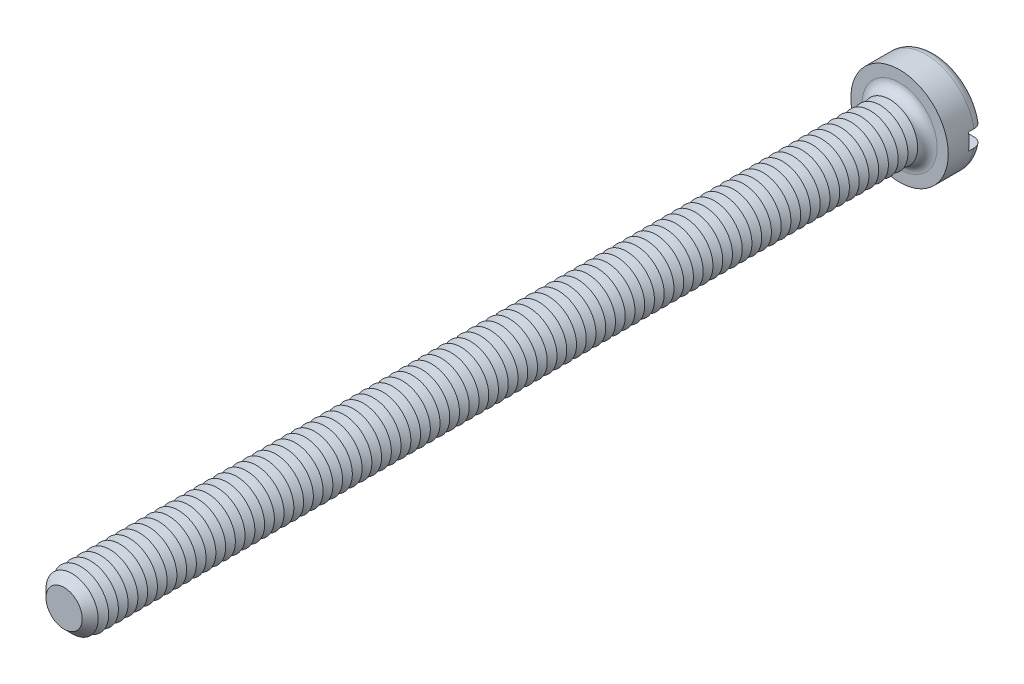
ISO-10303-21;
HEADER;
FILE_DESCRIPTION(('STEP AP214'),'2;1');
FILE_NAME('part.step','',(''),(''),'','','');
FILE_SCHEMA(('AUTOMOTIVE_DESIGN { 1 0 10303 214 1 1 1 1 }'));
ENDSEC;
DATA;
#1=APPLICATION_CONTEXT('core data for automotive mechanical design processes');
#2=APPLICATION_PROTOCOL_DEFINITION('international standard','automotive_design',2000,#1);
#3=PRODUCT_CONTEXT('',#1,'mechanical');
#4=PRODUCT('Part','Part','',(#3));
#5=PRODUCT_RELATED_PRODUCT_CATEGORY('part','',(#4));
#6=PRODUCT_DEFINITION_FORMATION('','',#4);
#7=PRODUCT_DEFINITION_CONTEXT('part definition',#1,'design');
#8=PRODUCT_DEFINITION('design','',#6,#7);
#9=PRODUCT_DEFINITION_SHAPE('','',#8);
#10=(LENGTH_UNIT() NAMED_UNIT(*) SI_UNIT(.MILLI.,.METRE.));
#11=(NAMED_UNIT(*) PLANE_ANGLE_UNIT() SI_UNIT($,.RADIAN.));
#12=(NAMED_UNIT(*) SI_UNIT($,.STERADIAN.) SOLID_ANGLE_UNIT());
#13=UNCERTAINTY_MEASURE_WITH_UNIT(LENGTH_MEASURE(1.E-05),#10,'distance_accuracy_value','');
#14=(GEOMETRIC_REPRESENTATION_CONTEXT(3) GLOBAL_UNCERTAINTY_ASSIGNED_CONTEXT((#13)) GLOBAL_UNIT_ASSIGNED_CONTEXT((#10,
#11,#12)) REPRESENTATION_CONTEXT('',''));
#15=CARTESIAN_POINT('',(0.,0.,0.));
#16=DIRECTION('',(0.,0.,1.));
#17=DIRECTION('',(1.,0.,0.));
#18=AXIS2_PLACEMENT_3D('',#15,#16,#17);
#19=CARTESIAN_POINT('',(0.,0.,-2.6));
#20=DIRECTION('',(0.,0.,1.));
#21=DIRECTION('',(1.,0.,0.));
#22=AXIS2_PLACEMENT_3D('',#19,#20,#21);
#23=PLANE('',#22);
#24=CARTESIAN_POINT('',(0.,0.,-2.6));
#25=DIRECTION('',(0.,0.,1.));
#26=DIRECTION('',(1.,0.,0.));
#27=AXIS2_PLACEMENT_3D('',#24,#25,#26);
#28=CIRCLE('',#27,2.8);
#29=CARTESIAN_POINT('',(-2.73495886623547,0.6,-2.6));
#30=VERTEX_POINT('',#29);
#31=CARTESIAN_POINT('',(2.73495886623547,0.6,-2.6));
#32=VERTEX_POINT('',#31);
#33=EDGE_CURVE('E116',#30,#32,#28,.F.);
#34=ORIENTED_EDGE('',*,*,#33,.T.);
#35=DIRECTION('',(1.,0.,0.));
#36=VECTOR('',#35,1.);
#37=CARTESIAN_POINT('',(-3.5,0.600000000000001,-2.6));
#38=LINE('',#37,#36);
#39=EDGE_CURVE('E111',#30,#32,#38,.T.);
#40=ORIENTED_EDGE('',*,*,#39,.F.);
#41=EDGE_LOOP('',(#34,#40));
#42=FACE_BOUND('',#41,.T.);
#43=ADVANCED_FACE('F39',(#42),#23,.F.);
#44=CARTESIAN_POINT('',(0.,0.,-1.9));
#45=DIRECTION('',(0.,0.,1.));
#46=DIRECTION('',(1.,0.,0.));
#47=AXIS2_PLACEMENT_3D('',#44,#45,#46);
#48=TOROIDAL_SURFACE('',#47,2.8,0.7);
#49=CARTESIAN_POINT('',(-3.24550494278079,0.600000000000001,-2.38938679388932));
#50=CARTESIAN_POINT('',(-3.21724139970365,0.600000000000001,-2.41780774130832));
#51=CARTESIAN_POINT('',(-3.18652103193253,0.600000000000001,-2.44383169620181));
#52=CARTESIAN_POINT('',(-3.12110229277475,0.600000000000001,-2.49034599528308));
#53=CARTESIAN_POINT('',(-3.08639834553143,0.6,-2.51082844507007));
#54=CARTESIAN_POINT('',(-3.01410013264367,0.6,-2.54568075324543));
#55=CARTESIAN_POINT('',(-2.97650963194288,0.6,-2.56005841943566));
#56=CARTESIAN_POINT('',(-2.89948250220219,0.6,-2.58239238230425));
#57=CARTESIAN_POINT('',(-2.86004633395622,0.6,-2.59035027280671));
#58=CARTESIAN_POINT('',(-2.77983715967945,0.6,-2.5997577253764));
#59=CARTESIAN_POINT('',(-2.73905311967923,0.6,-2.60111317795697));
#60=CARTESIAN_POINT('',(-2.65781876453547,0.6,-2.59706866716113));
#61=CARTESIAN_POINT('',(-2.61736849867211,0.6,-2.59166772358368));
#62=CARTESIAN_POINT('',(-2.53729983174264,0.6,-2.57414594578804));
#63=CARTESIAN_POINT('',(-2.49770360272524,0.6,-2.56192363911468));
#64=CARTESIAN_POINT('',(-2.421111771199,0.6,-2.5310238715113));
#65=CARTESIAN_POINT('',(-2.38411632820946,0.6,-2.51234601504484));
#66=CARTESIAN_POINT('',(-2.31371213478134,0.6,-2.46896762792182));
#67=CARTESIAN_POINT('',(-2.28031240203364,0.6,-2.44425244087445));
#68=CARTESIAN_POINT('',(-2.21823311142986,0.6,-2.38946667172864));
#69=CARTESIAN_POINT('',(-2.18955321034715,0.6,-2.35939647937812));
#70=CARTESIAN_POINT('',(-2.13836074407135,0.6,-2.29532787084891));
#71=CARTESIAN_POINT('',(-2.11574147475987,0.6,-2.26141482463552));
#72=CARTESIAN_POINT('',(-2.07677080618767,0.6,-2.19015935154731));
#73=CARTESIAN_POINT('',(-2.06041784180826,0.6,-2.15281778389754));
#74=CARTESIAN_POINT('',(-2.03508596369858,0.6,-2.07723332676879));
#75=CARTESIAN_POINT('',(-2.02585871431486,0.6,-2.03907365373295));
#76=CARTESIAN_POINT('',(-2.01416722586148,0.6,-1.96173417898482));
#77=CARTESIAN_POINT('',(-2.01170151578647,0.6,-1.92255460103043));
#78=CARTESIAN_POINT('',(-2.01359934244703,0.6,-1.84555709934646));
#79=CARTESIAN_POINT('',(-2.01775787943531,0.6,-1.80773393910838));
#80=CARTESIAN_POINT('',(-2.03236373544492,0.6,-1.73332511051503));
#81=CARTESIAN_POINT('',(-2.04281097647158,0.6,-1.69673942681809));
#82=CARTESIAN_POINT('',(-2.06962963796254,0.6,-1.62577336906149));
#83=CARTESIAN_POINT('',(-2.08600685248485,0.6,-1.59139519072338));
#84=CARTESIAN_POINT('',(-2.12413495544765,0.6,-1.52576356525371));
#85=CARTESIAN_POINT('',(-2.14588657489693,0.6,-1.49451054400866));
#86=CARTESIAN_POINT('',(-2.19483541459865,0.6,-1.43498643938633));
#87=CARTESIAN_POINT('',(-2.22217844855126,0.6,-1.40683532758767));
#88=CARTESIAN_POINT('',(-2.28105616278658,0.6,-1.35532544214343));
#89=CARTESIAN_POINT('',(-2.3125916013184,0.6,-1.33196753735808));
#90=CARTESIAN_POINT('',(-2.38018779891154,0.6,-1.28984356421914));
#91=CARTESIAN_POINT('',(-2.41637068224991,0.6,-1.27127330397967));
#92=CARTESIAN_POINT('',(-2.49129688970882,0.6,-1.24032971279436));
#93=CARTESIAN_POINT('',(-2.53004053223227,0.6,-1.22795715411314));
#94=CARTESIAN_POINT('',(-2.6098393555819,0.6,-1.2095515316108));
#95=CARTESIAN_POINT('',(-2.65092550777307,0.6,-1.20365237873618));
#96=CARTESIAN_POINT('',(-2.7335069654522,0.6,-1.1988380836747));
#97=CARTESIAN_POINT('',(-2.7750022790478,0.6,-1.19992308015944));
#98=CARTESIAN_POINT('',(-2.85718851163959,0.6,-1.20909046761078));
#99=CARTESIAN_POINT('',(-2.8978799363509,0.6,-1.21716830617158));
#100=CARTESIAN_POINT('',(-2.97729176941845,0.6,-1.24014327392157));
#101=CARTESIAN_POINT('',(-3.01601231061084,0.6,-1.25503994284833));
#102=CARTESIAN_POINT('',(-3.08976822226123,0.6,-1.29101066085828));
#103=CARTESIAN_POINT('',(-3.12484927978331,0.600000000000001,-1.31199098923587));
#104=CARTESIAN_POINT('',(-3.19090022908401,0.600000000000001,-1.35965144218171));
#105=CARTESIAN_POINT('',(-3.22187053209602,0.600000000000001,-1.38633099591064));
#106=CARTESIAN_POINT('',(-3.2781946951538,0.600000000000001,-1.44408564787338));
#107=CARTESIAN_POINT('',(-3.3036441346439,0.600000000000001,-1.47506754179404));
#108=CARTESIAN_POINT('',(-3.34887649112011,0.600000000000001,-1.54092398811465));
#109=CARTESIAN_POINT('',(-3.36865993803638,0.600000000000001,-1.57579817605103));
#110=CARTESIAN_POINT('',(-3.40166738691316,0.600000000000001,-1.64783067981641));
#111=CARTESIAN_POINT('',(-3.41499360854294,0.600000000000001,-1.68494217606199));
#112=CARTESIAN_POINT('',(-3.43515375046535,0.600000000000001,-1.76088675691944));
#113=CARTESIAN_POINT('',(-3.44198836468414,0.600000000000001,-1.79971965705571));
#114=CARTESIAN_POINT('',(-3.44891916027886,0.600000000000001,-1.87757893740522));
#115=CARTESIAN_POINT('',(-3.44908375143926,0.600000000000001,-1.91659924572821));
#116=CARTESIAN_POINT('',(-3.44284111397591,0.600000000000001,-1.99412088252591));
#117=CARTESIAN_POINT('',(-3.43643236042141,0.600000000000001,-2.03262208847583));
#118=CARTESIAN_POINT('',(-3.41725803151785,0.600000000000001,-2.10792315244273));
#119=CARTESIAN_POINT('',(-3.40450469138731,0.600000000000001,-2.14472613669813));
#120=CARTESIAN_POINT('',(-3.3730385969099,0.600000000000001,-2.21565060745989));
#121=CARTESIAN_POINT('',(-3.35433321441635,0.600000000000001,-2.24977534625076));
#122=CARTESIAN_POINT('',(-3.3201892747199,0.600000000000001,-2.30136364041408));
#123=CARTESIAN_POINT('',(-3.30647805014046,0.600000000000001,-2.31999402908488));
#124=CARTESIAN_POINT('',(-3.27728518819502,0.600000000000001,-2.35581090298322));
#125=CARTESIAN_POINT('',(-3.26180356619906,0.600000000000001,-2.37299740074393));
#126=CARTESIAN_POINT('',(-3.24550494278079,0.600000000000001,-2.38938679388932));
#127=B_SPLINE_CURVE_WITH_KNOTS('',3,(#49,#50,#51,#52,#53,#54,#55,#56,#57,#58,#59,#60,#61,#62,
#63,#64,#65,#66,#67,#68,#69,#70,#71,#72,#73,#74,#75,#76,#77,#78,#79,#80,#81,#82,#83,#84,#85,#86,
#87,#88,#89,#90,#91,#92,#93,#94,#95,#96,#97,#98,#99,#100,#101,#102,#103,#104,#105,#106,#107,
#108,#109,#110,#111,#112,#113,#114,#115,#116,#117,#118,#119,#120,#121,#122,#123,#124,#125,#126),
.UNSPECIFIED.,.T.,.F.,(4,2,2,2,2,2,2,2,2,2,2,2,2,2,2,2,2,2,2,2,2,2,2,2,2,2,2,2,2,2,2,2,2,2,2,2,
2,2,4),(0.,0.120160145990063,0.240490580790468,0.36066665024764,0.480812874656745,
0.602666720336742,0.724538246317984,0.848272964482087,0.972015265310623,1.09606100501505,
1.2200977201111,1.34178071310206,1.46343329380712,1.58062647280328,1.6977941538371,
1.81140573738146,1.92501591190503,2.03873739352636,2.15247435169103,2.26967910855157,
2.38690509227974,2.50835551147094,2.62982106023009,2.75375450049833,2.87769040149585,
3.00154567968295,3.12539259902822,3.24742469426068,3.36944457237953,3.48914477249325,
3.60883377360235,3.72656056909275,3.84427477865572,3.96078136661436,4.07731498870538,
4.19362474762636,4.3097910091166,4.37908387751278,4.44837614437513),.UNSPECIFIED.);
#128=CARTESIAN_POINT('',(-3.44818792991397,0.600000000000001,-1.8999999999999));
#129=VERTEX_POINT('',#128);
#130=EDGE_CURVE('E857',#129,#30,#127,.T.);
#131=ORIENTED_EDGE('',*,*,#130,.F.);
#132=CARTESIAN_POINT('',(0.,0.,-1.9));
#133=DIRECTION('',(0.,0.,1.));
#134=DIRECTION('',(1.,0.,0.));
#135=AXIS2_PLACEMENT_3D('',#132,#133,#134);
#136=CIRCLE('',#135,3.5);
#137=CARTESIAN_POINT('',(3.44818792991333,0.6,-1.9));
#138=VERTEX_POINT('',#137);
#139=EDGE_CURVE('E125',#138,#129,#136,.T.);
#140=ORIENTED_EDGE('',*,*,#139,.F.);
#141=CARTESIAN_POINT('',(2.1414268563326,0.6,-2.29762171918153));
#142=CARTESIAN_POINT('',(2.16505443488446,0.6,-2.33058245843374));
#143=CARTESIAN_POINT('',(2.19155609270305,0.6,-2.36152717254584));
#144=CARTESIAN_POINT('',(2.24942944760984,0.6,-2.41852964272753));
#145=CARTESIAN_POINT('',(2.28080921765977,0.6,-2.44457913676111));
#146=CARTESIAN_POINT('',(2.34741203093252,0.6,-2.49105381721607));
#147=CARTESIAN_POINT('',(2.38262862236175,0.6,-2.51148824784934));
#148=CARTESIAN_POINT('',(2.45593176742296,0.6,-2.54626881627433));
#149=CARTESIAN_POINT('',(2.49401741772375,0.6,-2.56061686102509));
#150=CARTESIAN_POINT('',(2.57272605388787,0.6,-2.58306429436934));
#151=CARTESIAN_POINT('',(2.6133821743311,0.6,-2.59104769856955));
#152=CARTESIAN_POINT('',(2.6954618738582,0.6,-2.60009608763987));
#153=CARTESIAN_POINT('',(2.73688552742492,0.6,-2.60116039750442));
#154=CARTESIAN_POINT('',(2.81941950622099,0.6,-2.5962925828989));
#155=CARTESIAN_POINT('',(2.86052888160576,0.6,-2.59034422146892));
#156=CARTESIAN_POINT('',(2.94113709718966,0.6,-2.57153687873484));
#157=CARTESIAN_POINT('',(2.98063603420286,0.6,-2.55867831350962));
#158=CARTESIAN_POINT('',(3.05633735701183,0.6,-2.52657771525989));
#159=CARTESIAN_POINT('',(3.09257627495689,0.6,-2.50742188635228));
#160=CARTESIAN_POINT('',(3.16123898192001,0.6,-2.46318606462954));
#161=CARTESIAN_POINT('',(3.19366316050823,0.6,-2.4381066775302));
#162=CARTESIAN_POINT('',(3.25312278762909,0.6,-2.38324481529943));
#163=CARTESIAN_POINT('',(3.28024842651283,0.6,-2.35356008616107));
#164=CARTESIAN_POINT('',(3.32902587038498,0.6,-2.28998971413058));
#165=CARTESIAN_POINT('',(3.35067820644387,0.6,-2.25610447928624));
#166=CARTESIAN_POINT('',(3.38751207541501,0.6,-2.18572286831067));
#167=CARTESIAN_POINT('',(3.40279804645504,0.6,-2.14928112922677));
#168=CARTESIAN_POINT('',(3.42695590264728,0.6,-2.07433042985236));
#169=CARTESIAN_POINT('',(3.43582824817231,0.6,-2.03582161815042));
#170=CARTESIAN_POINT('',(3.44682113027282,0.6,-1.95829536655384));
#171=CARTESIAN_POINT('',(3.44901648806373,0.6,-1.91928851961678));
#172=CARTESIAN_POINT('',(3.44680085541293,0.6,-1.84146366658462));
#173=CARTESIAN_POINT('',(3.44239008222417,0.6,-1.80264565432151));
#174=CARTESIAN_POINT('',(3.42712544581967,0.6,-1.72644634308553));
#175=CARTESIAN_POINT('',(3.41629508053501,0.6,-1.6890603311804));
#176=CARTESIAN_POINT('',(3.38853757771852,0.6,-1.61662604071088));
#177=CARTESIAN_POINT('',(3.37161039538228,0.6,-1.58157777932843));
#178=CARTESIAN_POINT('',(3.33207798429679,0.6,-1.51464178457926));
#179=CARTESIAN_POINT('',(3.30944854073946,0.6,-1.48276835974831));
#180=CARTESIAN_POINT('',(3.2592165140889,0.6,-1.42321861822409));
#181=CARTESIAN_POINT('',(3.23161370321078,0.6,-1.3955424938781));
#182=CARTESIAN_POINT('',(3.17188519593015,0.6,-1.34481834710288));
#183=CARTESIAN_POINT('',(3.13971065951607,0.6,-1.32182785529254));
#184=CARTESIAN_POINT('',(3.07201123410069,0.6,-1.28147003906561));
#185=CARTESIAN_POINT('',(3.03648608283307,0.6,-1.26410315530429));
#186=CARTESIAN_POINT('',(2.962449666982,0.6,-1.2351645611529));
#187=CARTESIAN_POINT('',(2.92389781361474,0.6,-1.22369671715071));
#188=CARTESIAN_POINT('',(2.84543273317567,0.6,-1.20726565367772));
#189=CARTESIAN_POINT('',(2.80551936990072,0.6,-1.20230308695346));
#190=CARTESIAN_POINT('',(2.72467191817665,0.6,-1.1989357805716));
#191=CARTESIAN_POINT('',(2.68373266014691,0.6,-1.20065484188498));
#192=CARTESIAN_POINT('',(2.60270222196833,0.6,-1.21084560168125));
#193=CARTESIAN_POINT('',(2.56261112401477,0.6,-1.21931795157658));
#194=CARTESIAN_POINT('',(2.48385954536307,0.6,-1.24292934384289));
#195=CARTESIAN_POINT('',(2.44522508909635,0.6,-1.25815531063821));
#196=CARTESIAN_POINT('',(2.37106165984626,0.6,-1.29488663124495));
#197=CARTESIAN_POINT('',(2.33553282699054,0.6,-1.31639226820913));
#198=CARTESIAN_POINT('',(2.2686996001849,0.6,-1.36507949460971));
#199=CARTESIAN_POINT('',(2.23738745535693,0.6,-1.39225042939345));
#200=CARTESIAN_POINT('',(2.17990424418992,0.6,-1.45157941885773));
#201=CARTESIAN_POINT('',(2.15373259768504,0.6,-1.48373691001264));
#202=CARTESIAN_POINT('',(2.10799355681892,0.6,-1.551327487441));
#203=CARTESIAN_POINT('',(2.08828258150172,0.6,-1.58666329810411));
#204=CARTESIAN_POINT('',(2.05534440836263,0.6,-1.66023600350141));
#205=CARTESIAN_POINT('',(2.042115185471,0.6,-1.6984719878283));
#206=CARTESIAN_POINT('',(2.02303126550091,0.6,-1.77519783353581));
#207=CARTESIAN_POINT('',(2.01691541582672,0.6,-1.8136228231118));
#208=CARTESIAN_POINT('',(2.01140375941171,0.6,-1.89096056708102));
#209=CARTESIAN_POINT('',(2.01200856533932,0.6,-1.92987336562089));
#210=CARTESIAN_POINT('',(2.01981617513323,0.6,-2.006065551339));
#211=CARTESIAN_POINT('',(2.02685835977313,0.6,-2.04336165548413));
#212=CARTESIAN_POINT('',(2.0470502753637,0.6,-2.1162250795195));
#213=CARTESIAN_POINT('',(2.06019252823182,0.6,-2.15179445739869));
#214=CARTESIAN_POINT('',(2.08525738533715,0.6,-2.20558874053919));
#215=CARTESIAN_POINT('',(2.09529161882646,0.6,-2.22471751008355));
#216=CARTESIAN_POINT('',(2.11708813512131,0.6,-2.26196179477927));
#217=CARTESIAN_POINT('',(2.12885034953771,0.6,-2.28007734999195));
#218=CARTESIAN_POINT('',(2.1414268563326,0.6,-2.29762171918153));
#219=B_SPLINE_CURVE_WITH_KNOTS('',3,(#141,#142,#143,#144,#145,#146,#147,#148,#149,#150,#151,
#152,#153,#154,#155,#156,#157,#158,#159,#160,#161,#162,#163,#164,#165,#166,#167,#168,#169,#170,
#171,#172,#173,#174,#175,#176,#177,#178,#179,#180,#181,#182,#183,#184,#185,#186,#187,#188,#189,
#190,#191,#192,#193,#194,#195,#196,#197,#198,#199,#200,#201,#202,#203,#204,#205,#206,#207,#208,
#209,#210,#211,#212,#213,#214,#215,#216,#217,#218),.UNSPECIFIED.,.T.,.F.,(4,2,2,2,2,2,2,2,2,2,2,
2,2,2,2,2,2,2,2,2,2,2,2,2,2,2,2,2,2,2,2,2,2,2,2,2,2,2,4),(0.,0.121582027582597,
0.243367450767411,0.364951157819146,0.486496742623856,0.610209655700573,0.733934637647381,
0.857946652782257,0.981951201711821,1.1043243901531,1.22668507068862,1.34673532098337,
1.46677391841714,1.58475736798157,1.70273234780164,1.81938035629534,1.93602452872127,
2.05224435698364,2.168465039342,2.28518782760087,2.40191596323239,2.52000081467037,
2.63809491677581,2.75820270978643,2.87832255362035,3.00067856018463,3.1230463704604,
3.24703703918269,3.37103329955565,3.49479843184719,3.6185495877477,3.73932715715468,
3.86006696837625,3.9762182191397,4.09238005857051,4.2057203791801,4.31892212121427,
4.38364046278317,4.44835624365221),.UNSPECIFIED.);
#220=EDGE_CURVE('E859',#32,#138,#219,.T.);
#221=ORIENTED_EDGE('',*,*,#220,.F.);
#222=ORIENTED_EDGE('',*,*,#33,.F.);
#223=EDGE_LOOP('',(#131,#140,#221,#222));
#224=FACE_BOUND('',#223,.T.);
#225=ADVANCED_FACE('F841',(#224),#48,.T.);
#226=CARTESIAN_POINT('',(0.,0.,-2.6));
#227=DIRECTION('',(0.,0.,1.));
#228=DIRECTION('',(1.,0.,0.));
#229=AXIS2_PLACEMENT_3D('',#226,#227,#228);
#230=CYLINDRICAL_SURFACE('',#229,3.5);
#231=DIRECTION('',(0.,0.,1.));
#232=VECTOR('',#231,1.);
#233=CARTESIAN_POINT('',(3.44818792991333,0.6,-2.6));
#234=LINE('',#233,#232);
#235=CARTESIAN_POINT('',(3.44818792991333,0.6,-1.5));
#236=VERTEX_POINT('',#235);
#237=EDGE_CURVE('E874',#138,#236,#234,.T.);
#238=ORIENTED_EDGE('',*,*,#237,.F.);
#239=ORIENTED_EDGE('',*,*,#139,.T.);
#240=DIRECTION('',(0.,0.,1.));
#241=VECTOR('',#240,1.);
#242=CARTESIAN_POINT('',(-3.44818792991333,0.600000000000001,-2.6));
#243=LINE('',#242,#241);
#244=CARTESIAN_POINT('',(-3.44818792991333,0.600000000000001,-1.5));
#245=VERTEX_POINT('',#244);
#246=EDGE_CURVE('E63',#245,#129,#243,.F.);
#247=ORIENTED_EDGE('',*,*,#246,.F.);
#248=CARTESIAN_POINT('',(0.,0.,-1.5));
#249=DIRECTION('',(0.,0.,-1.));
#250=DIRECTION('',(-1.,0.,0.));
#251=AXIS2_PLACEMENT_3D('',#248,#249,#250);
#252=CIRCLE('',#251,3.5);
#253=CARTESIAN_POINT('',(-3.44818792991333,-0.599999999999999,-1.5));
#254=VERTEX_POINT('',#253);
#255=EDGE_CURVE('E43',#245,#254,#252,.F.);
#256=ORIENTED_EDGE('',*,*,#255,.T.);
#257=DIRECTION('',(0.,0.,1.));
#258=VECTOR('',#257,1.);
#259=CARTESIAN_POINT('',(-3.44818792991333,-0.599999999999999,-2.6));
#260=LINE('',#259,#258);
#261=CARTESIAN_POINT('',(-3.44818792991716,-0.599999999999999,-1.90000000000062));
#262=VERTEX_POINT('',#261);
#263=EDGE_CURVE('E871',#262,#254,#260,.T.);
#264=ORIENTED_EDGE('',*,*,#263,.F.);
#265=CARTESIAN_POINT('',(3.44818792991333,-0.6,-1.9));
#266=VERTEX_POINT('',#265);
#267=EDGE_CURVE('E127',#262,#266,#136,.T.);
#268=ORIENTED_EDGE('',*,*,#267,.T.);
#269=DIRECTION('',(0.,0.,1.));
#270=VECTOR('',#269,1.);
#271=CARTESIAN_POINT('',(3.44818792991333,-0.6,-2.6));
#272=LINE('',#271,#270);
#273=CARTESIAN_POINT('',(3.44818792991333,-0.6,-1.5));
#274=VERTEX_POINT('',#273);
#275=EDGE_CURVE('E55',#274,#266,#272,.F.);
#276=ORIENTED_EDGE('',*,*,#275,.F.);
#277=EDGE_CURVE('E11',#274,#236,#252,.F.);
#278=ORIENTED_EDGE('',*,*,#277,.T.);
#279=EDGE_LOOP('',(#238,#239,#247,#256,#264,#268,#276,#278));
#280=FACE_BOUND('',#279,.T.);
#281=CARTESIAN_POINT('',(0.,0.,0.));
#282=DIRECTION('',(0.,0.,1.));
#283=DIRECTION('',(1.,0.,0.));
#284=AXIS2_PLACEMENT_3D('',#281,#282,#283);
#285=CIRCLE('',#284,3.5);
#286=CARTESIAN_POINT('',(3.5,0.,0.));
#287=VERTEX_POINT('',#286);
#288=EDGE_CURVE('E877',#287,#287,#285,.T.);
#289=ORIENTED_EDGE('',*,*,#288,.F.);
#290=EDGE_LOOP('',(#289));
#291=FACE_BOUND('',#290,.T.);
#292=ADVANCED_FACE('F837',(#280,#291),#230,.T.);
#293=CARTESIAN_POINT('',(2.73495886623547,-0.6,-2.6));
#294=VERTEX_POINT('',#293);
#295=CARTESIAN_POINT('',(-2.73495886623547,-0.6,-2.6));
#296=VERTEX_POINT('',#295);
#297=EDGE_CURVE('E109',#294,#296,#28,.F.);
#298=ORIENTED_EDGE('',*,*,#297,.T.);
#299=DIRECTION('',(-1.,0.,0.));
#300=VECTOR('',#299,1.);
#301=CARTESIAN_POINT('',(-3.5,-0.599999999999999,-2.6));
#302=LINE('',#301,#300);
#303=EDGE_CURVE('E96',#294,#296,#302,.T.);
#304=ORIENTED_EDGE('',*,*,#303,.F.);
#305=EDGE_LOOP('',(#298,#304));
#306=FACE_BOUND('',#305,.T.);
#307=ADVANCED_FACE('F108',(#306),#23,.F.);
#308=CARTESIAN_POINT('',(0.,0.,0.));
#309=DIRECTION('',(0.,0.,1.));
#310=DIRECTION('',(1.,0.,0.));
#311=AXIS2_PLACEMENT_3D('',#308,#309,#310);
#312=PLANE('',#311);
#313=CARTESIAN_POINT('',(0.,0.,0.));
#314=DIRECTION('',(0.,0.,1.));
#315=DIRECTION('',(1.,0.,0.));
#316=AXIS2_PLACEMENT_3D('',#313,#314,#315);
#317=CIRCLE('',#316,2.7);
#318=CARTESIAN_POINT('',(2.7,0.,0.));
#319=VERTEX_POINT('',#318);
#320=EDGE_CURVE('E115',#319,#319,#317,.F.);
#321=ORIENTED_EDGE('',*,*,#320,.T.);
#322=EDGE_LOOP('',(#321));
#323=FACE_BOUND('',#322,.T.);
#324=ORIENTED_EDGE('',*,*,#288,.T.);
#325=EDGE_LOOP('',(#324));
#326=FACE_BOUND('',#325,.T.);
#327=ADVANCED_FACE('F836',(#323,#326),#312,.T.);
#328=CARTESIAN_POINT('',(-3.24550494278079,-0.599999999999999,-2.38938679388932));
#329=CARTESIAN_POINT('',(-3.27309693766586,-0.599999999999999,-2.36163611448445));
#330=CARTESIAN_POINT('',(-3.29838741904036,-0.599999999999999,-2.3315608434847));
#331=CARTESIAN_POINT('',(-3.34359429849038,-0.599999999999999,-2.26757659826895));
#332=CARTESIAN_POINT('',(-3.36350518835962,-0.599999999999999,-2.23366374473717));
#333=CARTESIAN_POINT('',(-3.39733065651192,-0.599999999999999,-2.16296274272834));
#334=CARTESIAN_POINT('',(-3.4112451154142,-0.599999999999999,-2.12617453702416));
#335=CARTESIAN_POINT('',(-3.43264462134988,-0.599999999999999,-2.05078178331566));
#336=CARTESIAN_POINT('',(-3.44013114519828,-0.599999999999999,-2.01217765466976));
#337=CARTESIAN_POINT('',(-3.44841975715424,-0.599999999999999,-1.9345391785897));
#338=CARTESIAN_POINT('',(-3.44926944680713,-0.599999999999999,-1.89550990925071));
#339=CARTESIAN_POINT('',(-3.44438358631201,-0.599999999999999,-1.81786552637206));
#340=CARTESIAN_POINT('',(-3.43864801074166,-0.599999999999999,-1.77925041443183));
#341=CARTESIAN_POINT('',(-3.42079221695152,-0.599999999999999,-1.70364264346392));
#342=CARTESIAN_POINT('',(-3.40869011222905,-0.599999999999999,-1.66664570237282));
#343=CARTESIAN_POINT('',(-3.37847692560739,-0.599999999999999,-1.59519424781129));
#344=CARTESIAN_POINT('',(-3.3603657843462,-0.599999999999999,-1.56073975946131));
#345=CARTESIAN_POINT('',(-3.31856549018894,-0.599999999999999,-1.4951524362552));
#346=CARTESIAN_POINT('',(-3.29484830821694,-0.599999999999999,-1.46403747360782));
#347=CARTESIAN_POINT('',(-3.24258489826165,-0.599999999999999,-1.40617131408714));
#348=CARTESIAN_POINT('',(-3.21403843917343,-0.599999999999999,-1.37942032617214));
#349=CARTESIAN_POINT('',(-3.15256084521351,-0.599999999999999,-1.33067963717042));
#350=CARTESIAN_POINT('',(-3.11958015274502,-0.599999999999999,-1.30875246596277));
#351=CARTESIAN_POINT('',(-3.0504559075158,-0.599999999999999,-1.27063718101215));
#352=CARTESIAN_POINT('',(-3.01431209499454,-0.6,-1.25444953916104));
#353=CARTESIAN_POINT('',(-2.93921710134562,-0.6,-1.22796796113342));
#354=CARTESIAN_POINT('',(-2.90022796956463,-0.6,-1.217781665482));
#355=CARTESIAN_POINT('',(-2.82110512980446,-0.6,-1.20396915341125));
#356=CARTESIAN_POINT('',(-2.7809713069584,-0.6,-1.2003435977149));
#357=CARTESIAN_POINT('',(-2.69990924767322,-0.6,-1.19969717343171));
#358=CARTESIAN_POINT('',(-2.65898001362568,-0.6,-1.20279937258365));
#359=CARTESIAN_POINT('',(-2.57819986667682,-0.6,-1.21574287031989));
#360=CARTESIAN_POINT('',(-2.53834905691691,-0.6,-1.22558481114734));
#361=CARTESIAN_POINT('',(-2.46035232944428,-0.6,-1.25189361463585));
#362=CARTESIAN_POINT('',(-2.42223314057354,-0.6,-1.2684398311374));
#363=CARTESIAN_POINT('',(-2.34932316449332,-0.6,-1.30771928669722));
#364=CARTESIAN_POINT('',(-2.31453248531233,-0.6,-1.33045272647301));
#365=CARTESIAN_POINT('',(-2.24945577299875,-0.6,-1.38141543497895));
#366=CARTESIAN_POINT('',(-2.21915255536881,-0.6,-1.40962272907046));
#367=CARTESIAN_POINT('',(-2.16386461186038,-0.6,-1.47084552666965));
#368=CARTESIAN_POINT('',(-2.13887916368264,-0.6,-1.50386037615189));
#369=CARTESIAN_POINT('',(-2.09568071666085,-0.6,-1.57285917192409));
#370=CARTESIAN_POINT('',(-2.07730739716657,-0.6,-1.60874263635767));
#371=CARTESIAN_POINT('',(-2.04712019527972,-0.6,-1.68316975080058));
#372=CARTESIAN_POINT('',(-2.03530452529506,-0.6,-1.72171267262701));
#373=CARTESIAN_POINT('',(-2.01901751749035,-0.6,-1.79878952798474));
#374=CARTESIAN_POINT('',(-2.01428434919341,-0.6,-1.8372682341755));
#375=CARTESIAN_POINT('',(-2.01150652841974,-0.6,-1.91446369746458));
#376=CARTESIAN_POINT('',(-2.01346084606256,-0.6,-1.95318041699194));
#377=CARTESIAN_POINT('',(-2.02386268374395,-0.6,-2.0288619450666));
#378=CARTESIAN_POINT('',(-2.03216724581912,-0.6,-2.06584654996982));
#379=CARTESIAN_POINT('',(-2.05479337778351,-0.6,-2.13792373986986));
#380=CARTESIAN_POINT('',(-2.06911522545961,-0.6,-2.1730162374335));
#381=CARTESIAN_POINT('',(-2.10349906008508,-0.6,-2.24081034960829));
#382=CARTESIAN_POINT('',(-2.12363007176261,-0.6,-2.27347689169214));
#383=CARTESIAN_POINT('',(-2.16891308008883,-0.6,-2.33511902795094));
#384=CARTESIAN_POINT('',(-2.19406590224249,-0.6,-2.36409401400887));
#385=CARTESIAN_POINT('',(-2.24962389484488,-0.6,-2.41861972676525));
#386=CARTESIAN_POINT('',(-2.28018314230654,-0.6,-2.44401345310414));
#387=CARTESIAN_POINT('',(-2.34501720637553,-0.6,-2.48950558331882));
#388=CARTESIAN_POINT('',(-2.37929266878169,-0.6,-2.50960306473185));
#389=CARTESIAN_POINT('',(-2.45179417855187,-0.6,-2.54458276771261));
#390=CARTESIAN_POINT('',(-2.49011248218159,-0.6,-2.55927401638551));
#391=CARTESIAN_POINT('',(-2.56865227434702,-0.6,-2.58211133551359));
#392=CARTESIAN_POINT('',(-2.60887386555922,-0.6,-2.59025705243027));
#393=CARTESIAN_POINT('',(-2.69064746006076,-0.6,-2.59982905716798));
#394=CARTESIAN_POINT('',(-2.73220999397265,-0.6,-2.60116580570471));
#395=CARTESIAN_POINT('',(-2.81497658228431,-0.6,-2.59679700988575));
#396=CARTESIAN_POINT('',(-2.85618055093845,-0.6,-2.59108982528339));
#397=CARTESIAN_POINT('',(-2.93677683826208,-0.6,-2.57279487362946));
#398=CARTESIAN_POINT('',(-2.97617834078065,-0.6,-2.56024753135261));
#399=CARTESIAN_POINT('',(-3.05222242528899,-0.6,-2.52860709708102));
#400=CARTESIAN_POINT('',(-3.08886850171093,-0.599999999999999,-2.50952247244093));
#401=CARTESIAN_POINT('',(-3.14562501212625,-0.599999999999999,-2.47340693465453));
#402=CARTESIAN_POINT('',(-3.16689358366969,-0.599999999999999,-2.45816337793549));
#403=CARTESIAN_POINT('',(-3.20761866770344,-0.599999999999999,-2.42542115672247));
#404=CARTESIAN_POINT('',(-3.22707520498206,-0.599999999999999,-2.40792252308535));
#405=CARTESIAN_POINT('',(-3.24550494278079,-0.599999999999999,-2.38938679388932));
#406=B_SPLINE_CURVE_WITH_KNOTS('',3,(#328,#329,#330,#331,#332,#333,#334,#335,#336,#337,#338,
#339,#340,#341,#342,#343,#344,#345,#346,#347,#348,#349,#350,#351,#352,#353,#354,#355,#356,#357,
#358,#359,#360,#361,#362,#363,#364,#365,#366,#367,#368,#369,#370,#371,#372,#373,#374,#375,#376,
#377,#378,#379,#380,#381,#382,#383,#384,#385,#386,#387,#388,#389,#390,#391,#392,#393,#394,#395,
#396,#397,#398,#399,#400,#401,#402,#403,#404,#405),.UNSPECIFIED.,.T.,.F.,(4,2,2,2,2,2,2,2,2,2,2,
2,2,2,2,2,2,2,2,2,2,2,2,2,2,2,2,2,2,2,2,2,2,2,2,2,2,2,4),(0.,0.117306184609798,
0.234732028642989,0.352160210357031,0.469561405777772,0.586119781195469,0.702678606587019,
0.818907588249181,0.935137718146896,1.05196174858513,1.1687913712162,1.2870562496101,
1.40533084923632,1.52566688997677,1.64601504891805,1.76858322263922,1.89116307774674,
2.01523830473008,2.13931755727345,2.26290863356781,2.38648291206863,2.50681878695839,
2.62712184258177,2.74285697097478,2.85857427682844,2.97176054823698,3.08495204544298,
3.19954814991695,3.31416310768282,3.43282436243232,3.55150627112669,3.67404987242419,
3.79660009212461,3.92075778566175,4.04494439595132,4.16840490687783,4.29170610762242,
4.3700604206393,4.44841366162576),.UNSPECIFIED.);
#407=EDGE_CURVE('E103',#296,#262,#406,.T.);
#408=ORIENTED_EDGE('',*,*,#407,.F.);
#409=ORIENTED_EDGE('',*,*,#297,.F.);
#410=CARTESIAN_POINT('',(2.1414268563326,-0.6,-2.29762171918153));
#411=CARTESIAN_POINT('',(2.11900044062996,-0.6,-2.26633119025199));
#412=CARTESIAN_POINT('',(2.09913154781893,-0.6,-2.23318080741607));
#413=CARTESIAN_POINT('',(2.06517900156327,-0.6,-2.16401111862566));
#414=CARTESIAN_POINT('',(2.05109968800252,-0.6,-2.12798968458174));
#415=CARTESIAN_POINT('',(2.02923593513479,-0.6,-2.05404277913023));
#416=CARTESIAN_POINT('',(2.02145692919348,-0.6,-2.01611569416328));
#417=CARTESIAN_POINT('',(2.01251710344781,-0.6,-1.93949649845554));
#418=CARTESIAN_POINT('',(2.01135461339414,-0.6,-1.90080458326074));
#419=CARTESIAN_POINT('',(2.01564803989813,-0.6,-1.82450508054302));
#420=CARTESIAN_POINT('',(2.02098305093,-0.6,-1.78689061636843));
#421=CARTESIAN_POINT('',(2.03786826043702,-0.6,-1.71308589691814));
#422=CARTESIAN_POINT('',(2.04941870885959,-0.6,-1.67689569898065));
#423=CARTESIAN_POINT('',(2.07838664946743,-0.6,-1.60676639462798));
#424=CARTESIAN_POINT('',(2.09582944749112,-0.6,-1.57283776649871));
#425=CARTESIAN_POINT('',(2.1359925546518,-0.6,-1.50826612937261));
#426=CARTESIAN_POINT('',(2.15871360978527,-0.6,-1.47762358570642));
#427=CARTESIAN_POINT('',(2.20955413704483,-0.6,-1.41943384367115));
#428=CARTESIAN_POINT('',(2.23782364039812,-0.6,-1.39201777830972));
#429=CARTESIAN_POINT('',(2.29842612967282,-0.6,-1.34212199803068));
#430=CARTESIAN_POINT('',(2.33075984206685,-0.6,-1.31964316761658));
#431=CARTESIAN_POINT('',(2.399806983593,-0.6,-1.27945238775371));
#432=CARTESIAN_POINT('',(2.43663466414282,-0.6,-1.26193653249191));
#433=CARTESIAN_POINT('',(2.51267241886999,-0.6,-1.23320660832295));
#434=CARTESIAN_POINT('',(2.55188277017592,-0.6,-1.22199327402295));
#435=CARTESIAN_POINT('',(2.63235000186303,-0.6,-1.20602688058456));
#436=CARTESIAN_POINT('',(2.673631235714,-0.6,-1.20139617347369));
#437=CARTESIAN_POINT('',(2.7563863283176,-0.6,-1.19914622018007));
#438=CARTESIAN_POINT('',(2.79786018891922,-0.6,-1.20152704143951));
#439=CARTESIAN_POINT('',(2.87971192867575,-0.6,-1.21326884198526));
#440=CARTESIAN_POINT('',(2.92009214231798,-0.6,-1.22261349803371));
#441=CARTESIAN_POINT('',(2.99866777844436,-0.6,-1.24805614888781));
#442=CARTESIAN_POINT('',(3.03686335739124,-0.6,-1.26415365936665));
#443=CARTESIAN_POINT('',(3.10934738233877,-0.6,-1.3023912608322));
#444=CARTESIAN_POINT('',(3.14368704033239,-0.6,-1.32443423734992));
#445=CARTESIAN_POINT('',(3.20808395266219,-0.6,-1.37407725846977));
#446=CARTESIAN_POINT('',(3.23814164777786,-0.6,-1.40167673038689));
#447=CARTESIAN_POINT('',(3.29251534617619,-0.6,-1.46108303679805));
#448=CARTESIAN_POINT('',(3.3169296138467,-0.6,-1.49279994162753));
#449=CARTESIAN_POINT('',(3.35998418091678,-0.6,-1.55993706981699));
#450=CARTESIAN_POINT('',(3.37862502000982,-0.6,-1.59535694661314));
#451=CARTESIAN_POINT('',(3.40930212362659,-0.6,-1.668283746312));
#452=CARTESIAN_POINT('',(3.42143897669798,-0.6,-1.70574837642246));
#453=CARTESIAN_POINT('',(3.43918305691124,-0.6,-1.78219297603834));
#454=CARTESIAN_POINT('',(3.44479069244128,-0.6,-1.82117285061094));
#455=CARTESIAN_POINT('',(3.44928173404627,-0.6,-1.89914596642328));
#456=CARTESIAN_POINT('',(3.44822835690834,-0.6,-1.93813558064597));
#457=CARTESIAN_POINT('',(3.43957811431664,-0.6,-2.0153811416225));
#458=CARTESIAN_POINT('',(3.43198139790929,-0.6,-2.05363710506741));
#459=CARTESIAN_POINT('',(3.41049386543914,-0.6,-2.12826741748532));
#460=CARTESIAN_POINT('',(3.39661362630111,-0.6,-2.16464481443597));
#461=CARTESIAN_POINT('',(3.36297924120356,-0.6,-2.23457274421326));
#462=CARTESIAN_POINT('',(3.34322499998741,-0.6,-2.26812323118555));
#463=CARTESIAN_POINT('',(3.29828706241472,-0.6,-2.33167864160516));
#464=CARTESIAN_POINT('',(3.27307040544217,-0.6,-2.36166024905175));
#465=CARTESIAN_POINT('',(3.21802069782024,-0.6,-2.41703165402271));
#466=CARTESIAN_POINT('',(3.18818738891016,-0.6,-2.44242119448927));
#467=CARTESIAN_POINT('',(3.12433871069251,-0.6,-2.48825551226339));
#468=CARTESIAN_POINT('',(3.09027338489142,-0.6,-2.50863067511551));
#469=CARTESIAN_POINT('',(3.01925175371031,-0.6,-2.54348754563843));
#470=CARTESIAN_POINT('',(2.982295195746,-0.6,-2.55796873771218));
#471=CARTESIAN_POINT('',(2.90583499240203,-0.6,-2.58090526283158));
#472=CARTESIAN_POINT('',(2.86629758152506,-0.6,-2.58924801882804));
#473=CARTESIAN_POINT('',(2.78639041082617,-0.6,-2.59930573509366));
#474=CARTESIAN_POINT('',(2.7460205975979,-0.6,-2.60102026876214));
#475=CARTESIAN_POINT('',(2.66482039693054,-0.6,-2.59779078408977));
#476=CARTESIAN_POINT('',(2.62399477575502,-0.6,-2.59272651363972));
#477=CARTESIAN_POINT('',(2.54373809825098,-0.6,-2.57588976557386));
#478=CARTESIAN_POINT('',(2.50430750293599,-0.6,-2.56411509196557));
#479=CARTESIAN_POINT('',(2.42753167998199,-0.6,-2.53401488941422));
#480=CARTESIAN_POINT('',(2.39021407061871,-0.6,-2.51561892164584));
#481=CARTESIAN_POINT('',(2.31925431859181,-0.6,-2.4727929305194));
#482=CARTESIAN_POINT('',(2.28560806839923,-0.6,-2.44836975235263));
#483=CARTESIAN_POINT('',(2.23316677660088,-0.6,-2.40295212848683));
#484=CARTESIAN_POINT('',(2.21309339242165,-0.6,-2.38341311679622));
#485=CARTESIAN_POINT('',(2.17537212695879,-0.6,-2.34211733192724));
#486=CARTESIAN_POINT('',(2.1577241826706,-0.6,-2.32036061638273));
#487=CARTESIAN_POINT('',(2.1414268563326,-0.6,-2.29762171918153));
#488=B_SPLINE_CURVE_WITH_KNOTS('',3,(#410,#411,#412,#413,#414,#415,#416,#417,#418,#419,#420,
#421,#422,#423,#424,#425,#426,#427,#428,#429,#430,#431,#432,#433,#434,#435,#436,#437,#438,#439,
#440,#441,#442,#443,#444,#445,#446,#447,#448,#449,#450,#451,#452,#453,#454,#455,#456,#457,#458,
#459,#460,#461,#462,#463,#464,#465,#466,#467,#468,#469,#470,#471,#472,#473,#474,#475,#476,#477,
#478,#479,#480,#481,#482,#483,#484,#485,#486,#487),.UNSPECIFIED.,.T.,.F.,(4,2,2,2,2,2,2,2,2,2,2,
2,2,2,2,2,2,2,2,2,2,2,2,2,2,2,2,2,2,2,2,2,2,2,2,2,2,2,4),(0.,0.115394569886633,
0.230875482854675,0.346455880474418,0.462007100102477,0.575440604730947,0.688878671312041,
0.802810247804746,0.91675793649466,1.03436780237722,1.15199872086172,1.27377854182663,
1.39557255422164,1.51960202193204,1.64363268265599,1.76737352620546,1.89110549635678,
2.01292743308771,2.13473682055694,2.25423121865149,2.37371444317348,2.49129215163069,
2.60886250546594,2.72531873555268,2.8417723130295,2.95803059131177,3.07429075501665,
3.19127301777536,3.30826182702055,3.42679321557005,3.54533497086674,3.66599996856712,
3.78667273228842,3.90951478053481,4.03239705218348,4.15662720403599,4.28071691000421,
4.36457658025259,4.44843407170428),.UNSPECIFIED.);
#489=EDGE_CURVE('E92',#266,#294,#488,.T.);
#490=ORIENTED_EDGE('',*,*,#489,.F.);
#491=ORIENTED_EDGE('',*,*,#267,.F.);
#492=EDGE_LOOP('',(#408,#409,#490,#491));
#493=FACE_BOUND('',#492,.T.);
#494=ADVANCED_FACE('F113',(#493),#48,.T.);
#495=CARTESIAN_POINT('',(0.,0.,0.699999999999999));
#496=DIRECTION('',(0.,0.,1.));
#497=DIRECTION('',(1.,0.,0.));
#498=AXIS2_PLACEMENT_3D('',#495,#496,#497);
#499=TOROIDAL_SURFACE('',#498,2.7,0.7);
#500=ORIENTED_EDGE('',*,*,#320,.F.);
#501=EDGE_LOOP('',(#500));
#502=FACE_BOUND('',#501,.T.);
#503=CARTESIAN_POINT('',(0.,0.,0.699999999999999));
#504=DIRECTION('',(0.,0.,-1.));
#505=DIRECTION('',(-1.,0.,0.));
#506=AXIS2_PLACEMENT_3D('',#503,#504,#505);
#507=CIRCLE('',#506,2.);
#508=CARTESIAN_POINT('',(-2.,0.,0.699999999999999));
#509=VERTEX_POINT('',#508);
#510=EDGE_CURVE('E882',#509,#509,#507,.T.);
#511=ORIENTED_EDGE('',*,*,#510,.T.);
#512=EDGE_LOOP('',(#511));
#513=FACE_BOUND('',#512,.T.);
#514=ADVANCED_FACE('F829',(#502,#513),#499,.F.);
#515=CARTESIAN_POINT('',(0.,0.,1.05));
#516=DIRECTION('',(0.,0.,-1.));
#517=DIRECTION('',(-1.,0.,0.));
#518=AXIS2_PLACEMENT_3D('',#515,#516,#517);
#519=CONICAL_SURFACE('',#518,1.39378221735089,1.0471975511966);
#520=ORIENTED_EDGE('',*,*,#510,.F.);
#521=EDGE_LOOP('',(#520));
#522=FACE_BOUND('',#521,.T.);
#523=CARTESIAN_POINT('',(0.,0.,1.05));
#524=DIRECTION('',(0.,0.,-1.));
#525=DIRECTION('',(-1.,0.,0.));
#526=AXIS2_PLACEMENT_3D('',#523,#524,#525);
#527=CIRCLE('',#526,1.39378221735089);
#528=CARTESIAN_POINT('',(-1.39378221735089,0.,1.05));
#529=VERTEX_POINT('',#528);
#530=EDGE_CURVE('E886',#529,#529,#527,.T.);
#531=ORIENTED_EDGE('',*,*,#530,.T.);
#532=EDGE_LOOP('',(#531));
#533=FACE_BOUND('',#532,.T.);
#534=ADVANCED_FACE('F825',(#522,#533),#519,.T.);
#535=CARTESIAN_POINT('',(0.,0.,1.4));
#536=DIRECTION('',(0.,0.,1.));
#537=DIRECTION('',(1.,0.,0.));
#538=AXIS2_PLACEMENT_3D('',#535,#536,#537);
#539=CONICAL_SURFACE('',#538,2.,1.0471975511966);
#540=ORIENTED_EDGE('',*,*,#530,.F.);
#541=EDGE_LOOP('',(#540));
#542=FACE_BOUND('',#541,.T.);
#543=CARTESIAN_POINT('',(0.,0.,1.4));
#544=DIRECTION('',(0.,0.,-1.));
#545=DIRECTION('',(-1.,0.,0.));
#546=AXIS2_PLACEMENT_3D('',#543,#544,#545);
#547=CIRCLE('',#546,2.);
#548=CARTESIAN_POINT('',(-2.,0.,1.4));
#549=VERTEX_POINT('',#548);
#550=EDGE_CURVE('E892',#549,#549,#547,.T.);
#551=ORIENTED_EDGE('',*,*,#550,.T.);
#552=EDGE_LOOP('',(#551));
#553=FACE_BOUND('',#552,.T.);
#554=ADVANCED_FACE('F821',(#542,#553),#539,.T.);
#555=CARTESIAN_POINT('',(0.,0.,1.75));
#556=DIRECTION('',(0.,0.,-1.));
#557=DIRECTION('',(-1.,0.,0.));
#558=AXIS2_PLACEMENT_3D('',#555,#556,#557);
#559=CONICAL_SURFACE('',#558,1.39378221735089,1.0471975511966);
#560=ORIENTED_EDGE('',*,*,#550,.F.);
#561=EDGE_LOOP('',(#560));
#562=FACE_BOUND('',#561,.T.);
#563=CARTESIAN_POINT('',(0.,0.,1.75));
#564=DIRECTION('',(0.,0.,-1.));
#565=DIRECTION('',(-1.,0.,0.));
#566=AXIS2_PLACEMENT_3D('',#563,#564,#565);
#567=CIRCLE('',#566,1.39378221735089);
#568=CARTESIAN_POINT('',(-1.39378221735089,0.,1.75));
#569=VERTEX_POINT('',#568);
#570=EDGE_CURVE('E896',#569,#569,#567,.T.);
#571=ORIENTED_EDGE('',*,*,#570,.T.);
#572=EDGE_LOOP('',(#571));
#573=FACE_BOUND('',#572,.T.);
#574=ADVANCED_FACE('F817',(#562,#573),#559,.T.);
#575=CARTESIAN_POINT('',(0.,0.,2.1));
#576=DIRECTION('',(0.,0.,1.));
#577=DIRECTION('',(1.,0.,0.));
#578=AXIS2_PLACEMENT_3D('',#575,#576,#577);
#579=CONICAL_SURFACE('',#578,2.,1.0471975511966);
#580=ORIENTED_EDGE('',*,*,#570,.F.);
#581=EDGE_LOOP('',(#580));
#582=FACE_BOUND('',#581,.T.);
#583=CARTESIAN_POINT('',(0.,0.,2.1));
#584=DIRECTION('',(0.,0.,-1.));
#585=DIRECTION('',(-1.,0.,0.));
#586=AXIS2_PLACEMENT_3D('',#583,#584,#585);
#587=CIRCLE('',#586,2.);
#588=CARTESIAN_POINT('',(-2.,0.,2.1));
#589=VERTEX_POINT('',#588);
#590=EDGE_CURVE('E900',#589,#589,#587,.T.);
#591=ORIENTED_EDGE('',*,*,#590,.T.);
#592=EDGE_LOOP('',(#591));
#593=FACE_BOUND('',#592,.T.);
#594=ADVANCED_FACE('F813',(#582,#593),#579,.T.);
#595=CARTESIAN_POINT('',(0.,0.,2.45));
#596=DIRECTION('',(0.,0.,-1.));
#597=DIRECTION('',(-1.,0.,0.));
#598=AXIS2_PLACEMENT_3D('',#595,#596,#597);
#599=CONICAL_SURFACE('',#598,1.39378221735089,1.0471975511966);
#600=ORIENTED_EDGE('',*,*,#590,.F.);
#601=EDGE_LOOP('',(#600));
#602=FACE_BOUND('',#601,.T.);
#603=CARTESIAN_POINT('',(0.,0.,2.45));
#604=DIRECTION('',(0.,0.,-1.));
#605=DIRECTION('',(-1.,0.,0.));
#606=AXIS2_PLACEMENT_3D('',#603,#604,#605);
#607=CIRCLE('',#606,1.39378221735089);
#608=CARTESIAN_POINT('',(-1.39378221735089,0.,2.45));
#609=VERTEX_POINT('',#608);
#610=EDGE_CURVE('E904',#609,#609,#607,.T.);
#611=ORIENTED_EDGE('',*,*,#610,.T.);
#612=EDGE_LOOP('',(#611));
#613=FACE_BOUND('',#612,.T.);
#614=ADVANCED_FACE('F809',(#602,#613),#599,.T.);
#615=CARTESIAN_POINT('',(0.,0.,2.8));
#616=DIRECTION('',(0.,0.,1.));
#617=DIRECTION('',(1.,0.,0.));
#618=AXIS2_PLACEMENT_3D('',#615,#616,#617);
#619=CONICAL_SURFACE('',#618,2.,1.0471975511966);
#620=ORIENTED_EDGE('',*,*,#610,.F.);
#621=EDGE_LOOP('',(#620));
#622=FACE_BOUND('',#621,.T.);
#623=CARTESIAN_POINT('',(0.,0.,2.8));
#624=DIRECTION('',(0.,0.,-1.));
#625=DIRECTION('',(-1.,0.,0.));
#626=AXIS2_PLACEMENT_3D('',#623,#624,#625);
#627=CIRCLE('',#626,2.);
#628=CARTESIAN_POINT('',(-2.,0.,2.8));
#629=VERTEX_POINT('',#628);
#630=EDGE_CURVE('E908',#629,#629,#627,.T.);
#631=ORIENTED_EDGE('',*,*,#630,.T.);
#632=EDGE_LOOP('',(#631));
#633=FACE_BOUND('',#632,.T.);
#634=ADVANCED_FACE('F805',(#622,#633),#619,.T.);
#635=CARTESIAN_POINT('',(0.,0.,3.15));
#636=DIRECTION('',(0.,0.,-1.));
#637=DIRECTION('',(-1.,0.,0.));
#638=AXIS2_PLACEMENT_3D('',#635,#636,#637);
#639=CONICAL_SURFACE('',#638,1.39378221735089,1.0471975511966);
#640=ORIENTED_EDGE('',*,*,#630,.F.);
#641=EDGE_LOOP('',(#640));
#642=FACE_BOUND('',#641,.T.);
#643=CARTESIAN_POINT('',(0.,0.,3.15));
#644=DIRECTION('',(0.,0.,-1.));
#645=DIRECTION('',(-1.,0.,0.));
#646=AXIS2_PLACEMENT_3D('',#643,#644,#645);
#647=CIRCLE('',#646,1.39378221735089);
#648=CARTESIAN_POINT('',(-1.39378221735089,0.,3.15));
#649=VERTEX_POINT('',#648);
#650=EDGE_CURVE('E912',#649,#649,#647,.T.);
#651=ORIENTED_EDGE('',*,*,#650,.T.);
#652=EDGE_LOOP('',(#651));
#653=FACE_BOUND('',#652,.T.);
#654=ADVANCED_FACE('F801',(#642,#653),#639,.T.);
#655=CARTESIAN_POINT('',(0.,0.,3.5));
#656=DIRECTION('',(0.,0.,1.));
#657=DIRECTION('',(1.,0.,0.));
#658=AXIS2_PLACEMENT_3D('',#655,#656,#657);
#659=CONICAL_SURFACE('',#658,2.,1.0471975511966);
#660=ORIENTED_EDGE('',*,*,#650,.F.);
#661=EDGE_LOOP('',(#660));
#662=FACE_BOUND('',#661,.T.);
#663=CARTESIAN_POINT('',(0.,0.,3.5));
#664=DIRECTION('',(0.,0.,-1.));
#665=DIRECTION('',(-1.,0.,0.));
#666=AXIS2_PLACEMENT_3D('',#663,#664,#665);
#667=CIRCLE('',#666,2.);
#668=CARTESIAN_POINT('',(-2.,0.,3.5));
#669=VERTEX_POINT('',#668);
#670=EDGE_CURVE('E916',#669,#669,#667,.T.);
#671=ORIENTED_EDGE('',*,*,#670,.T.);
#672=EDGE_LOOP('',(#671));
#673=FACE_BOUND('',#672,.T.);
#674=ADVANCED_FACE('F797',(#662,#673),#659,.T.);
#675=CARTESIAN_POINT('',(0.,0.,3.85));
#676=DIRECTION('',(0.,0.,-1.));
#677=DIRECTION('',(-1.,0.,0.));
#678=AXIS2_PLACEMENT_3D('',#675,#676,#677);
#679=CONICAL_SURFACE('',#678,1.39378221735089,1.0471975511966);
#680=ORIENTED_EDGE('',*,*,#670,.F.);
#681=EDGE_LOOP('',(#680));
#682=FACE_BOUND('',#681,.T.);
#683=CARTESIAN_POINT('',(0.,0.,3.85));
#684=DIRECTION('',(0.,0.,-1.));
#685=DIRECTION('',(-1.,0.,0.));
#686=AXIS2_PLACEMENT_3D('',#683,#684,#685);
#687=CIRCLE('',#686,1.39378221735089);
#688=CARTESIAN_POINT('',(-1.39378221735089,0.,3.85));
#689=VERTEX_POINT('',#688);
#690=EDGE_CURVE('E920',#689,#689,#687,.T.);
#691=ORIENTED_EDGE('',*,*,#690,.T.);
#692=EDGE_LOOP('',(#691));
#693=FACE_BOUND('',#692,.T.);
#694=ADVANCED_FACE('F793',(#682,#693),#679,.T.);
#695=CARTESIAN_POINT('',(0.,0.,4.2));
#696=DIRECTION('',(0.,0.,1.));
#697=DIRECTION('',(1.,0.,0.));
#698=AXIS2_PLACEMENT_3D('',#695,#696,#697);
#699=CONICAL_SURFACE('',#698,2.,1.0471975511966);
#700=ORIENTED_EDGE('',*,*,#690,.F.);
#701=EDGE_LOOP('',(#700));
#702=FACE_BOUND('',#701,.T.);
#703=CARTESIAN_POINT('',(0.,0.,4.2));
#704=DIRECTION('',(0.,0.,-1.));
#705=DIRECTION('',(-1.,0.,0.));
#706=AXIS2_PLACEMENT_3D('',#703,#704,#705);
#707=CIRCLE('',#706,2.);
#708=CARTESIAN_POINT('',(-2.,0.,4.2));
#709=VERTEX_POINT('',#708);
#710=EDGE_CURVE('E924',#709,#709,#707,.T.);
#711=ORIENTED_EDGE('',*,*,#710,.T.);
#712=EDGE_LOOP('',(#711));
#713=FACE_BOUND('',#712,.T.);
#714=ADVANCED_FACE('F789',(#702,#713),#699,.T.);
#715=CARTESIAN_POINT('',(0.,0.,4.55));
#716=DIRECTION('',(0.,0.,-1.));
#717=DIRECTION('',(-1.,0.,0.));
#718=AXIS2_PLACEMENT_3D('',#715,#716,#717);
#719=CONICAL_SURFACE('',#718,1.39378221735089,1.0471975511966);
#720=ORIENTED_EDGE('',*,*,#710,.F.);
#721=EDGE_LOOP('',(#720));
#722=FACE_BOUND('',#721,.T.);
#723=CARTESIAN_POINT('',(0.,0.,4.55));
#724=DIRECTION('',(0.,0.,-1.));
#725=DIRECTION('',(-1.,0.,0.));
#726=AXIS2_PLACEMENT_3D('',#723,#724,#725);
#727=CIRCLE('',#726,1.39378221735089);
#728=CARTESIAN_POINT('',(-1.39378221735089,0.,4.55));
#729=VERTEX_POINT('',#728);
#730=EDGE_CURVE('E928',#729,#729,#727,.T.);
#731=ORIENTED_EDGE('',*,*,#730,.T.);
#732=EDGE_LOOP('',(#731));
#733=FACE_BOUND('',#732,.T.);
#734=ADVANCED_FACE('F785',(#722,#733),#719,.T.);
#735=CARTESIAN_POINT('',(0.,0.,4.9));
#736=DIRECTION('',(0.,0.,1.));
#737=DIRECTION('',(1.,0.,0.));
#738=AXIS2_PLACEMENT_3D('',#735,#736,#737);
#739=CONICAL_SURFACE('',#738,2.,1.0471975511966);
#740=ORIENTED_EDGE('',*,*,#730,.F.);
#741=EDGE_LOOP('',(#740));
#742=FACE_BOUND('',#741,.T.);
#743=CARTESIAN_POINT('',(0.,0.,4.9));
#744=DIRECTION('',(0.,0.,-1.));
#745=DIRECTION('',(-1.,0.,0.));
#746=AXIS2_PLACEMENT_3D('',#743,#744,#745);
#747=CIRCLE('',#746,2.);
#748=CARTESIAN_POINT('',(-2.,0.,4.9));
#749=VERTEX_POINT('',#748);
#750=EDGE_CURVE('E932',#749,#749,#747,.T.);
#751=ORIENTED_EDGE('',*,*,#750,.T.);
#752=EDGE_LOOP('',(#751));
#753=FACE_BOUND('',#752,.T.);
#754=ADVANCED_FACE('F781',(#742,#753),#739,.T.);
#755=CARTESIAN_POINT('',(0.,0.,5.25));
#756=DIRECTION('',(0.,0.,-1.));
#757=DIRECTION('',(-1.,0.,0.));
#758=AXIS2_PLACEMENT_3D('',#755,#756,#757);
#759=CONICAL_SURFACE('',#758,1.39378221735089,1.0471975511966);
#760=ORIENTED_EDGE('',*,*,#750,.F.);
#761=EDGE_LOOP('',(#760));
#762=FACE_BOUND('',#761,.T.);
#763=CARTESIAN_POINT('',(0.,0.,5.25));
#764=DIRECTION('',(0.,0.,-1.));
#765=DIRECTION('',(-1.,0.,0.));
#766=AXIS2_PLACEMENT_3D('',#763,#764,#765);
#767=CIRCLE('',#766,1.39378221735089);
#768=CARTESIAN_POINT('',(-1.39378221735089,0.,5.25));
#769=VERTEX_POINT('',#768);
#770=EDGE_CURVE('E936',#769,#769,#767,.T.);
#771=ORIENTED_EDGE('',*,*,#770,.T.);
#772=EDGE_LOOP('',(#771));
#773=FACE_BOUND('',#772,.T.);
#774=ADVANCED_FACE('F777',(#762,#773),#759,.T.);
#775=CARTESIAN_POINT('',(0.,0.,5.6));
#776=DIRECTION('',(0.,0.,1.));
#777=DIRECTION('',(1.,0.,0.));
#778=AXIS2_PLACEMENT_3D('',#775,#776,#777);
#779=CONICAL_SURFACE('',#778,2.,1.0471975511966);
#780=ORIENTED_EDGE('',*,*,#770,.F.);
#781=EDGE_LOOP('',(#780));
#782=FACE_BOUND('',#781,.T.);
#783=CARTESIAN_POINT('',(0.,0.,5.6));
#784=DIRECTION('',(0.,0.,-1.));
#785=DIRECTION('',(-1.,0.,0.));
#786=AXIS2_PLACEMENT_3D('',#783,#784,#785);
#787=CIRCLE('',#786,2.);
#788=CARTESIAN_POINT('',(-2.,0.,5.6));
#789=VERTEX_POINT('',#788);
#790=EDGE_CURVE('E939',#789,#789,#787,.T.);
#791=ORIENTED_EDGE('',*,*,#790,.T.);
#792=EDGE_LOOP('',(#791));
#793=FACE_BOUND('',#792,.T.);
#794=ADVANCED_FACE('F773',(#782,#793),#779,.T.);
#795=CARTESIAN_POINT('',(0.,0.,5.95));
#796=DIRECTION('',(0.,0.,-1.));
#797=DIRECTION('',(-1.,0.,0.));
#798=AXIS2_PLACEMENT_3D('',#795,#796,#797);
#799=CONICAL_SURFACE('',#798,1.39378221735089,1.0471975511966);
#800=ORIENTED_EDGE('',*,*,#790,.F.);
#801=EDGE_LOOP('',(#800));
#802=FACE_BOUND('',#801,.T.);
#803=CARTESIAN_POINT('',(0.,0.,5.95));
#804=DIRECTION('',(0.,0.,-1.));
#805=DIRECTION('',(-1.,0.,0.));
#806=AXIS2_PLACEMENT_3D('',#803,#804,#805);
#807=CIRCLE('',#806,1.39378221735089);
#808=CARTESIAN_POINT('',(-1.39378221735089,0.,5.95));
#809=VERTEX_POINT('',#808);
#810=EDGE_CURVE('E943',#809,#809,#807,.T.);
#811=ORIENTED_EDGE('',*,*,#810,.T.);
#812=EDGE_LOOP('',(#811));
#813=FACE_BOUND('',#812,.T.);
#814=ADVANCED_FACE('F769',(#802,#813),#799,.T.);
#815=CARTESIAN_POINT('',(0.,0.,6.3));
#816=DIRECTION('',(0.,0.,1.));
#817=DIRECTION('',(1.,0.,0.));
#818=AXIS2_PLACEMENT_3D('',#815,#816,#817);
#819=CONICAL_SURFACE('',#818,2.,1.0471975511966);
#820=ORIENTED_EDGE('',*,*,#810,.F.);
#821=EDGE_LOOP('',(#820));
#822=FACE_BOUND('',#821,.T.);
#823=CARTESIAN_POINT('',(0.,0.,6.3));
#824=DIRECTION('',(0.,0.,-1.));
#825=DIRECTION('',(-1.,0.,0.));
#826=AXIS2_PLACEMENT_3D('',#823,#824,#825);
#827=CIRCLE('',#826,2.);
#828=CARTESIAN_POINT('',(-2.,0.,6.3));
#829=VERTEX_POINT('',#828);
#830=EDGE_CURVE('E947',#829,#829,#827,.T.);
#831=ORIENTED_EDGE('',*,*,#830,.T.);
#832=EDGE_LOOP('',(#831));
#833=FACE_BOUND('',#832,.T.);
#834=ADVANCED_FACE('F765',(#822,#833),#819,.T.);
#835=CARTESIAN_POINT('',(0.,0.,6.65));
#836=DIRECTION('',(0.,0.,-1.));
#837=DIRECTION('',(-1.,0.,0.));
#838=AXIS2_PLACEMENT_3D('',#835,#836,#837);
#839=CONICAL_SURFACE('',#838,1.39378221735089,1.0471975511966);
#840=ORIENTED_EDGE('',*,*,#830,.F.);
#841=EDGE_LOOP('',(#840));
#842=FACE_BOUND('',#841,.T.);
#843=CARTESIAN_POINT('',(0.,0.,6.65));
#844=DIRECTION('',(0.,0.,-1.));
#845=DIRECTION('',(-1.,0.,0.));
#846=AXIS2_PLACEMENT_3D('',#843,#844,#845);
#847=CIRCLE('',#846,1.39378221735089);
#848=CARTESIAN_POINT('',(-1.39378221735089,0.,6.65));
#849=VERTEX_POINT('',#848);
#850=EDGE_CURVE('E951',#849,#849,#847,.T.);
#851=ORIENTED_EDGE('',*,*,#850,.T.);
#852=EDGE_LOOP('',(#851));
#853=FACE_BOUND('',#852,.T.);
#854=ADVANCED_FACE('F761',(#842,#853),#839,.T.);
#855=CARTESIAN_POINT('',(0.,0.,7.));
#856=DIRECTION('',(0.,0.,1.));
#857=DIRECTION('',(1.,0.,0.));
#858=AXIS2_PLACEMENT_3D('',#855,#856,#857);
#859=CONICAL_SURFACE('',#858,2.,1.0471975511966);
#860=ORIENTED_EDGE('',*,*,#850,.F.);
#861=EDGE_LOOP('',(#860));
#862=FACE_BOUND('',#861,.T.);
#863=CARTESIAN_POINT('',(0.,0.,7.));
#864=DIRECTION('',(0.,0.,-1.));
#865=DIRECTION('',(-1.,0.,0.));
#866=AXIS2_PLACEMENT_3D('',#863,#864,#865);
#867=CIRCLE('',#866,2.);
#868=CARTESIAN_POINT('',(-2.,0.,7.));
#869=VERTEX_POINT('',#868);
#870=EDGE_CURVE('E955',#869,#869,#867,.T.);
#871=ORIENTED_EDGE('',*,*,#870,.T.);
#872=EDGE_LOOP('',(#871));
#873=FACE_BOUND('',#872,.T.);
#874=ADVANCED_FACE('F757',(#862,#873),#859,.T.);
#875=CARTESIAN_POINT('',(0.,0.,7.35));
#876=DIRECTION('',(0.,0.,-1.));
#877=DIRECTION('',(-1.,0.,0.));
#878=AXIS2_PLACEMENT_3D('',#875,#876,#877);
#879=CONICAL_SURFACE('',#878,1.39378221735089,1.0471975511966);
#880=ORIENTED_EDGE('',*,*,#870,.F.);
#881=EDGE_LOOP('',(#880));
#882=FACE_BOUND('',#881,.T.);
#883=CARTESIAN_POINT('',(0.,0.,7.35));
#884=DIRECTION('',(0.,0.,-1.));
#885=DIRECTION('',(-1.,0.,0.));
#886=AXIS2_PLACEMENT_3D('',#883,#884,#885);
#887=CIRCLE('',#886,1.39378221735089);
#888=CARTESIAN_POINT('',(-1.39378221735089,0.,7.35));
#889=VERTEX_POINT('',#888);
#890=EDGE_CURVE('E959',#889,#889,#887,.T.);
#891=ORIENTED_EDGE('',*,*,#890,.T.);
#892=EDGE_LOOP('',(#891));
#893=FACE_BOUND('',#892,.T.);
#894=ADVANCED_FACE('F753',(#882,#893),#879,.T.);
#895=CARTESIAN_POINT('',(0.,0.,7.7));
#896=DIRECTION('',(0.,0.,1.));
#897=DIRECTION('',(1.,0.,0.));
#898=AXIS2_PLACEMENT_3D('',#895,#896,#897);
#899=CONICAL_SURFACE('',#898,2.,1.0471975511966);
#900=ORIENTED_EDGE('',*,*,#890,.F.);
#901=EDGE_LOOP('',(#900));
#902=FACE_BOUND('',#901,.T.);
#903=CARTESIAN_POINT('',(0.,0.,7.7));
#904=DIRECTION('',(0.,0.,-1.));
#905=DIRECTION('',(-1.,0.,0.));
#906=AXIS2_PLACEMENT_3D('',#903,#904,#905);
#907=CIRCLE('',#906,2.);
#908=CARTESIAN_POINT('',(-2.,0.,7.7));
#909=VERTEX_POINT('',#908);
#910=EDGE_CURVE('E963',#909,#909,#907,.T.);
#911=ORIENTED_EDGE('',*,*,#910,.T.);
#912=EDGE_LOOP('',(#911));
#913=FACE_BOUND('',#912,.T.);
#914=ADVANCED_FACE('F749',(#902,#913),#899,.T.);
#915=CARTESIAN_POINT('',(0.,0.,8.05));
#916=DIRECTION('',(0.,0.,-1.));
#917=DIRECTION('',(-1.,0.,0.));
#918=AXIS2_PLACEMENT_3D('',#915,#916,#917);
#919=CONICAL_SURFACE('',#918,1.39378221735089,1.0471975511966);
#920=ORIENTED_EDGE('',*,*,#910,.F.);
#921=EDGE_LOOP('',(#920));
#922=FACE_BOUND('',#921,.T.);
#923=CARTESIAN_POINT('',(0.,0.,8.05));
#924=DIRECTION('',(0.,0.,-1.));
#925=DIRECTION('',(-1.,0.,0.));
#926=AXIS2_PLACEMENT_3D('',#923,#924,#925);
#927=CIRCLE('',#926,1.39378221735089);
#928=CARTESIAN_POINT('',(-1.39378221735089,0.,8.05));
#929=VERTEX_POINT('',#928);
#930=EDGE_CURVE('E967',#929,#929,#927,.T.);
#931=ORIENTED_EDGE('',*,*,#930,.T.);
#932=EDGE_LOOP('',(#931));
#933=FACE_BOUND('',#932,.T.);
#934=ADVANCED_FACE('F745',(#922,#933),#919,.T.);
#935=CARTESIAN_POINT('',(0.,0.,8.4));
#936=DIRECTION('',(0.,0.,1.));
#937=DIRECTION('',(1.,0.,0.));
#938=AXIS2_PLACEMENT_3D('',#935,#936,#937);
#939=CONICAL_SURFACE('',#938,2.,1.0471975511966);
#940=ORIENTED_EDGE('',*,*,#930,.F.);
#941=EDGE_LOOP('',(#940));
#942=FACE_BOUND('',#941,.T.);
#943=CARTESIAN_POINT('',(0.,0.,8.4));
#944=DIRECTION('',(0.,0.,-1.));
#945=DIRECTION('',(-1.,0.,0.));
#946=AXIS2_PLACEMENT_3D('',#943,#944,#945);
#947=CIRCLE('',#946,2.);
#948=CARTESIAN_POINT('',(-2.,0.,8.4));
#949=VERTEX_POINT('',#948);
#950=EDGE_CURVE('E971',#949,#949,#947,.T.);
#951=ORIENTED_EDGE('',*,*,#950,.T.);
#952=EDGE_LOOP('',(#951));
#953=FACE_BOUND('',#952,.T.);
#954=ADVANCED_FACE('F741',(#942,#953),#939,.T.);
#955=CARTESIAN_POINT('',(0.,0.,8.75));
#956=DIRECTION('',(0.,0.,-1.));
#957=DIRECTION('',(-1.,0.,0.));
#958=AXIS2_PLACEMENT_3D('',#955,#956,#957);
#959=CONICAL_SURFACE('',#958,1.39378221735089,1.0471975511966);
#960=ORIENTED_EDGE('',*,*,#950,.F.);
#961=EDGE_LOOP('',(#960));
#962=FACE_BOUND('',#961,.T.);
#963=CARTESIAN_POINT('',(0.,0.,8.75));
#964=DIRECTION('',(0.,0.,-1.));
#965=DIRECTION('',(-1.,0.,0.));
#966=AXIS2_PLACEMENT_3D('',#963,#964,#965);
#967=CIRCLE('',#966,1.39378221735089);
#968=CARTESIAN_POINT('',(-1.39378221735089,0.,8.75));
#969=VERTEX_POINT('',#968);
#970=EDGE_CURVE('E975',#969,#969,#967,.T.);
#971=ORIENTED_EDGE('',*,*,#970,.T.);
#972=EDGE_LOOP('',(#971));
#973=FACE_BOUND('',#972,.T.);
#974=ADVANCED_FACE('F737',(#962,#973),#959,.T.);
#975=CARTESIAN_POINT('',(0.,0.,9.1));
#976=DIRECTION('',(0.,0.,1.));
#977=DIRECTION('',(1.,0.,0.));
#978=AXIS2_PLACEMENT_3D('',#975,#976,#977);
#979=CONICAL_SURFACE('',#978,2.,1.0471975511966);
#980=ORIENTED_EDGE('',*,*,#970,.F.);
#981=EDGE_LOOP('',(#980));
#982=FACE_BOUND('',#981,.T.);
#983=CARTESIAN_POINT('',(0.,0.,9.1));
#984=DIRECTION('',(0.,0.,-1.));
#985=DIRECTION('',(-1.,0.,0.));
#986=AXIS2_PLACEMENT_3D('',#983,#984,#985);
#987=CIRCLE('',#986,2.);
#988=CARTESIAN_POINT('',(-2.,0.,9.1));
#989=VERTEX_POINT('',#988);
#990=EDGE_CURVE('E979',#989,#989,#987,.T.);
#991=ORIENTED_EDGE('',*,*,#990,.T.);
#992=EDGE_LOOP('',(#991));
#993=FACE_BOUND('',#992,.T.);
#994=ADVANCED_FACE('F733',(#982,#993),#979,.T.);
#995=CARTESIAN_POINT('',(0.,0.,9.45));
#996=DIRECTION('',(0.,0.,-1.));
#997=DIRECTION('',(-1.,0.,0.));
#998=AXIS2_PLACEMENT_3D('',#995,#996,#997);
#999=CONICAL_SURFACE('',#998,1.39378221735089,1.0471975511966);
#1000=ORIENTED_EDGE('',*,*,#990,.F.);
#1001=EDGE_LOOP('',(#1000));
#1002=FACE_BOUND('',#1001,.T.);
#1003=CARTESIAN_POINT('',(0.,0.,9.45));
#1004=DIRECTION('',(0.,0.,-1.));
#1005=DIRECTION('',(-1.,0.,0.));
#1006=AXIS2_PLACEMENT_3D('',#1003,#1004,#1005);
#1007=CIRCLE('',#1006,1.39378221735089);
#1008=CARTESIAN_POINT('',(-1.39378221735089,0.,9.45));
#1009=VERTEX_POINT('',#1008);
#1010=EDGE_CURVE('E983',#1009,#1009,#1007,.T.);
#1011=ORIENTED_EDGE('',*,*,#1010,.T.);
#1012=EDGE_LOOP('',(#1011));
#1013=FACE_BOUND('',#1012,.T.);
#1014=ADVANCED_FACE('F729',(#1002,#1013),#999,.T.);
#1015=CARTESIAN_POINT('',(0.,0.,9.8));
#1016=DIRECTION('',(0.,0.,1.));
#1017=DIRECTION('',(1.,0.,0.));
#1018=AXIS2_PLACEMENT_3D('',#1015,#1016,#1017);
#1019=CONICAL_SURFACE('',#1018,2.,1.0471975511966);
#1020=ORIENTED_EDGE('',*,*,#1010,.F.);
#1021=EDGE_LOOP('',(#1020));
#1022=FACE_BOUND('',#1021,.T.);
#1023=CARTESIAN_POINT('',(0.,0.,9.8));
#1024=DIRECTION('',(0.,0.,-1.));
#1025=DIRECTION('',(-1.,0.,0.));
#1026=AXIS2_PLACEMENT_3D('',#1023,#1024,#1025);
#1027=CIRCLE('',#1026,2.);
#1028=CARTESIAN_POINT('',(-2.,0.,9.8));
#1029=VERTEX_POINT('',#1028);
#1030=EDGE_CURVE('E987',#1029,#1029,#1027,.T.);
#1031=ORIENTED_EDGE('',*,*,#1030,.T.);
#1032=EDGE_LOOP('',(#1031));
#1033=FACE_BOUND('',#1032,.T.);
#1034=ADVANCED_FACE('F725',(#1022,#1033),#1019,.T.);
#1035=CARTESIAN_POINT('',(0.,0.,10.15));
#1036=DIRECTION('',(0.,0.,-1.));
#1037=DIRECTION('',(-1.,0.,0.));
#1038=AXIS2_PLACEMENT_3D('',#1035,#1036,#1037);
#1039=CONICAL_SURFACE('',#1038,1.39378221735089,1.0471975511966);
#1040=ORIENTED_EDGE('',*,*,#1030,.F.);
#1041=EDGE_LOOP('',(#1040));
#1042=FACE_BOUND('',#1041,.T.);
#1043=CARTESIAN_POINT('',(0.,0.,10.15));
#1044=DIRECTION('',(0.,0.,-1.));
#1045=DIRECTION('',(-1.,0.,0.));
#1046=AXIS2_PLACEMENT_3D('',#1043,#1044,#1045);
#1047=CIRCLE('',#1046,1.39378221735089);
#1048=CARTESIAN_POINT('',(-1.39378221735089,0.,10.15));
#1049=VERTEX_POINT('',#1048);
#1050=EDGE_CURVE('E991',#1049,#1049,#1047,.T.);
#1051=ORIENTED_EDGE('',*,*,#1050,.T.);
#1052=EDGE_LOOP('',(#1051));
#1053=FACE_BOUND('',#1052,.T.);
#1054=ADVANCED_FACE('F721',(#1042,#1053),#1039,.T.);
#1055=CARTESIAN_POINT('',(0.,0.,10.5));
#1056=DIRECTION('',(0.,0.,1.));
#1057=DIRECTION('',(1.,0.,0.));
#1058=AXIS2_PLACEMENT_3D('',#1055,#1056,#1057);
#1059=CONICAL_SURFACE('',#1058,2.,1.0471975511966);
#1060=ORIENTED_EDGE('',*,*,#1050,.F.);
#1061=EDGE_LOOP('',(#1060));
#1062=FACE_BOUND('',#1061,.T.);
#1063=CARTESIAN_POINT('',(0.,0.,10.5));
#1064=DIRECTION('',(0.,0.,-1.));
#1065=DIRECTION('',(-1.,0.,0.));
#1066=AXIS2_PLACEMENT_3D('',#1063,#1064,#1065);
#1067=CIRCLE('',#1066,2.);
#1068=CARTESIAN_POINT('',(-2.,0.,10.5));
#1069=VERTEX_POINT('',#1068);
#1070=EDGE_CURVE('E995',#1069,#1069,#1067,.T.);
#1071=ORIENTED_EDGE('',*,*,#1070,.T.);
#1072=EDGE_LOOP('',(#1071));
#1073=FACE_BOUND('',#1072,.T.);
#1074=ADVANCED_FACE('F717',(#1062,#1073),#1059,.T.);
#1075=CARTESIAN_POINT('',(0.,0.,10.85));
#1076=DIRECTION('',(0.,0.,-1.));
#1077=DIRECTION('',(-1.,0.,0.));
#1078=AXIS2_PLACEMENT_3D('',#1075,#1076,#1077);
#1079=CONICAL_SURFACE('',#1078,1.39378221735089,1.0471975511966);
#1080=ORIENTED_EDGE('',*,*,#1070,.F.);
#1081=EDGE_LOOP('',(#1080));
#1082=FACE_BOUND('',#1081,.T.);
#1083=CARTESIAN_POINT('',(0.,0.,10.85));
#1084=DIRECTION('',(0.,0.,-1.));
#1085=DIRECTION('',(-1.,0.,0.));
#1086=AXIS2_PLACEMENT_3D('',#1083,#1084,#1085);
#1087=CIRCLE('',#1086,1.39378221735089);
#1088=CARTESIAN_POINT('',(-1.39378221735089,0.,10.85));
#1089=VERTEX_POINT('',#1088);
#1090=EDGE_CURVE('E999',#1089,#1089,#1087,.T.);
#1091=ORIENTED_EDGE('',*,*,#1090,.T.);
#1092=EDGE_LOOP('',(#1091));
#1093=FACE_BOUND('',#1092,.T.);
#1094=ADVANCED_FACE('F713',(#1082,#1093),#1079,.T.);
#1095=CARTESIAN_POINT('',(0.,0.,11.2));
#1096=DIRECTION('',(0.,0.,1.));
#1097=DIRECTION('',(1.,0.,0.));
#1098=AXIS2_PLACEMENT_3D('',#1095,#1096,#1097);
#1099=CONICAL_SURFACE('',#1098,2.,1.0471975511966);
#1100=ORIENTED_EDGE('',*,*,#1090,.F.);
#1101=EDGE_LOOP('',(#1100));
#1102=FACE_BOUND('',#1101,.T.);
#1103=CARTESIAN_POINT('',(0.,0.,11.2));
#1104=DIRECTION('',(0.,0.,-1.));
#1105=DIRECTION('',(-1.,0.,0.));
#1106=AXIS2_PLACEMENT_3D('',#1103,#1104,#1105);
#1107=CIRCLE('',#1106,2.);
#1108=CARTESIAN_POINT('',(-2.,0.,11.2));
#1109=VERTEX_POINT('',#1108);
#1110=EDGE_CURVE('E1003',#1109,#1109,#1107,.T.);
#1111=ORIENTED_EDGE('',*,*,#1110,.T.);
#1112=EDGE_LOOP('',(#1111));
#1113=FACE_BOUND('',#1112,.T.);
#1114=ADVANCED_FACE('F709',(#1102,#1113),#1099,.T.);
#1115=CARTESIAN_POINT('',(0.,0.,11.55));
#1116=DIRECTION('',(0.,0.,-1.));
#1117=DIRECTION('',(-1.,0.,0.));
#1118=AXIS2_PLACEMENT_3D('',#1115,#1116,#1117);
#1119=CONICAL_SURFACE('',#1118,1.39378221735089,1.0471975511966);
#1120=ORIENTED_EDGE('',*,*,#1110,.F.);
#1121=EDGE_LOOP('',(#1120));
#1122=FACE_BOUND('',#1121,.T.);
#1123=CARTESIAN_POINT('',(0.,0.,11.55));
#1124=DIRECTION('',(0.,0.,-1.));
#1125=DIRECTION('',(-1.,0.,0.));
#1126=AXIS2_PLACEMENT_3D('',#1123,#1124,#1125);
#1127=CIRCLE('',#1126,1.39378221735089);
#1128=CARTESIAN_POINT('',(-1.39378221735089,0.,11.55));
#1129=VERTEX_POINT('',#1128);
#1130=EDGE_CURVE('E1007',#1129,#1129,#1127,.T.);
#1131=ORIENTED_EDGE('',*,*,#1130,.T.);
#1132=EDGE_LOOP('',(#1131));
#1133=FACE_BOUND('',#1132,.T.);
#1134=ADVANCED_FACE('F705',(#1122,#1133),#1119,.T.);
#1135=CARTESIAN_POINT('',(0.,0.,11.9));
#1136=DIRECTION('',(0.,0.,1.));
#1137=DIRECTION('',(1.,0.,0.));
#1138=AXIS2_PLACEMENT_3D('',#1135,#1136,#1137);
#1139=CONICAL_SURFACE('',#1138,2.,1.0471975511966);
#1140=ORIENTED_EDGE('',*,*,#1130,.F.);
#1141=EDGE_LOOP('',(#1140));
#1142=FACE_BOUND('',#1141,.T.);
#1143=CARTESIAN_POINT('',(0.,0.,11.9));
#1144=DIRECTION('',(0.,0.,-1.));
#1145=DIRECTION('',(-1.,0.,0.));
#1146=AXIS2_PLACEMENT_3D('',#1143,#1144,#1145);
#1147=CIRCLE('',#1146,2.);
#1148=CARTESIAN_POINT('',(-2.,0.,11.9));
#1149=VERTEX_POINT('',#1148);
#1150=EDGE_CURVE('E1011',#1149,#1149,#1147,.T.);
#1151=ORIENTED_EDGE('',*,*,#1150,.T.);
#1152=EDGE_LOOP('',(#1151));
#1153=FACE_BOUND('',#1152,.T.);
#1154=ADVANCED_FACE('F701',(#1142,#1153),#1139,.T.);
#1155=CARTESIAN_POINT('',(0.,0.,12.25));
#1156=DIRECTION('',(0.,0.,-1.));
#1157=DIRECTION('',(-1.,0.,0.));
#1158=AXIS2_PLACEMENT_3D('',#1155,#1156,#1157);
#1159=CONICAL_SURFACE('',#1158,1.39378221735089,1.0471975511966);
#1160=ORIENTED_EDGE('',*,*,#1150,.F.);
#1161=EDGE_LOOP('',(#1160));
#1162=FACE_BOUND('',#1161,.T.);
#1163=CARTESIAN_POINT('',(0.,0.,12.25));
#1164=DIRECTION('',(0.,0.,-1.));
#1165=DIRECTION('',(-1.,0.,0.));
#1166=AXIS2_PLACEMENT_3D('',#1163,#1164,#1165);
#1167=CIRCLE('',#1166,1.39378221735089);
#1168=CARTESIAN_POINT('',(-1.39378221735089,0.,12.25));
#1169=VERTEX_POINT('',#1168);
#1170=EDGE_CURVE('E1015',#1169,#1169,#1167,.T.);
#1171=ORIENTED_EDGE('',*,*,#1170,.T.);
#1172=EDGE_LOOP('',(#1171));
#1173=FACE_BOUND('',#1172,.T.);
#1174=ADVANCED_FACE('F697',(#1162,#1173),#1159,.T.);
#1175=CARTESIAN_POINT('',(0.,0.,12.6));
#1176=DIRECTION('',(0.,0.,1.));
#1177=DIRECTION('',(1.,0.,0.));
#1178=AXIS2_PLACEMENT_3D('',#1175,#1176,#1177);
#1179=CONICAL_SURFACE('',#1178,2.,1.0471975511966);
#1180=ORIENTED_EDGE('',*,*,#1170,.F.);
#1181=EDGE_LOOP('',(#1180));
#1182=FACE_BOUND('',#1181,.T.);
#1183=CARTESIAN_POINT('',(0.,0.,12.6));
#1184=DIRECTION('',(0.,0.,-1.));
#1185=DIRECTION('',(-1.,0.,0.));
#1186=AXIS2_PLACEMENT_3D('',#1183,#1184,#1185);
#1187=CIRCLE('',#1186,2.);
#1188=CARTESIAN_POINT('',(-2.,0.,12.6));
#1189=VERTEX_POINT('',#1188);
#1190=EDGE_CURVE('E1019',#1189,#1189,#1187,.T.);
#1191=ORIENTED_EDGE('',*,*,#1190,.T.);
#1192=EDGE_LOOP('',(#1191));
#1193=FACE_BOUND('',#1192,.T.);
#1194=ADVANCED_FACE('F693',(#1182,#1193),#1179,.T.);
#1195=CARTESIAN_POINT('',(0.,0.,12.95));
#1196=DIRECTION('',(0.,0.,-1.));
#1197=DIRECTION('',(-1.,0.,0.));
#1198=AXIS2_PLACEMENT_3D('',#1195,#1196,#1197);
#1199=CONICAL_SURFACE('',#1198,1.39378221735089,1.0471975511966);
#1200=ORIENTED_EDGE('',*,*,#1190,.F.);
#1201=EDGE_LOOP('',(#1200));
#1202=FACE_BOUND('',#1201,.T.);
#1203=CARTESIAN_POINT('',(0.,0.,12.95));
#1204=DIRECTION('',(0.,0.,-1.));
#1205=DIRECTION('',(-1.,0.,0.));
#1206=AXIS2_PLACEMENT_3D('',#1203,#1204,#1205);
#1207=CIRCLE('',#1206,1.39378221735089);
#1208=CARTESIAN_POINT('',(-1.39378221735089,0.,12.95));
#1209=VERTEX_POINT('',#1208);
#1210=EDGE_CURVE('E1023',#1209,#1209,#1207,.T.);
#1211=ORIENTED_EDGE('',*,*,#1210,.T.);
#1212=EDGE_LOOP('',(#1211));
#1213=FACE_BOUND('',#1212,.T.);
#1214=ADVANCED_FACE('F689',(#1202,#1213),#1199,.T.);
#1215=CARTESIAN_POINT('',(0.,0.,13.3));
#1216=DIRECTION('',(0.,0.,1.));
#1217=DIRECTION('',(1.,0.,0.));
#1218=AXIS2_PLACEMENT_3D('',#1215,#1216,#1217);
#1219=CONICAL_SURFACE('',#1218,2.,1.0471975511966);
#1220=ORIENTED_EDGE('',*,*,#1210,.F.);
#1221=EDGE_LOOP('',(#1220));
#1222=FACE_BOUND('',#1221,.T.);
#1223=CARTESIAN_POINT('',(0.,0.,13.3));
#1224=DIRECTION('',(0.,0.,-1.));
#1225=DIRECTION('',(-1.,0.,0.));
#1226=AXIS2_PLACEMENT_3D('',#1223,#1224,#1225);
#1227=CIRCLE('',#1226,2.);
#1228=CARTESIAN_POINT('',(-2.,0.,13.3));
#1229=VERTEX_POINT('',#1228);
#1230=EDGE_CURVE('E1027',#1229,#1229,#1227,.T.);
#1231=ORIENTED_EDGE('',*,*,#1230,.T.);
#1232=EDGE_LOOP('',(#1231));
#1233=FACE_BOUND('',#1232,.T.);
#1234=ADVANCED_FACE('F685',(#1222,#1233),#1219,.T.);
#1235=CARTESIAN_POINT('',(0.,0.,13.65));
#1236=DIRECTION('',(0.,0.,-1.));
#1237=DIRECTION('',(-1.,0.,0.));
#1238=AXIS2_PLACEMENT_3D('',#1235,#1236,#1237);
#1239=CONICAL_SURFACE('',#1238,1.39378221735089,1.0471975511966);
#1240=ORIENTED_EDGE('',*,*,#1230,.F.);
#1241=EDGE_LOOP('',(#1240));
#1242=FACE_BOUND('',#1241,.T.);
#1243=CARTESIAN_POINT('',(0.,0.,13.65));
#1244=DIRECTION('',(0.,0.,-1.));
#1245=DIRECTION('',(-1.,0.,0.));
#1246=AXIS2_PLACEMENT_3D('',#1243,#1244,#1245);
#1247=CIRCLE('',#1246,1.39378221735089);
#1248=CARTESIAN_POINT('',(-1.39378221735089,0.,13.65));
#1249=VERTEX_POINT('',#1248);
#1250=EDGE_CURVE('E1031',#1249,#1249,#1247,.T.);
#1251=ORIENTED_EDGE('',*,*,#1250,.T.);
#1252=EDGE_LOOP('',(#1251));
#1253=FACE_BOUND('',#1252,.T.);
#1254=ADVANCED_FACE('F681',(#1242,#1253),#1239,.T.);
#1255=CARTESIAN_POINT('',(0.,0.,14.));
#1256=DIRECTION('',(0.,0.,1.));
#1257=DIRECTION('',(1.,0.,0.));
#1258=AXIS2_PLACEMENT_3D('',#1255,#1256,#1257);
#1259=CONICAL_SURFACE('',#1258,2.,1.0471975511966);
#1260=ORIENTED_EDGE('',*,*,#1250,.F.);
#1261=EDGE_LOOP('',(#1260));
#1262=FACE_BOUND('',#1261,.T.);
#1263=CARTESIAN_POINT('',(0.,0.,14.));
#1264=DIRECTION('',(0.,0.,-1.));
#1265=DIRECTION('',(-1.,0.,0.));
#1266=AXIS2_PLACEMENT_3D('',#1263,#1264,#1265);
#1267=CIRCLE('',#1266,2.);
#1268=CARTESIAN_POINT('',(-2.,0.,14.));
#1269=VERTEX_POINT('',#1268);
#1270=EDGE_CURVE('E1035',#1269,#1269,#1267,.T.);
#1271=ORIENTED_EDGE('',*,*,#1270,.T.);
#1272=EDGE_LOOP('',(#1271));
#1273=FACE_BOUND('',#1272,.T.);
#1274=ADVANCED_FACE('F677',(#1262,#1273),#1259,.T.);
#1275=CARTESIAN_POINT('',(0.,0.,14.35));
#1276=DIRECTION('',(0.,0.,-1.));
#1277=DIRECTION('',(-1.,0.,0.));
#1278=AXIS2_PLACEMENT_3D('',#1275,#1276,#1277);
#1279=CONICAL_SURFACE('',#1278,1.39378221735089,1.0471975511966);
#1280=ORIENTED_EDGE('',*,*,#1270,.F.);
#1281=EDGE_LOOP('',(#1280));
#1282=FACE_BOUND('',#1281,.T.);
#1283=CARTESIAN_POINT('',(0.,0.,14.35));
#1284=DIRECTION('',(0.,0.,-1.));
#1285=DIRECTION('',(-1.,0.,0.));
#1286=AXIS2_PLACEMENT_3D('',#1283,#1284,#1285);
#1287=CIRCLE('',#1286,1.39378221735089);
#1288=CARTESIAN_POINT('',(-1.39378221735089,0.,14.35));
#1289=VERTEX_POINT('',#1288);
#1290=EDGE_CURVE('E1039',#1289,#1289,#1287,.T.);
#1291=ORIENTED_EDGE('',*,*,#1290,.T.);
#1292=EDGE_LOOP('',(#1291));
#1293=FACE_BOUND('',#1292,.T.);
#1294=ADVANCED_FACE('F673',(#1282,#1293),#1279,.T.);
#1295=CARTESIAN_POINT('',(0.,0.,14.7));
#1296=DIRECTION('',(0.,0.,1.));
#1297=DIRECTION('',(1.,0.,0.));
#1298=AXIS2_PLACEMENT_3D('',#1295,#1296,#1297);
#1299=CONICAL_SURFACE('',#1298,2.,1.0471975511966);
#1300=ORIENTED_EDGE('',*,*,#1290,.F.);
#1301=EDGE_LOOP('',(#1300));
#1302=FACE_BOUND('',#1301,.T.);
#1303=CARTESIAN_POINT('',(0.,0.,14.7));
#1304=DIRECTION('',(0.,0.,-1.));
#1305=DIRECTION('',(-1.,0.,0.));
#1306=AXIS2_PLACEMENT_3D('',#1303,#1304,#1305);
#1307=CIRCLE('',#1306,2.);
#1308=CARTESIAN_POINT('',(-2.,0.,14.7));
#1309=VERTEX_POINT('',#1308);
#1310=EDGE_CURVE('E1043',#1309,#1309,#1307,.T.);
#1311=ORIENTED_EDGE('',*,*,#1310,.T.);
#1312=EDGE_LOOP('',(#1311));
#1313=FACE_BOUND('',#1312,.T.);
#1314=ADVANCED_FACE('F669',(#1302,#1313),#1299,.T.);
#1315=CARTESIAN_POINT('',(0.,0.,15.05));
#1316=DIRECTION('',(0.,0.,-1.));
#1317=DIRECTION('',(-1.,0.,0.));
#1318=AXIS2_PLACEMENT_3D('',#1315,#1316,#1317);
#1319=CONICAL_SURFACE('',#1318,1.39378221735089,1.0471975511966);
#1320=ORIENTED_EDGE('',*,*,#1310,.F.);
#1321=EDGE_LOOP('',(#1320));
#1322=FACE_BOUND('',#1321,.T.);
#1323=CARTESIAN_POINT('',(0.,0.,15.05));
#1324=DIRECTION('',(0.,0.,-1.));
#1325=DIRECTION('',(-1.,0.,0.));
#1326=AXIS2_PLACEMENT_3D('',#1323,#1324,#1325);
#1327=CIRCLE('',#1326,1.39378221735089);
#1328=CARTESIAN_POINT('',(-1.39378221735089,0.,15.05));
#1329=VERTEX_POINT('',#1328);
#1330=EDGE_CURVE('E1047',#1329,#1329,#1327,.T.);
#1331=ORIENTED_EDGE('',*,*,#1330,.T.);
#1332=EDGE_LOOP('',(#1331));
#1333=FACE_BOUND('',#1332,.T.);
#1334=ADVANCED_FACE('F665',(#1322,#1333),#1319,.T.);
#1335=CARTESIAN_POINT('',(0.,0.,15.4));
#1336=DIRECTION('',(0.,0.,1.));
#1337=DIRECTION('',(1.,0.,0.));
#1338=AXIS2_PLACEMENT_3D('',#1335,#1336,#1337);
#1339=CONICAL_SURFACE('',#1338,2.,1.0471975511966);
#1340=ORIENTED_EDGE('',*,*,#1330,.F.);
#1341=EDGE_LOOP('',(#1340));
#1342=FACE_BOUND('',#1341,.T.);
#1343=CARTESIAN_POINT('',(0.,0.,15.4));
#1344=DIRECTION('',(0.,0.,-1.));
#1345=DIRECTION('',(-1.,0.,0.));
#1346=AXIS2_PLACEMENT_3D('',#1343,#1344,#1345);
#1347=CIRCLE('',#1346,2.);
#1348=CARTESIAN_POINT('',(-2.,0.,15.4));
#1349=VERTEX_POINT('',#1348);
#1350=EDGE_CURVE('E1051',#1349,#1349,#1347,.T.);
#1351=ORIENTED_EDGE('',*,*,#1350,.T.);
#1352=EDGE_LOOP('',(#1351));
#1353=FACE_BOUND('',#1352,.T.);
#1354=ADVANCED_FACE('F661',(#1342,#1353),#1339,.T.);
#1355=CARTESIAN_POINT('',(0.,0.,15.75));
#1356=DIRECTION('',(0.,0.,-1.));
#1357=DIRECTION('',(-1.,0.,0.));
#1358=AXIS2_PLACEMENT_3D('',#1355,#1356,#1357);
#1359=CONICAL_SURFACE('',#1358,1.39378221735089,1.0471975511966);
#1360=ORIENTED_EDGE('',*,*,#1350,.F.);
#1361=EDGE_LOOP('',(#1360));
#1362=FACE_BOUND('',#1361,.T.);
#1363=CARTESIAN_POINT('',(0.,0.,15.75));
#1364=DIRECTION('',(0.,0.,-1.));
#1365=DIRECTION('',(-1.,0.,0.));
#1366=AXIS2_PLACEMENT_3D('',#1363,#1364,#1365);
#1367=CIRCLE('',#1366,1.39378221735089);
#1368=CARTESIAN_POINT('',(-1.39378221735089,0.,15.75));
#1369=VERTEX_POINT('',#1368);
#1370=EDGE_CURVE('E1055',#1369,#1369,#1367,.T.);
#1371=ORIENTED_EDGE('',*,*,#1370,.T.);
#1372=EDGE_LOOP('',(#1371));
#1373=FACE_BOUND('',#1372,.T.);
#1374=ADVANCED_FACE('F657',(#1362,#1373),#1359,.T.);
#1375=CARTESIAN_POINT('',(0.,0.,16.1));
#1376=DIRECTION('',(0.,0.,1.));
#1377=DIRECTION('',(1.,0.,0.));
#1378=AXIS2_PLACEMENT_3D('',#1375,#1376,#1377);
#1379=CONICAL_SURFACE('',#1378,2.,1.0471975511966);
#1380=ORIENTED_EDGE('',*,*,#1370,.F.);
#1381=EDGE_LOOP('',(#1380));
#1382=FACE_BOUND('',#1381,.T.);
#1383=CARTESIAN_POINT('',(0.,0.,16.1));
#1384=DIRECTION('',(0.,0.,-1.));
#1385=DIRECTION('',(-1.,0.,0.));
#1386=AXIS2_PLACEMENT_3D('',#1383,#1384,#1385);
#1387=CIRCLE('',#1386,2.);
#1388=CARTESIAN_POINT('',(-2.,0.,16.1));
#1389=VERTEX_POINT('',#1388);
#1390=EDGE_CURVE('E1059',#1389,#1389,#1387,.T.);
#1391=ORIENTED_EDGE('',*,*,#1390,.T.);
#1392=EDGE_LOOP('',(#1391));
#1393=FACE_BOUND('',#1392,.T.);
#1394=ADVANCED_FACE('F653',(#1382,#1393),#1379,.T.);
#1395=CARTESIAN_POINT('',(0.,0.,16.45));
#1396=DIRECTION('',(0.,0.,-1.));
#1397=DIRECTION('',(-1.,0.,0.));
#1398=AXIS2_PLACEMENT_3D('',#1395,#1396,#1397);
#1399=CONICAL_SURFACE('',#1398,1.39378221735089,1.0471975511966);
#1400=ORIENTED_EDGE('',*,*,#1390,.F.);
#1401=EDGE_LOOP('',(#1400));
#1402=FACE_BOUND('',#1401,.T.);
#1403=CARTESIAN_POINT('',(0.,0.,16.45));
#1404=DIRECTION('',(0.,0.,-1.));
#1405=DIRECTION('',(-1.,0.,0.));
#1406=AXIS2_PLACEMENT_3D('',#1403,#1404,#1405);
#1407=CIRCLE('',#1406,1.39378221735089);
#1408=CARTESIAN_POINT('',(-1.39378221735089,0.,16.45));
#1409=VERTEX_POINT('',#1408);
#1410=EDGE_CURVE('E1063',#1409,#1409,#1407,.T.);
#1411=ORIENTED_EDGE('',*,*,#1410,.T.);
#1412=EDGE_LOOP('',(#1411));
#1413=FACE_BOUND('',#1412,.T.);
#1414=ADVANCED_FACE('F649',(#1402,#1413),#1399,.T.);
#1415=CARTESIAN_POINT('',(0.,0.,16.8));
#1416=DIRECTION('',(0.,0.,1.));
#1417=DIRECTION('',(1.,0.,0.));
#1418=AXIS2_PLACEMENT_3D('',#1415,#1416,#1417);
#1419=CONICAL_SURFACE('',#1418,2.,1.0471975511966);
#1420=ORIENTED_EDGE('',*,*,#1410,.F.);
#1421=EDGE_LOOP('',(#1420));
#1422=FACE_BOUND('',#1421,.T.);
#1423=CARTESIAN_POINT('',(0.,0.,16.8));
#1424=DIRECTION('',(0.,0.,-1.));
#1425=DIRECTION('',(-1.,0.,0.));
#1426=AXIS2_PLACEMENT_3D('',#1423,#1424,#1425);
#1427=CIRCLE('',#1426,2.);
#1428=CARTESIAN_POINT('',(-2.,0.,16.8));
#1429=VERTEX_POINT('',#1428);
#1430=EDGE_CURVE('E1067',#1429,#1429,#1427,.T.);
#1431=ORIENTED_EDGE('',*,*,#1430,.T.);
#1432=EDGE_LOOP('',(#1431));
#1433=FACE_BOUND('',#1432,.T.);
#1434=ADVANCED_FACE('F645',(#1422,#1433),#1419,.T.);
#1435=CARTESIAN_POINT('',(0.,0.,17.15));
#1436=DIRECTION('',(0.,0.,-1.));
#1437=DIRECTION('',(-1.,0.,0.));
#1438=AXIS2_PLACEMENT_3D('',#1435,#1436,#1437);
#1439=CONICAL_SURFACE('',#1438,1.39378221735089,1.0471975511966);
#1440=ORIENTED_EDGE('',*,*,#1430,.F.);
#1441=EDGE_LOOP('',(#1440));
#1442=FACE_BOUND('',#1441,.T.);
#1443=CARTESIAN_POINT('',(0.,0.,17.15));
#1444=DIRECTION('',(0.,0.,-1.));
#1445=DIRECTION('',(-1.,0.,0.));
#1446=AXIS2_PLACEMENT_3D('',#1443,#1444,#1445);
#1447=CIRCLE('',#1446,1.39378221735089);
#1448=CARTESIAN_POINT('',(-1.39378221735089,0.,17.15));
#1449=VERTEX_POINT('',#1448);
#1450=EDGE_CURVE('E1071',#1449,#1449,#1447,.T.);
#1451=ORIENTED_EDGE('',*,*,#1450,.T.);
#1452=EDGE_LOOP('',(#1451));
#1453=FACE_BOUND('',#1452,.T.);
#1454=ADVANCED_FACE('F641',(#1442,#1453),#1439,.T.);
#1455=CARTESIAN_POINT('',(0.,0.,17.5));
#1456=DIRECTION('',(0.,0.,1.));
#1457=DIRECTION('',(1.,0.,0.));
#1458=AXIS2_PLACEMENT_3D('',#1455,#1456,#1457);
#1459=CONICAL_SURFACE('',#1458,2.,1.0471975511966);
#1460=ORIENTED_EDGE('',*,*,#1450,.F.);
#1461=EDGE_LOOP('',(#1460));
#1462=FACE_BOUND('',#1461,.T.);
#1463=CARTESIAN_POINT('',(0.,0.,17.5));
#1464=DIRECTION('',(0.,0.,-1.));
#1465=DIRECTION('',(-1.,0.,0.));
#1466=AXIS2_PLACEMENT_3D('',#1463,#1464,#1465);
#1467=CIRCLE('',#1466,2.);
#1468=CARTESIAN_POINT('',(-2.,0.,17.5));
#1469=VERTEX_POINT('',#1468);
#1470=EDGE_CURVE('E1075',#1469,#1469,#1467,.T.);
#1471=ORIENTED_EDGE('',*,*,#1470,.T.);
#1472=EDGE_LOOP('',(#1471));
#1473=FACE_BOUND('',#1472,.T.);
#1474=ADVANCED_FACE('F637',(#1462,#1473),#1459,.T.);
#1475=CARTESIAN_POINT('',(0.,0.,17.85));
#1476=DIRECTION('',(0.,0.,-1.));
#1477=DIRECTION('',(-1.,0.,0.));
#1478=AXIS2_PLACEMENT_3D('',#1475,#1476,#1477);
#1479=CONICAL_SURFACE('',#1478,1.39378221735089,1.0471975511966);
#1480=ORIENTED_EDGE('',*,*,#1470,.F.);
#1481=EDGE_LOOP('',(#1480));
#1482=FACE_BOUND('',#1481,.T.);
#1483=CARTESIAN_POINT('',(0.,0.,17.85));
#1484=DIRECTION('',(0.,0.,-1.));
#1485=DIRECTION('',(-1.,0.,0.));
#1486=AXIS2_PLACEMENT_3D('',#1483,#1484,#1485);
#1487=CIRCLE('',#1486,1.39378221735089);
#1488=CARTESIAN_POINT('',(-1.39378221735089,0.,17.85));
#1489=VERTEX_POINT('',#1488);
#1490=EDGE_CURVE('E1079',#1489,#1489,#1487,.T.);
#1491=ORIENTED_EDGE('',*,*,#1490,.T.);
#1492=EDGE_LOOP('',(#1491));
#1493=FACE_BOUND('',#1492,.T.);
#1494=ADVANCED_FACE('F633',(#1482,#1493),#1479,.T.);
#1495=CARTESIAN_POINT('',(0.,0.,18.2));
#1496=DIRECTION('',(0.,0.,1.));
#1497=DIRECTION('',(1.,0.,0.));
#1498=AXIS2_PLACEMENT_3D('',#1495,#1496,#1497);
#1499=CONICAL_SURFACE('',#1498,2.,1.0471975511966);
#1500=ORIENTED_EDGE('',*,*,#1490,.F.);
#1501=EDGE_LOOP('',(#1500));
#1502=FACE_BOUND('',#1501,.T.);
#1503=CARTESIAN_POINT('',(0.,0.,18.2));
#1504=DIRECTION('',(0.,0.,-1.));
#1505=DIRECTION('',(-1.,0.,0.));
#1506=AXIS2_PLACEMENT_3D('',#1503,#1504,#1505);
#1507=CIRCLE('',#1506,2.);
#1508=CARTESIAN_POINT('',(-2.,0.,18.2));
#1509=VERTEX_POINT('',#1508);
#1510=EDGE_CURVE('E1083',#1509,#1509,#1507,.T.);
#1511=ORIENTED_EDGE('',*,*,#1510,.T.);
#1512=EDGE_LOOP('',(#1511));
#1513=FACE_BOUND('',#1512,.T.);
#1514=ADVANCED_FACE('F629',(#1502,#1513),#1499,.T.);
#1515=CARTESIAN_POINT('',(0.,0.,18.55));
#1516=DIRECTION('',(0.,0.,-1.));
#1517=DIRECTION('',(-1.,0.,0.));
#1518=AXIS2_PLACEMENT_3D('',#1515,#1516,#1517);
#1519=CONICAL_SURFACE('',#1518,1.39378221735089,1.0471975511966);
#1520=ORIENTED_EDGE('',*,*,#1510,.F.);
#1521=EDGE_LOOP('',(#1520));
#1522=FACE_BOUND('',#1521,.T.);
#1523=CARTESIAN_POINT('',(0.,0.,18.55));
#1524=DIRECTION('',(0.,0.,-1.));
#1525=DIRECTION('',(-1.,0.,0.));
#1526=AXIS2_PLACEMENT_3D('',#1523,#1524,#1525);
#1527=CIRCLE('',#1526,1.39378221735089);
#1528=CARTESIAN_POINT('',(-1.39378221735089,0.,18.55));
#1529=VERTEX_POINT('',#1528);
#1530=EDGE_CURVE('E1087',#1529,#1529,#1527,.T.);
#1531=ORIENTED_EDGE('',*,*,#1530,.T.);
#1532=EDGE_LOOP('',(#1531));
#1533=FACE_BOUND('',#1532,.T.);
#1534=ADVANCED_FACE('F625',(#1522,#1533),#1519,.T.);
#1535=CARTESIAN_POINT('',(0.,0.,18.9));
#1536=DIRECTION('',(0.,0.,1.));
#1537=DIRECTION('',(1.,0.,0.));
#1538=AXIS2_PLACEMENT_3D('',#1535,#1536,#1537);
#1539=CONICAL_SURFACE('',#1538,2.,1.0471975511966);
#1540=ORIENTED_EDGE('',*,*,#1530,.F.);
#1541=EDGE_LOOP('',(#1540));
#1542=FACE_BOUND('',#1541,.T.);
#1543=CARTESIAN_POINT('',(0.,0.,18.9));
#1544=DIRECTION('',(0.,0.,-1.));
#1545=DIRECTION('',(-1.,0.,0.));
#1546=AXIS2_PLACEMENT_3D('',#1543,#1544,#1545);
#1547=CIRCLE('',#1546,2.);
#1548=CARTESIAN_POINT('',(-2.,0.,18.9));
#1549=VERTEX_POINT('',#1548);
#1550=EDGE_CURVE('E1091',#1549,#1549,#1547,.T.);
#1551=ORIENTED_EDGE('',*,*,#1550,.T.);
#1552=EDGE_LOOP('',(#1551));
#1553=FACE_BOUND('',#1552,.T.);
#1554=ADVANCED_FACE('F621',(#1542,#1553),#1539,.T.);
#1555=CARTESIAN_POINT('',(0.,0.,19.25));
#1556=DIRECTION('',(0.,0.,-1.));
#1557=DIRECTION('',(-1.,0.,0.));
#1558=AXIS2_PLACEMENT_3D('',#1555,#1556,#1557);
#1559=CONICAL_SURFACE('',#1558,1.39378221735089,1.0471975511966);
#1560=ORIENTED_EDGE('',*,*,#1550,.F.);
#1561=EDGE_LOOP('',(#1560));
#1562=FACE_BOUND('',#1561,.T.);
#1563=CARTESIAN_POINT('',(0.,0.,19.25));
#1564=DIRECTION('',(0.,0.,-1.));
#1565=DIRECTION('',(-1.,0.,0.));
#1566=AXIS2_PLACEMENT_3D('',#1563,#1564,#1565);
#1567=CIRCLE('',#1566,1.39378221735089);
#1568=CARTESIAN_POINT('',(-1.39378221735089,0.,19.25));
#1569=VERTEX_POINT('',#1568);
#1570=EDGE_CURVE('E1095',#1569,#1569,#1567,.T.);
#1571=ORIENTED_EDGE('',*,*,#1570,.T.);
#1572=EDGE_LOOP('',(#1571));
#1573=FACE_BOUND('',#1572,.T.);
#1574=ADVANCED_FACE('F617',(#1562,#1573),#1559,.T.);
#1575=CARTESIAN_POINT('',(0.,0.,19.6));
#1576=DIRECTION('',(0.,0.,1.));
#1577=DIRECTION('',(1.,0.,0.));
#1578=AXIS2_PLACEMENT_3D('',#1575,#1576,#1577);
#1579=CONICAL_SURFACE('',#1578,2.,1.0471975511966);
#1580=ORIENTED_EDGE('',*,*,#1570,.F.);
#1581=EDGE_LOOP('',(#1580));
#1582=FACE_BOUND('',#1581,.T.);
#1583=CARTESIAN_POINT('',(0.,0.,19.6));
#1584=DIRECTION('',(0.,0.,-1.));
#1585=DIRECTION('',(-1.,0.,0.));
#1586=AXIS2_PLACEMENT_3D('',#1583,#1584,#1585);
#1587=CIRCLE('',#1586,2.);
#1588=CARTESIAN_POINT('',(-2.,0.,19.6));
#1589=VERTEX_POINT('',#1588);
#1590=EDGE_CURVE('E1099',#1589,#1589,#1587,.T.);
#1591=ORIENTED_EDGE('',*,*,#1590,.T.);
#1592=EDGE_LOOP('',(#1591));
#1593=FACE_BOUND('',#1592,.T.);
#1594=ADVANCED_FACE('F613',(#1582,#1593),#1579,.T.);
#1595=CARTESIAN_POINT('',(0.,0.,19.95));
#1596=DIRECTION('',(0.,0.,-1.));
#1597=DIRECTION('',(-1.,0.,0.));
#1598=AXIS2_PLACEMENT_3D('',#1595,#1596,#1597);
#1599=CONICAL_SURFACE('',#1598,1.39378221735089,1.0471975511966);
#1600=ORIENTED_EDGE('',*,*,#1590,.F.);
#1601=EDGE_LOOP('',(#1600));
#1602=FACE_BOUND('',#1601,.T.);
#1603=CARTESIAN_POINT('',(0.,0.,19.95));
#1604=DIRECTION('',(0.,0.,-1.));
#1605=DIRECTION('',(-1.,0.,0.));
#1606=AXIS2_PLACEMENT_3D('',#1603,#1604,#1605);
#1607=CIRCLE('',#1606,1.39378221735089);
#1608=CARTESIAN_POINT('',(-1.39378221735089,0.,19.95));
#1609=VERTEX_POINT('',#1608);
#1610=EDGE_CURVE('E1103',#1609,#1609,#1607,.T.);
#1611=ORIENTED_EDGE('',*,*,#1610,.T.);
#1612=EDGE_LOOP('',(#1611));
#1613=FACE_BOUND('',#1612,.T.);
#1614=ADVANCED_FACE('F609',(#1602,#1613),#1599,.T.);
#1615=CARTESIAN_POINT('',(0.,0.,20.3));
#1616=DIRECTION('',(0.,0.,1.));
#1617=DIRECTION('',(1.,0.,0.));
#1618=AXIS2_PLACEMENT_3D('',#1615,#1616,#1617);
#1619=CONICAL_SURFACE('',#1618,2.,1.0471975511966);
#1620=ORIENTED_EDGE('',*,*,#1610,.F.);
#1621=EDGE_LOOP('',(#1620));
#1622=FACE_BOUND('',#1621,.T.);
#1623=CARTESIAN_POINT('',(0.,0.,20.3));
#1624=DIRECTION('',(0.,0.,-1.));
#1625=DIRECTION('',(-1.,0.,0.));
#1626=AXIS2_PLACEMENT_3D('',#1623,#1624,#1625);
#1627=CIRCLE('',#1626,2.);
#1628=CARTESIAN_POINT('',(-2.,0.,20.3));
#1629=VERTEX_POINT('',#1628);
#1630=EDGE_CURVE('E1107',#1629,#1629,#1627,.T.);
#1631=ORIENTED_EDGE('',*,*,#1630,.T.);
#1632=EDGE_LOOP('',(#1631));
#1633=FACE_BOUND('',#1632,.T.);
#1634=ADVANCED_FACE('F605',(#1622,#1633),#1619,.T.);
#1635=CARTESIAN_POINT('',(0.,0.,20.65));
#1636=DIRECTION('',(0.,0.,-1.));
#1637=DIRECTION('',(-1.,0.,0.));
#1638=AXIS2_PLACEMENT_3D('',#1635,#1636,#1637);
#1639=CONICAL_SURFACE('',#1638,1.39378221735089,1.0471975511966);
#1640=ORIENTED_EDGE('',*,*,#1630,.F.);
#1641=EDGE_LOOP('',(#1640));
#1642=FACE_BOUND('',#1641,.T.);
#1643=CARTESIAN_POINT('',(0.,0.,20.65));
#1644=DIRECTION('',(0.,0.,-1.));
#1645=DIRECTION('',(-1.,0.,0.));
#1646=AXIS2_PLACEMENT_3D('',#1643,#1644,#1645);
#1647=CIRCLE('',#1646,1.39378221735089);
#1648=CARTESIAN_POINT('',(-1.39378221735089,0.,20.65));
#1649=VERTEX_POINT('',#1648);
#1650=EDGE_CURVE('E1111',#1649,#1649,#1647,.T.);
#1651=ORIENTED_EDGE('',*,*,#1650,.T.);
#1652=EDGE_LOOP('',(#1651));
#1653=FACE_BOUND('',#1652,.T.);
#1654=ADVANCED_FACE('F601',(#1642,#1653),#1639,.T.);
#1655=CARTESIAN_POINT('',(0.,0.,21.));
#1656=DIRECTION('',(0.,0.,1.));
#1657=DIRECTION('',(1.,0.,0.));
#1658=AXIS2_PLACEMENT_3D('',#1655,#1656,#1657);
#1659=CONICAL_SURFACE('',#1658,2.,1.0471975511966);
#1660=ORIENTED_EDGE('',*,*,#1650,.F.);
#1661=EDGE_LOOP('',(#1660));
#1662=FACE_BOUND('',#1661,.T.);
#1663=CARTESIAN_POINT('',(0.,0.,21.));
#1664=DIRECTION('',(0.,0.,-1.));
#1665=DIRECTION('',(-1.,0.,0.));
#1666=AXIS2_PLACEMENT_3D('',#1663,#1664,#1665);
#1667=CIRCLE('',#1666,2.);
#1668=CARTESIAN_POINT('',(-2.,0.,21.));
#1669=VERTEX_POINT('',#1668);
#1670=EDGE_CURVE('E1115',#1669,#1669,#1667,.T.);
#1671=ORIENTED_EDGE('',*,*,#1670,.T.);
#1672=EDGE_LOOP('',(#1671));
#1673=FACE_BOUND('',#1672,.T.);
#1674=ADVANCED_FACE('F597',(#1662,#1673),#1659,.T.);
#1675=CARTESIAN_POINT('',(0.,0.,21.35));
#1676=DIRECTION('',(0.,0.,-1.));
#1677=DIRECTION('',(-1.,0.,0.));
#1678=AXIS2_PLACEMENT_3D('',#1675,#1676,#1677);
#1679=CONICAL_SURFACE('',#1678,1.39378221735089,1.0471975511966);
#1680=ORIENTED_EDGE('',*,*,#1670,.F.);
#1681=EDGE_LOOP('',(#1680));
#1682=FACE_BOUND('',#1681,.T.);
#1683=CARTESIAN_POINT('',(0.,0.,21.35));
#1684=DIRECTION('',(0.,0.,-1.));
#1685=DIRECTION('',(-1.,0.,0.));
#1686=AXIS2_PLACEMENT_3D('',#1683,#1684,#1685);
#1687=CIRCLE('',#1686,1.39378221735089);
#1688=CARTESIAN_POINT('',(-1.39378221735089,0.,21.35));
#1689=VERTEX_POINT('',#1688);
#1690=EDGE_CURVE('E1119',#1689,#1689,#1687,.T.);
#1691=ORIENTED_EDGE('',*,*,#1690,.T.);
#1692=EDGE_LOOP('',(#1691));
#1693=FACE_BOUND('',#1692,.T.);
#1694=ADVANCED_FACE('F593',(#1682,#1693),#1679,.T.);
#1695=CARTESIAN_POINT('',(0.,0.,21.7));
#1696=DIRECTION('',(0.,0.,1.));
#1697=DIRECTION('',(1.,0.,0.));
#1698=AXIS2_PLACEMENT_3D('',#1695,#1696,#1697);
#1699=CONICAL_SURFACE('',#1698,2.,1.0471975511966);
#1700=ORIENTED_EDGE('',*,*,#1690,.F.);
#1701=EDGE_LOOP('',(#1700));
#1702=FACE_BOUND('',#1701,.T.);
#1703=CARTESIAN_POINT('',(0.,0.,21.7));
#1704=DIRECTION('',(0.,0.,-1.));
#1705=DIRECTION('',(-1.,0.,0.));
#1706=AXIS2_PLACEMENT_3D('',#1703,#1704,#1705);
#1707=CIRCLE('',#1706,2.);
#1708=CARTESIAN_POINT('',(-2.,0.,21.7));
#1709=VERTEX_POINT('',#1708);
#1710=EDGE_CURVE('E1123',#1709,#1709,#1707,.T.);
#1711=ORIENTED_EDGE('',*,*,#1710,.T.);
#1712=EDGE_LOOP('',(#1711));
#1713=FACE_BOUND('',#1712,.T.);
#1714=ADVANCED_FACE('F589',(#1702,#1713),#1699,.T.);
#1715=CARTESIAN_POINT('',(0.,0.,22.05));
#1716=DIRECTION('',(0.,0.,-1.));
#1717=DIRECTION('',(-1.,0.,0.));
#1718=AXIS2_PLACEMENT_3D('',#1715,#1716,#1717);
#1719=CONICAL_SURFACE('',#1718,1.39378221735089,1.0471975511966);
#1720=ORIENTED_EDGE('',*,*,#1710,.F.);
#1721=EDGE_LOOP('',(#1720));
#1722=FACE_BOUND('',#1721,.T.);
#1723=CARTESIAN_POINT('',(0.,0.,22.05));
#1724=DIRECTION('',(0.,0.,-1.));
#1725=DIRECTION('',(-1.,0.,0.));
#1726=AXIS2_PLACEMENT_3D('',#1723,#1724,#1725);
#1727=CIRCLE('',#1726,1.39378221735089);
#1728=CARTESIAN_POINT('',(-1.39378221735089,0.,22.05));
#1729=VERTEX_POINT('',#1728);
#1730=EDGE_CURVE('E1127',#1729,#1729,#1727,.T.);
#1731=ORIENTED_EDGE('',*,*,#1730,.T.);
#1732=EDGE_LOOP('',(#1731));
#1733=FACE_BOUND('',#1732,.T.);
#1734=ADVANCED_FACE('F585',(#1722,#1733),#1719,.T.);
#1735=CARTESIAN_POINT('',(0.,0.,22.4));
#1736=DIRECTION('',(0.,0.,1.));
#1737=DIRECTION('',(1.,0.,0.));
#1738=AXIS2_PLACEMENT_3D('',#1735,#1736,#1737);
#1739=CONICAL_SURFACE('',#1738,2.,1.0471975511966);
#1740=ORIENTED_EDGE('',*,*,#1730,.F.);
#1741=EDGE_LOOP('',(#1740));
#1742=FACE_BOUND('',#1741,.T.);
#1743=CARTESIAN_POINT('',(0.,0.,22.4));
#1744=DIRECTION('',(0.,0.,-1.));
#1745=DIRECTION('',(-1.,0.,0.));
#1746=AXIS2_PLACEMENT_3D('',#1743,#1744,#1745);
#1747=CIRCLE('',#1746,2.);
#1748=CARTESIAN_POINT('',(-2.,0.,22.4));
#1749=VERTEX_POINT('',#1748);
#1750=EDGE_CURVE('E1131',#1749,#1749,#1747,.T.);
#1751=ORIENTED_EDGE('',*,*,#1750,.T.);
#1752=EDGE_LOOP('',(#1751));
#1753=FACE_BOUND('',#1752,.T.);
#1754=ADVANCED_FACE('F581',(#1742,#1753),#1739,.T.);
#1755=CARTESIAN_POINT('',(0.,0.,22.75));
#1756=DIRECTION('',(0.,0.,-1.));
#1757=DIRECTION('',(-1.,0.,0.));
#1758=AXIS2_PLACEMENT_3D('',#1755,#1756,#1757);
#1759=CONICAL_SURFACE('',#1758,1.39378221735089,1.0471975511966);
#1760=ORIENTED_EDGE('',*,*,#1750,.F.);
#1761=EDGE_LOOP('',(#1760));
#1762=FACE_BOUND('',#1761,.T.);
#1763=CARTESIAN_POINT('',(0.,0.,22.75));
#1764=DIRECTION('',(0.,0.,-1.));
#1765=DIRECTION('',(-1.,0.,0.));
#1766=AXIS2_PLACEMENT_3D('',#1763,#1764,#1765);
#1767=CIRCLE('',#1766,1.39378221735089);
#1768=CARTESIAN_POINT('',(-1.39378221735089,0.,22.75));
#1769=VERTEX_POINT('',#1768);
#1770=EDGE_CURVE('E1135',#1769,#1769,#1767,.T.);
#1771=ORIENTED_EDGE('',*,*,#1770,.T.);
#1772=EDGE_LOOP('',(#1771));
#1773=FACE_BOUND('',#1772,.T.);
#1774=ADVANCED_FACE('F577',(#1762,#1773),#1759,.T.);
#1775=CARTESIAN_POINT('',(0.,0.,23.1));
#1776=DIRECTION('',(0.,0.,1.));
#1777=DIRECTION('',(1.,0.,0.));
#1778=AXIS2_PLACEMENT_3D('',#1775,#1776,#1777);
#1779=CONICAL_SURFACE('',#1778,2.,1.0471975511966);
#1780=ORIENTED_EDGE('',*,*,#1770,.F.);
#1781=EDGE_LOOP('',(#1780));
#1782=FACE_BOUND('',#1781,.T.);
#1783=CARTESIAN_POINT('',(0.,0.,23.1));
#1784=DIRECTION('',(0.,0.,-1.));
#1785=DIRECTION('',(-1.,0.,0.));
#1786=AXIS2_PLACEMENT_3D('',#1783,#1784,#1785);
#1787=CIRCLE('',#1786,2.);
#1788=CARTESIAN_POINT('',(-2.,0.,23.1));
#1789=VERTEX_POINT('',#1788);
#1790=EDGE_CURVE('E1138',#1789,#1789,#1787,.T.);
#1791=ORIENTED_EDGE('',*,*,#1790,.T.);
#1792=EDGE_LOOP('',(#1791));
#1793=FACE_BOUND('',#1792,.T.);
#1794=ADVANCED_FACE('F573',(#1782,#1793),#1779,.T.);
#1795=CARTESIAN_POINT('',(0.,0.,23.45));
#1796=DIRECTION('',(0.,0.,-1.));
#1797=DIRECTION('',(-1.,0.,0.));
#1798=AXIS2_PLACEMENT_3D('',#1795,#1796,#1797);
#1799=CONICAL_SURFACE('',#1798,1.39378221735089,1.0471975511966);
#1800=ORIENTED_EDGE('',*,*,#1790,.F.);
#1801=EDGE_LOOP('',(#1800));
#1802=FACE_BOUND('',#1801,.T.);
#1803=CARTESIAN_POINT('',(0.,0.,23.45));
#1804=DIRECTION('',(0.,0.,-1.));
#1805=DIRECTION('',(-1.,0.,0.));
#1806=AXIS2_PLACEMENT_3D('',#1803,#1804,#1805);
#1807=CIRCLE('',#1806,1.39378221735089);
#1808=CARTESIAN_POINT('',(-1.39378221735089,0.,23.45));
#1809=VERTEX_POINT('',#1808);
#1810=EDGE_CURVE('E1142',#1809,#1809,#1807,.T.);
#1811=ORIENTED_EDGE('',*,*,#1810,.T.);
#1812=EDGE_LOOP('',(#1811));
#1813=FACE_BOUND('',#1812,.T.);
#1814=ADVANCED_FACE('F569',(#1802,#1813),#1799,.T.);
#1815=CARTESIAN_POINT('',(0.,0.,23.8));
#1816=DIRECTION('',(0.,0.,1.));
#1817=DIRECTION('',(1.,0.,0.));
#1818=AXIS2_PLACEMENT_3D('',#1815,#1816,#1817);
#1819=CONICAL_SURFACE('',#1818,2.,1.0471975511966);
#1820=ORIENTED_EDGE('',*,*,#1810,.F.);
#1821=EDGE_LOOP('',(#1820));
#1822=FACE_BOUND('',#1821,.T.);
#1823=CARTESIAN_POINT('',(0.,0.,23.8));
#1824=DIRECTION('',(0.,0.,-1.));
#1825=DIRECTION('',(-1.,0.,0.));
#1826=AXIS2_PLACEMENT_3D('',#1823,#1824,#1825);
#1827=CIRCLE('',#1826,2.);
#1828=CARTESIAN_POINT('',(-2.,0.,23.8));
#1829=VERTEX_POINT('',#1828);
#1830=EDGE_CURVE('E1146',#1829,#1829,#1827,.T.);
#1831=ORIENTED_EDGE('',*,*,#1830,.T.);
#1832=EDGE_LOOP('',(#1831));
#1833=FACE_BOUND('',#1832,.T.);
#1834=ADVANCED_FACE('F565',(#1822,#1833),#1819,.T.);
#1835=CARTESIAN_POINT('',(0.,0.,24.15));
#1836=DIRECTION('',(0.,0.,-1.));
#1837=DIRECTION('',(-1.,0.,0.));
#1838=AXIS2_PLACEMENT_3D('',#1835,#1836,#1837);
#1839=CONICAL_SURFACE('',#1838,1.39378221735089,1.0471975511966);
#1840=ORIENTED_EDGE('',*,*,#1830,.F.);
#1841=EDGE_LOOP('',(#1840));
#1842=FACE_BOUND('',#1841,.T.);
#1843=CARTESIAN_POINT('',(0.,0.,24.15));
#1844=DIRECTION('',(0.,0.,-1.));
#1845=DIRECTION('',(-1.,0.,0.));
#1846=AXIS2_PLACEMENT_3D('',#1843,#1844,#1845);
#1847=CIRCLE('',#1846,1.39378221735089);
#1848=CARTESIAN_POINT('',(-1.39378221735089,0.,24.15));
#1849=VERTEX_POINT('',#1848);
#1850=EDGE_CURVE('E1150',#1849,#1849,#1847,.T.);
#1851=ORIENTED_EDGE('',*,*,#1850,.T.);
#1852=EDGE_LOOP('',(#1851));
#1853=FACE_BOUND('',#1852,.T.);
#1854=ADVANCED_FACE('F561',(#1842,#1853),#1839,.T.);
#1855=CARTESIAN_POINT('',(0.,0.,24.5));
#1856=DIRECTION('',(0.,0.,1.));
#1857=DIRECTION('',(1.,0.,0.));
#1858=AXIS2_PLACEMENT_3D('',#1855,#1856,#1857);
#1859=CONICAL_SURFACE('',#1858,2.,1.0471975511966);
#1860=ORIENTED_EDGE('',*,*,#1850,.F.);
#1861=EDGE_LOOP('',(#1860));
#1862=FACE_BOUND('',#1861,.T.);
#1863=CARTESIAN_POINT('',(0.,0.,24.5));
#1864=DIRECTION('',(0.,0.,-1.));
#1865=DIRECTION('',(-1.,0.,0.));
#1866=AXIS2_PLACEMENT_3D('',#1863,#1864,#1865);
#1867=CIRCLE('',#1866,2.);
#1868=CARTESIAN_POINT('',(-2.,0.,24.5));
#1869=VERTEX_POINT('',#1868);
#1870=EDGE_CURVE('E1154',#1869,#1869,#1867,.T.);
#1871=ORIENTED_EDGE('',*,*,#1870,.T.);
#1872=EDGE_LOOP('',(#1871));
#1873=FACE_BOUND('',#1872,.T.);
#1874=ADVANCED_FACE('F557',(#1862,#1873),#1859,.T.);
#1875=CARTESIAN_POINT('',(0.,0.,24.85));
#1876=DIRECTION('',(0.,0.,-1.));
#1877=DIRECTION('',(-1.,0.,0.));
#1878=AXIS2_PLACEMENT_3D('',#1875,#1876,#1877);
#1879=CONICAL_SURFACE('',#1878,1.39378221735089,1.0471975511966);
#1880=ORIENTED_EDGE('',*,*,#1870,.F.);
#1881=EDGE_LOOP('',(#1880));
#1882=FACE_BOUND('',#1881,.T.);
#1883=CARTESIAN_POINT('',(0.,0.,24.85));
#1884=DIRECTION('',(0.,0.,-1.));
#1885=DIRECTION('',(-1.,0.,0.));
#1886=AXIS2_PLACEMENT_3D('',#1883,#1884,#1885);
#1887=CIRCLE('',#1886,1.39378221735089);
#1888=CARTESIAN_POINT('',(-1.39378221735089,0.,24.85));
#1889=VERTEX_POINT('',#1888);
#1890=EDGE_CURVE('E1158',#1889,#1889,#1887,.T.);
#1891=ORIENTED_EDGE('',*,*,#1890,.T.);
#1892=EDGE_LOOP('',(#1891));
#1893=FACE_BOUND('',#1892,.T.);
#1894=ADVANCED_FACE('F553',(#1882,#1893),#1879,.T.);
#1895=CARTESIAN_POINT('',(0.,0.,25.2));
#1896=DIRECTION('',(0.,0.,1.));
#1897=DIRECTION('',(1.,0.,0.));
#1898=AXIS2_PLACEMENT_3D('',#1895,#1896,#1897);
#1899=CONICAL_SURFACE('',#1898,2.,1.0471975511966);
#1900=ORIENTED_EDGE('',*,*,#1890,.F.);
#1901=EDGE_LOOP('',(#1900));
#1902=FACE_BOUND('',#1901,.T.);
#1903=CARTESIAN_POINT('',(0.,0.,25.2));
#1904=DIRECTION('',(0.,0.,-1.));
#1905=DIRECTION('',(-1.,0.,0.));
#1906=AXIS2_PLACEMENT_3D('',#1903,#1904,#1905);
#1907=CIRCLE('',#1906,2.);
#1908=CARTESIAN_POINT('',(-2.,0.,25.2));
#1909=VERTEX_POINT('',#1908);
#1910=EDGE_CURVE('E1162',#1909,#1909,#1907,.T.);
#1911=ORIENTED_EDGE('',*,*,#1910,.T.);
#1912=EDGE_LOOP('',(#1911));
#1913=FACE_BOUND('',#1912,.T.);
#1914=ADVANCED_FACE('F549',(#1902,#1913),#1899,.T.);
#1915=CARTESIAN_POINT('',(0.,0.,25.55));
#1916=DIRECTION('',(0.,0.,-1.));
#1917=DIRECTION('',(-1.,0.,0.));
#1918=AXIS2_PLACEMENT_3D('',#1915,#1916,#1917);
#1919=CONICAL_SURFACE('',#1918,1.39378221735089,1.0471975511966);
#1920=ORIENTED_EDGE('',*,*,#1910,.F.);
#1921=EDGE_LOOP('',(#1920));
#1922=FACE_BOUND('',#1921,.T.);
#1923=CARTESIAN_POINT('',(0.,0.,25.55));
#1924=DIRECTION('',(0.,0.,-1.));
#1925=DIRECTION('',(-1.,0.,0.));
#1926=AXIS2_PLACEMENT_3D('',#1923,#1924,#1925);
#1927=CIRCLE('',#1926,1.39378221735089);
#1928=CARTESIAN_POINT('',(-1.39378221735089,0.,25.55));
#1929=VERTEX_POINT('',#1928);
#1930=EDGE_CURVE('E1166',#1929,#1929,#1927,.T.);
#1931=ORIENTED_EDGE('',*,*,#1930,.T.);
#1932=EDGE_LOOP('',(#1931));
#1933=FACE_BOUND('',#1932,.T.);
#1934=ADVANCED_FACE('F545',(#1922,#1933),#1919,.T.);
#1935=CARTESIAN_POINT('',(0.,0.,25.9));
#1936=DIRECTION('',(0.,0.,1.));
#1937=DIRECTION('',(1.,0.,0.));
#1938=AXIS2_PLACEMENT_3D('',#1935,#1936,#1937);
#1939=CONICAL_SURFACE('',#1938,2.,1.0471975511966);
#1940=ORIENTED_EDGE('',*,*,#1930,.F.);
#1941=EDGE_LOOP('',(#1940));
#1942=FACE_BOUND('',#1941,.T.);
#1943=CARTESIAN_POINT('',(0.,0.,25.9));
#1944=DIRECTION('',(0.,0.,-1.));
#1945=DIRECTION('',(-1.,0.,0.));
#1946=AXIS2_PLACEMENT_3D('',#1943,#1944,#1945);
#1947=CIRCLE('',#1946,2.);
#1948=CARTESIAN_POINT('',(-2.,0.,25.9));
#1949=VERTEX_POINT('',#1948);
#1950=EDGE_CURVE('E1170',#1949,#1949,#1947,.T.);
#1951=ORIENTED_EDGE('',*,*,#1950,.T.);
#1952=EDGE_LOOP('',(#1951));
#1953=FACE_BOUND('',#1952,.T.);
#1954=ADVANCED_FACE('F541',(#1942,#1953),#1939,.T.);
#1955=CARTESIAN_POINT('',(0.,0.,26.25));
#1956=DIRECTION('',(0.,0.,-1.));
#1957=DIRECTION('',(-1.,0.,0.));
#1958=AXIS2_PLACEMENT_3D('',#1955,#1956,#1957);
#1959=CONICAL_SURFACE('',#1958,1.39378221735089,1.0471975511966);
#1960=ORIENTED_EDGE('',*,*,#1950,.F.);
#1961=EDGE_LOOP('',(#1960));
#1962=FACE_BOUND('',#1961,.T.);
#1963=CARTESIAN_POINT('',(0.,0.,26.25));
#1964=DIRECTION('',(0.,0.,-1.));
#1965=DIRECTION('',(-1.,0.,0.));
#1966=AXIS2_PLACEMENT_3D('',#1963,#1964,#1965);
#1967=CIRCLE('',#1966,1.39378221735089);
#1968=CARTESIAN_POINT('',(-1.39378221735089,0.,26.25));
#1969=VERTEX_POINT('',#1968);
#1970=EDGE_CURVE('E1174',#1969,#1969,#1967,.T.);
#1971=ORIENTED_EDGE('',*,*,#1970,.T.);
#1972=EDGE_LOOP('',(#1971));
#1973=FACE_BOUND('',#1972,.T.);
#1974=ADVANCED_FACE('F537',(#1962,#1973),#1959,.T.);
#1975=CARTESIAN_POINT('',(0.,0.,26.6));
#1976=DIRECTION('',(0.,0.,1.));
#1977=DIRECTION('',(1.,0.,0.));
#1978=AXIS2_PLACEMENT_3D('',#1975,#1976,#1977);
#1979=CONICAL_SURFACE('',#1978,2.,1.0471975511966);
#1980=ORIENTED_EDGE('',*,*,#1970,.F.);
#1981=EDGE_LOOP('',(#1980));
#1982=FACE_BOUND('',#1981,.T.);
#1983=CARTESIAN_POINT('',(0.,0.,26.6));
#1984=DIRECTION('',(0.,0.,-1.));
#1985=DIRECTION('',(-1.,0.,0.));
#1986=AXIS2_PLACEMENT_3D('',#1983,#1984,#1985);
#1987=CIRCLE('',#1986,2.);
#1988=CARTESIAN_POINT('',(-2.,0.,26.6));
#1989=VERTEX_POINT('',#1988);
#1990=EDGE_CURVE('E1178',#1989,#1989,#1987,.T.);
#1991=ORIENTED_EDGE('',*,*,#1990,.T.);
#1992=EDGE_LOOP('',(#1991));
#1993=FACE_BOUND('',#1992,.T.);
#1994=ADVANCED_FACE('F533',(#1982,#1993),#1979,.T.);
#1995=CARTESIAN_POINT('',(0.,0.,26.95));
#1996=DIRECTION('',(0.,0.,-1.));
#1997=DIRECTION('',(-1.,0.,0.));
#1998=AXIS2_PLACEMENT_3D('',#1995,#1996,#1997);
#1999=CONICAL_SURFACE('',#1998,1.39378221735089,1.0471975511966);
#2000=ORIENTED_EDGE('',*,*,#1990,.F.);
#2001=EDGE_LOOP('',(#2000));
#2002=FACE_BOUND('',#2001,.T.);
#2003=CARTESIAN_POINT('',(0.,0.,26.95));
#2004=DIRECTION('',(0.,0.,-1.));
#2005=DIRECTION('',(-1.,0.,0.));
#2006=AXIS2_PLACEMENT_3D('',#2003,#2004,#2005);
#2007=CIRCLE('',#2006,1.39378221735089);
#2008=CARTESIAN_POINT('',(-1.39378221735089,0.,26.95));
#2009=VERTEX_POINT('',#2008);
#2010=EDGE_CURVE('E1182',#2009,#2009,#2007,.T.);
#2011=ORIENTED_EDGE('',*,*,#2010,.T.);
#2012=EDGE_LOOP('',(#2011));
#2013=FACE_BOUND('',#2012,.T.);
#2014=ADVANCED_FACE('F529',(#2002,#2013),#1999,.T.);
#2015=CARTESIAN_POINT('',(0.,0.,27.3));
#2016=DIRECTION('',(0.,0.,1.));
#2017=DIRECTION('',(1.,0.,0.));
#2018=AXIS2_PLACEMENT_3D('',#2015,#2016,#2017);
#2019=CONICAL_SURFACE('',#2018,2.,1.0471975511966);
#2020=ORIENTED_EDGE('',*,*,#2010,.F.);
#2021=EDGE_LOOP('',(#2020));
#2022=FACE_BOUND('',#2021,.T.);
#2023=CARTESIAN_POINT('',(0.,0.,27.3));
#2024=DIRECTION('',(0.,0.,-1.));
#2025=DIRECTION('',(-1.,0.,0.));
#2026=AXIS2_PLACEMENT_3D('',#2023,#2024,#2025);
#2027=CIRCLE('',#2026,2.);
#2028=CARTESIAN_POINT('',(-2.,0.,27.3));
#2029=VERTEX_POINT('',#2028);
#2030=EDGE_CURVE('E1186',#2029,#2029,#2027,.T.);
#2031=ORIENTED_EDGE('',*,*,#2030,.T.);
#2032=EDGE_LOOP('',(#2031));
#2033=FACE_BOUND('',#2032,.T.);
#2034=ADVANCED_FACE('F525',(#2022,#2033),#2019,.T.);
#2035=CARTESIAN_POINT('',(0.,0.,27.65));
#2036=DIRECTION('',(0.,0.,-1.));
#2037=DIRECTION('',(-1.,0.,0.));
#2038=AXIS2_PLACEMENT_3D('',#2035,#2036,#2037);
#2039=CONICAL_SURFACE('',#2038,1.39378221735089,1.0471975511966);
#2040=ORIENTED_EDGE('',*,*,#2030,.F.);
#2041=EDGE_LOOP('',(#2040));
#2042=FACE_BOUND('',#2041,.T.);
#2043=CARTESIAN_POINT('',(0.,0.,27.65));
#2044=DIRECTION('',(0.,0.,-1.));
#2045=DIRECTION('',(-1.,0.,0.));
#2046=AXIS2_PLACEMENT_3D('',#2043,#2044,#2045);
#2047=CIRCLE('',#2046,1.39378221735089);
#2048=CARTESIAN_POINT('',(-1.39378221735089,0.,27.65));
#2049=VERTEX_POINT('',#2048);
#2050=EDGE_CURVE('E1190',#2049,#2049,#2047,.T.);
#2051=ORIENTED_EDGE('',*,*,#2050,.T.);
#2052=EDGE_LOOP('',(#2051));
#2053=FACE_BOUND('',#2052,.T.);
#2054=ADVANCED_FACE('F521',(#2042,#2053),#2039,.T.);
#2055=CARTESIAN_POINT('',(0.,0.,28.));
#2056=DIRECTION('',(0.,0.,1.));
#2057=DIRECTION('',(1.,0.,0.));
#2058=AXIS2_PLACEMENT_3D('',#2055,#2056,#2057);
#2059=CONICAL_SURFACE('',#2058,2.,1.0471975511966);
#2060=ORIENTED_EDGE('',*,*,#2050,.F.);
#2061=EDGE_LOOP('',(#2060));
#2062=FACE_BOUND('',#2061,.T.);
#2063=CARTESIAN_POINT('',(0.,0.,28.));
#2064=DIRECTION('',(0.,0.,-1.));
#2065=DIRECTION('',(-1.,0.,0.));
#2066=AXIS2_PLACEMENT_3D('',#2063,#2064,#2065);
#2067=CIRCLE('',#2066,2.);
#2068=CARTESIAN_POINT('',(-2.,0.,28.));
#2069=VERTEX_POINT('',#2068);
#2070=EDGE_CURVE('E1194',#2069,#2069,#2067,.T.);
#2071=ORIENTED_EDGE('',*,*,#2070,.T.);
#2072=EDGE_LOOP('',(#2071));
#2073=FACE_BOUND('',#2072,.T.);
#2074=ADVANCED_FACE('F517',(#2062,#2073),#2059,.T.);
#2075=CARTESIAN_POINT('',(0.,0.,28.35));
#2076=DIRECTION('',(0.,0.,-1.));
#2077=DIRECTION('',(-1.,0.,0.));
#2078=AXIS2_PLACEMENT_3D('',#2075,#2076,#2077);
#2079=CONICAL_SURFACE('',#2078,1.39378221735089,1.0471975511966);
#2080=ORIENTED_EDGE('',*,*,#2070,.F.);
#2081=EDGE_LOOP('',(#2080));
#2082=FACE_BOUND('',#2081,.T.);
#2083=CARTESIAN_POINT('',(0.,0.,28.35));
#2084=DIRECTION('',(0.,0.,-1.));
#2085=DIRECTION('',(-1.,0.,0.));
#2086=AXIS2_PLACEMENT_3D('',#2083,#2084,#2085);
#2087=CIRCLE('',#2086,1.39378221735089);
#2088=CARTESIAN_POINT('',(-1.39378221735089,0.,28.35));
#2089=VERTEX_POINT('',#2088);
#2090=EDGE_CURVE('E1198',#2089,#2089,#2087,.T.);
#2091=ORIENTED_EDGE('',*,*,#2090,.T.);
#2092=EDGE_LOOP('',(#2091));
#2093=FACE_BOUND('',#2092,.T.);
#2094=ADVANCED_FACE('F513',(#2082,#2093),#2079,.T.);
#2095=CARTESIAN_POINT('',(0.,0.,28.7));
#2096=DIRECTION('',(0.,0.,1.));
#2097=DIRECTION('',(1.,0.,0.));
#2098=AXIS2_PLACEMENT_3D('',#2095,#2096,#2097);
#2099=CONICAL_SURFACE('',#2098,2.,1.0471975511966);
#2100=ORIENTED_EDGE('',*,*,#2090,.F.);
#2101=EDGE_LOOP('',(#2100));
#2102=FACE_BOUND('',#2101,.T.);
#2103=CARTESIAN_POINT('',(0.,0.,28.7));
#2104=DIRECTION('',(0.,0.,-1.));
#2105=DIRECTION('',(-1.,0.,0.));
#2106=AXIS2_PLACEMENT_3D('',#2103,#2104,#2105);
#2107=CIRCLE('',#2106,2.);
#2108=CARTESIAN_POINT('',(-2.,0.,28.7));
#2109=VERTEX_POINT('',#2108);
#2110=EDGE_CURVE('E1202',#2109,#2109,#2107,.T.);
#2111=ORIENTED_EDGE('',*,*,#2110,.T.);
#2112=EDGE_LOOP('',(#2111));
#2113=FACE_BOUND('',#2112,.T.);
#2114=ADVANCED_FACE('F509',(#2102,#2113),#2099,.T.);
#2115=CARTESIAN_POINT('',(0.,0.,29.05));
#2116=DIRECTION('',(0.,0.,-1.));
#2117=DIRECTION('',(-1.,0.,0.));
#2118=AXIS2_PLACEMENT_3D('',#2115,#2116,#2117);
#2119=CONICAL_SURFACE('',#2118,1.39378221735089,1.0471975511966);
#2120=ORIENTED_EDGE('',*,*,#2110,.F.);
#2121=EDGE_LOOP('',(#2120));
#2122=FACE_BOUND('',#2121,.T.);
#2123=CARTESIAN_POINT('',(0.,0.,29.05));
#2124=DIRECTION('',(0.,0.,-1.));
#2125=DIRECTION('',(-1.,0.,0.));
#2126=AXIS2_PLACEMENT_3D('',#2123,#2124,#2125);
#2127=CIRCLE('',#2126,1.39378221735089);
#2128=CARTESIAN_POINT('',(-1.39378221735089,0.,29.05));
#2129=VERTEX_POINT('',#2128);
#2130=EDGE_CURVE('E1206',#2129,#2129,#2127,.T.);
#2131=ORIENTED_EDGE('',*,*,#2130,.T.);
#2132=EDGE_LOOP('',(#2131));
#2133=FACE_BOUND('',#2132,.T.);
#2134=ADVANCED_FACE('F505',(#2122,#2133),#2119,.T.);
#2135=CARTESIAN_POINT('',(0.,0.,29.4));
#2136=DIRECTION('',(0.,0.,1.));
#2137=DIRECTION('',(1.,0.,0.));
#2138=AXIS2_PLACEMENT_3D('',#2135,#2136,#2137);
#2139=CONICAL_SURFACE('',#2138,2.,1.0471975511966);
#2140=ORIENTED_EDGE('',*,*,#2130,.F.);
#2141=EDGE_LOOP('',(#2140));
#2142=FACE_BOUND('',#2141,.T.);
#2143=CARTESIAN_POINT('',(0.,0.,29.4));
#2144=DIRECTION('',(0.,0.,-1.));
#2145=DIRECTION('',(-1.,0.,0.));
#2146=AXIS2_PLACEMENT_3D('',#2143,#2144,#2145);
#2147=CIRCLE('',#2146,2.);
#2148=CARTESIAN_POINT('',(-2.,0.,29.4));
#2149=VERTEX_POINT('',#2148);
#2150=EDGE_CURVE('E1210',#2149,#2149,#2147,.T.);
#2151=ORIENTED_EDGE('',*,*,#2150,.T.);
#2152=EDGE_LOOP('',(#2151));
#2153=FACE_BOUND('',#2152,.T.);
#2154=ADVANCED_FACE('F501',(#2142,#2153),#2139,.T.);
#2155=CARTESIAN_POINT('',(0.,0.,29.75));
#2156=DIRECTION('',(0.,0.,-1.));
#2157=DIRECTION('',(-1.,0.,0.));
#2158=AXIS2_PLACEMENT_3D('',#2155,#2156,#2157);
#2159=CONICAL_SURFACE('',#2158,1.39378221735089,1.0471975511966);
#2160=ORIENTED_EDGE('',*,*,#2150,.F.);
#2161=EDGE_LOOP('',(#2160));
#2162=FACE_BOUND('',#2161,.T.);
#2163=CARTESIAN_POINT('',(0.,0.,29.75));
#2164=DIRECTION('',(0.,0.,-1.));
#2165=DIRECTION('',(-1.,0.,0.));
#2166=AXIS2_PLACEMENT_3D('',#2163,#2164,#2165);
#2167=CIRCLE('',#2166,1.39378221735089);
#2168=CARTESIAN_POINT('',(-1.39378221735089,0.,29.75));
#2169=VERTEX_POINT('',#2168);
#2170=EDGE_CURVE('E1214',#2169,#2169,#2167,.T.);
#2171=ORIENTED_EDGE('',*,*,#2170,.T.);
#2172=EDGE_LOOP('',(#2171));
#2173=FACE_BOUND('',#2172,.T.);
#2174=ADVANCED_FACE('F497',(#2162,#2173),#2159,.T.);
#2175=CARTESIAN_POINT('',(0.,0.,30.1));
#2176=DIRECTION('',(0.,0.,1.));
#2177=DIRECTION('',(1.,0.,0.));
#2178=AXIS2_PLACEMENT_3D('',#2175,#2176,#2177);
#2179=CONICAL_SURFACE('',#2178,2.,1.0471975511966);
#2180=ORIENTED_EDGE('',*,*,#2170,.F.);
#2181=EDGE_LOOP('',(#2180));
#2182=FACE_BOUND('',#2181,.T.);
#2183=CARTESIAN_POINT('',(0.,0.,30.1));
#2184=DIRECTION('',(0.,0.,-1.));
#2185=DIRECTION('',(-1.,0.,0.));
#2186=AXIS2_PLACEMENT_3D('',#2183,#2184,#2185);
#2187=CIRCLE('',#2186,2.);
#2188=CARTESIAN_POINT('',(-2.,0.,30.1));
#2189=VERTEX_POINT('',#2188);
#2190=EDGE_CURVE('E1218',#2189,#2189,#2187,.T.);
#2191=ORIENTED_EDGE('',*,*,#2190,.T.);
#2192=EDGE_LOOP('',(#2191));
#2193=FACE_BOUND('',#2192,.T.);
#2194=ADVANCED_FACE('F493',(#2182,#2193),#2179,.T.);
#2195=CARTESIAN_POINT('',(0.,0.,30.45));
#2196=DIRECTION('',(0.,0.,-1.));
#2197=DIRECTION('',(-1.,0.,0.));
#2198=AXIS2_PLACEMENT_3D('',#2195,#2196,#2197);
#2199=CONICAL_SURFACE('',#2198,1.39378221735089,1.0471975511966);
#2200=ORIENTED_EDGE('',*,*,#2190,.F.);
#2201=EDGE_LOOP('',(#2200));
#2202=FACE_BOUND('',#2201,.T.);
#2203=CARTESIAN_POINT('',(0.,0.,30.45));
#2204=DIRECTION('',(0.,0.,-1.));
#2205=DIRECTION('',(-1.,0.,0.));
#2206=AXIS2_PLACEMENT_3D('',#2203,#2204,#2205);
#2207=CIRCLE('',#2206,1.39378221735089);
#2208=CARTESIAN_POINT('',(-1.39378221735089,0.,30.45));
#2209=VERTEX_POINT('',#2208);
#2210=EDGE_CURVE('E1222',#2209,#2209,#2207,.T.);
#2211=ORIENTED_EDGE('',*,*,#2210,.T.);
#2212=EDGE_LOOP('',(#2211));
#2213=FACE_BOUND('',#2212,.T.);
#2214=ADVANCED_FACE('F489',(#2202,#2213),#2199,.T.);
#2215=CARTESIAN_POINT('',(0.,0.,30.8));
#2216=DIRECTION('',(0.,0.,1.));
#2217=DIRECTION('',(1.,0.,0.));
#2218=AXIS2_PLACEMENT_3D('',#2215,#2216,#2217);
#2219=CONICAL_SURFACE('',#2218,2.,1.0471975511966);
#2220=ORIENTED_EDGE('',*,*,#2210,.F.);
#2221=EDGE_LOOP('',(#2220));
#2222=FACE_BOUND('',#2221,.T.);
#2223=CARTESIAN_POINT('',(0.,0.,30.8));
#2224=DIRECTION('',(0.,0.,-1.));
#2225=DIRECTION('',(-1.,0.,0.));
#2226=AXIS2_PLACEMENT_3D('',#2223,#2224,#2225);
#2227=CIRCLE('',#2226,2.);
#2228=CARTESIAN_POINT('',(-2.,0.,30.8));
#2229=VERTEX_POINT('',#2228);
#2230=EDGE_CURVE('E1226',#2229,#2229,#2227,.T.);
#2231=ORIENTED_EDGE('',*,*,#2230,.T.);
#2232=EDGE_LOOP('',(#2231));
#2233=FACE_BOUND('',#2232,.T.);
#2234=ADVANCED_FACE('F485',(#2222,#2233),#2219,.T.);
#2235=CARTESIAN_POINT('',(0.,0.,31.15));
#2236=DIRECTION('',(0.,0.,-1.));
#2237=DIRECTION('',(-1.,0.,0.));
#2238=AXIS2_PLACEMENT_3D('',#2235,#2236,#2237);
#2239=CONICAL_SURFACE('',#2238,1.39378221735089,1.0471975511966);
#2240=ORIENTED_EDGE('',*,*,#2230,.F.);
#2241=EDGE_LOOP('',(#2240));
#2242=FACE_BOUND('',#2241,.T.);
#2243=CARTESIAN_POINT('',(0.,0.,31.15));
#2244=DIRECTION('',(0.,0.,-1.));
#2245=DIRECTION('',(-1.,0.,0.));
#2246=AXIS2_PLACEMENT_3D('',#2243,#2244,#2245);
#2247=CIRCLE('',#2246,1.39378221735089);
#2248=CARTESIAN_POINT('',(-1.39378221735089,0.,31.15));
#2249=VERTEX_POINT('',#2248);
#2250=EDGE_CURVE('E1230',#2249,#2249,#2247,.T.);
#2251=ORIENTED_EDGE('',*,*,#2250,.T.);
#2252=EDGE_LOOP('',(#2251));
#2253=FACE_BOUND('',#2252,.T.);
#2254=ADVANCED_FACE('F481',(#2242,#2253),#2239,.T.);
#2255=CARTESIAN_POINT('',(0.,0.,31.5));
#2256=DIRECTION('',(0.,0.,1.));
#2257=DIRECTION('',(1.,0.,0.));
#2258=AXIS2_PLACEMENT_3D('',#2255,#2256,#2257);
#2259=CONICAL_SURFACE('',#2258,2.,1.0471975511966);
#2260=ORIENTED_EDGE('',*,*,#2250,.F.);
#2261=EDGE_LOOP('',(#2260));
#2262=FACE_BOUND('',#2261,.T.);
#2263=CARTESIAN_POINT('',(0.,0.,31.5));
#2264=DIRECTION('',(0.,0.,-1.));
#2265=DIRECTION('',(-1.,0.,0.));
#2266=AXIS2_PLACEMENT_3D('',#2263,#2264,#2265);
#2267=CIRCLE('',#2266,2.);
#2268=CARTESIAN_POINT('',(-2.,0.,31.5));
#2269=VERTEX_POINT('',#2268);
#2270=EDGE_CURVE('E1234',#2269,#2269,#2267,.T.);
#2271=ORIENTED_EDGE('',*,*,#2270,.T.);
#2272=EDGE_LOOP('',(#2271));
#2273=FACE_BOUND('',#2272,.T.);
#2274=ADVANCED_FACE('F477',(#2262,#2273),#2259,.T.);
#2275=CARTESIAN_POINT('',(0.,0.,31.85));
#2276=DIRECTION('',(0.,0.,-1.));
#2277=DIRECTION('',(-1.,0.,0.));
#2278=AXIS2_PLACEMENT_3D('',#2275,#2276,#2277);
#2279=CONICAL_SURFACE('',#2278,1.39378221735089,1.0471975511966);
#2280=ORIENTED_EDGE('',*,*,#2270,.F.);
#2281=EDGE_LOOP('',(#2280));
#2282=FACE_BOUND('',#2281,.T.);
#2283=CARTESIAN_POINT('',(0.,0.,31.85));
#2284=DIRECTION('',(0.,0.,-1.));
#2285=DIRECTION('',(-1.,0.,0.));
#2286=AXIS2_PLACEMENT_3D('',#2283,#2284,#2285);
#2287=CIRCLE('',#2286,1.39378221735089);
#2288=CARTESIAN_POINT('',(-1.39378221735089,0.,31.85));
#2289=VERTEX_POINT('',#2288);
#2290=EDGE_CURVE('E1238',#2289,#2289,#2287,.T.);
#2291=ORIENTED_EDGE('',*,*,#2290,.T.);
#2292=EDGE_LOOP('',(#2291));
#2293=FACE_BOUND('',#2292,.T.);
#2294=ADVANCED_FACE('F473',(#2282,#2293),#2279,.T.);
#2295=CARTESIAN_POINT('',(0.,0.,32.2));
#2296=DIRECTION('',(0.,0.,1.));
#2297=DIRECTION('',(1.,0.,0.));
#2298=AXIS2_PLACEMENT_3D('',#2295,#2296,#2297);
#2299=CONICAL_SURFACE('',#2298,2.,1.0471975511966);
#2300=ORIENTED_EDGE('',*,*,#2290,.F.);
#2301=EDGE_LOOP('',(#2300));
#2302=FACE_BOUND('',#2301,.T.);
#2303=CARTESIAN_POINT('',(0.,0.,32.2));
#2304=DIRECTION('',(0.,0.,-1.));
#2305=DIRECTION('',(-1.,0.,0.));
#2306=AXIS2_PLACEMENT_3D('',#2303,#2304,#2305);
#2307=CIRCLE('',#2306,2.);
#2308=CARTESIAN_POINT('',(-2.,0.,32.2));
#2309=VERTEX_POINT('',#2308);
#2310=EDGE_CURVE('E1242',#2309,#2309,#2307,.T.);
#2311=ORIENTED_EDGE('',*,*,#2310,.T.);
#2312=EDGE_LOOP('',(#2311));
#2313=FACE_BOUND('',#2312,.T.);
#2314=ADVANCED_FACE('F469',(#2302,#2313),#2299,.T.);
#2315=CARTESIAN_POINT('',(0.,0.,32.55));
#2316=DIRECTION('',(0.,0.,-1.));
#2317=DIRECTION('',(-1.,0.,0.));
#2318=AXIS2_PLACEMENT_3D('',#2315,#2316,#2317);
#2319=CONICAL_SURFACE('',#2318,1.39378221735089,1.0471975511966);
#2320=ORIENTED_EDGE('',*,*,#2310,.F.);
#2321=EDGE_LOOP('',(#2320));
#2322=FACE_BOUND('',#2321,.T.);
#2323=CARTESIAN_POINT('',(0.,0.,32.55));
#2324=DIRECTION('',(0.,0.,-1.));
#2325=DIRECTION('',(-1.,0.,0.));
#2326=AXIS2_PLACEMENT_3D('',#2323,#2324,#2325);
#2327=CIRCLE('',#2326,1.39378221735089);
#2328=CARTESIAN_POINT('',(-1.39378221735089,0.,32.55));
#2329=VERTEX_POINT('',#2328);
#2330=EDGE_CURVE('E1246',#2329,#2329,#2327,.T.);
#2331=ORIENTED_EDGE('',*,*,#2330,.T.);
#2332=EDGE_LOOP('',(#2331));
#2333=FACE_BOUND('',#2332,.T.);
#2334=ADVANCED_FACE('F465',(#2322,#2333),#2319,.T.);
#2335=CARTESIAN_POINT('',(0.,0.,32.9));
#2336=DIRECTION('',(0.,0.,1.));
#2337=DIRECTION('',(1.,0.,0.));
#2338=AXIS2_PLACEMENT_3D('',#2335,#2336,#2337);
#2339=CONICAL_SURFACE('',#2338,2.,1.0471975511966);
#2340=ORIENTED_EDGE('',*,*,#2330,.F.);
#2341=EDGE_LOOP('',(#2340));
#2342=FACE_BOUND('',#2341,.T.);
#2343=CARTESIAN_POINT('',(0.,0.,32.9));
#2344=DIRECTION('',(0.,0.,-1.));
#2345=DIRECTION('',(-1.,0.,0.));
#2346=AXIS2_PLACEMENT_3D('',#2343,#2344,#2345);
#2347=CIRCLE('',#2346,2.);
#2348=CARTESIAN_POINT('',(-2.,0.,32.9));
#2349=VERTEX_POINT('',#2348);
#2350=EDGE_CURVE('E1250',#2349,#2349,#2347,.T.);
#2351=ORIENTED_EDGE('',*,*,#2350,.T.);
#2352=EDGE_LOOP('',(#2351));
#2353=FACE_BOUND('',#2352,.T.);
#2354=ADVANCED_FACE('F461',(#2342,#2353),#2339,.T.);
#2355=CARTESIAN_POINT('',(0.,0.,33.25));
#2356=DIRECTION('',(0.,0.,-1.));
#2357=DIRECTION('',(-1.,0.,0.));
#2358=AXIS2_PLACEMENT_3D('',#2355,#2356,#2357);
#2359=CONICAL_SURFACE('',#2358,1.39378221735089,1.0471975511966);
#2360=ORIENTED_EDGE('',*,*,#2350,.F.);
#2361=EDGE_LOOP('',(#2360));
#2362=FACE_BOUND('',#2361,.T.);
#2363=CARTESIAN_POINT('',(0.,0.,33.25));
#2364=DIRECTION('',(0.,0.,-1.));
#2365=DIRECTION('',(-1.,0.,0.));
#2366=AXIS2_PLACEMENT_3D('',#2363,#2364,#2365);
#2367=CIRCLE('',#2366,1.39378221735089);
#2368=CARTESIAN_POINT('',(-1.39378221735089,0.,33.25));
#2369=VERTEX_POINT('',#2368);
#2370=EDGE_CURVE('E1254',#2369,#2369,#2367,.T.);
#2371=ORIENTED_EDGE('',*,*,#2370,.T.);
#2372=EDGE_LOOP('',(#2371));
#2373=FACE_BOUND('',#2372,.T.);
#2374=ADVANCED_FACE('F457',(#2362,#2373),#2359,.T.);
#2375=CARTESIAN_POINT('',(0.,0.,33.6));
#2376=DIRECTION('',(0.,0.,1.));
#2377=DIRECTION('',(1.,0.,0.));
#2378=AXIS2_PLACEMENT_3D('',#2375,#2376,#2377);
#2379=CONICAL_SURFACE('',#2378,2.,1.0471975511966);
#2380=ORIENTED_EDGE('',*,*,#2370,.F.);
#2381=EDGE_LOOP('',(#2380));
#2382=FACE_BOUND('',#2381,.T.);
#2383=CARTESIAN_POINT('',(0.,0.,33.6));
#2384=DIRECTION('',(0.,0.,-1.));
#2385=DIRECTION('',(-1.,0.,0.));
#2386=AXIS2_PLACEMENT_3D('',#2383,#2384,#2385);
#2387=CIRCLE('',#2386,2.);
#2388=CARTESIAN_POINT('',(-2.,0.,33.6));
#2389=VERTEX_POINT('',#2388);
#2390=EDGE_CURVE('E1258',#2389,#2389,#2387,.T.);
#2391=ORIENTED_EDGE('',*,*,#2390,.T.);
#2392=EDGE_LOOP('',(#2391));
#2393=FACE_BOUND('',#2392,.T.);
#2394=ADVANCED_FACE('F453',(#2382,#2393),#2379,.T.);
#2395=CARTESIAN_POINT('',(0.,0.,33.95));
#2396=DIRECTION('',(0.,0.,-1.));
#2397=DIRECTION('',(-1.,0.,0.));
#2398=AXIS2_PLACEMENT_3D('',#2395,#2396,#2397);
#2399=CONICAL_SURFACE('',#2398,1.39378221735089,1.0471975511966);
#2400=ORIENTED_EDGE('',*,*,#2390,.F.);
#2401=EDGE_LOOP('',(#2400));
#2402=FACE_BOUND('',#2401,.T.);
#2403=CARTESIAN_POINT('',(0.,0.,33.95));
#2404=DIRECTION('',(0.,0.,-1.));
#2405=DIRECTION('',(-1.,0.,0.));
#2406=AXIS2_PLACEMENT_3D('',#2403,#2404,#2405);
#2407=CIRCLE('',#2406,1.39378221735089);
#2408=CARTESIAN_POINT('',(-1.39378221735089,0.,33.95));
#2409=VERTEX_POINT('',#2408);
#2410=EDGE_CURVE('E1262',#2409,#2409,#2407,.T.);
#2411=ORIENTED_EDGE('',*,*,#2410,.T.);
#2412=EDGE_LOOP('',(#2411));
#2413=FACE_BOUND('',#2412,.T.);
#2414=ADVANCED_FACE('F449',(#2402,#2413),#2399,.T.);
#2415=CARTESIAN_POINT('',(0.,0.,34.3));
#2416=DIRECTION('',(0.,0.,1.));
#2417=DIRECTION('',(1.,0.,0.));
#2418=AXIS2_PLACEMENT_3D('',#2415,#2416,#2417);
#2419=CONICAL_SURFACE('',#2418,2.,1.0471975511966);
#2420=ORIENTED_EDGE('',*,*,#2410,.F.);
#2421=EDGE_LOOP('',(#2420));
#2422=FACE_BOUND('',#2421,.T.);
#2423=CARTESIAN_POINT('',(0.,0.,34.3));
#2424=DIRECTION('',(0.,0.,-1.));
#2425=DIRECTION('',(-1.,0.,0.));
#2426=AXIS2_PLACEMENT_3D('',#2423,#2424,#2425);
#2427=CIRCLE('',#2426,2.);
#2428=CARTESIAN_POINT('',(-2.,0.,34.3));
#2429=VERTEX_POINT('',#2428);
#2430=EDGE_CURVE('E1266',#2429,#2429,#2427,.T.);
#2431=ORIENTED_EDGE('',*,*,#2430,.T.);
#2432=EDGE_LOOP('',(#2431));
#2433=FACE_BOUND('',#2432,.T.);
#2434=ADVANCED_FACE('F445',(#2422,#2433),#2419,.T.);
#2435=CARTESIAN_POINT('',(0.,0.,34.65));
#2436=DIRECTION('',(0.,0.,-1.));
#2437=DIRECTION('',(-1.,0.,0.));
#2438=AXIS2_PLACEMENT_3D('',#2435,#2436,#2437);
#2439=CONICAL_SURFACE('',#2438,1.39378221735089,1.0471975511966);
#2440=ORIENTED_EDGE('',*,*,#2430,.F.);
#2441=EDGE_LOOP('',(#2440));
#2442=FACE_BOUND('',#2441,.T.);
#2443=CARTESIAN_POINT('',(0.,0.,34.65));
#2444=DIRECTION('',(0.,0.,-1.));
#2445=DIRECTION('',(-1.,0.,0.));
#2446=AXIS2_PLACEMENT_3D('',#2443,#2444,#2445);
#2447=CIRCLE('',#2446,1.39378221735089);
#2448=CARTESIAN_POINT('',(-1.39378221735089,0.,34.65));
#2449=VERTEX_POINT('',#2448);
#2450=EDGE_CURVE('E1270',#2449,#2449,#2447,.T.);
#2451=ORIENTED_EDGE('',*,*,#2450,.T.);
#2452=EDGE_LOOP('',(#2451));
#2453=FACE_BOUND('',#2452,.T.);
#2454=ADVANCED_FACE('F441',(#2442,#2453),#2439,.T.);
#2455=CARTESIAN_POINT('',(0.,0.,35.));
#2456=DIRECTION('',(0.,0.,1.));
#2457=DIRECTION('',(1.,0.,0.));
#2458=AXIS2_PLACEMENT_3D('',#2455,#2456,#2457);
#2459=CONICAL_SURFACE('',#2458,2.,1.0471975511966);
#2460=ORIENTED_EDGE('',*,*,#2450,.F.);
#2461=EDGE_LOOP('',(#2460));
#2462=FACE_BOUND('',#2461,.T.);
#2463=CARTESIAN_POINT('',(0.,0.,35.));
#2464=DIRECTION('',(0.,0.,-1.));
#2465=DIRECTION('',(-1.,0.,0.));
#2466=AXIS2_PLACEMENT_3D('',#2463,#2464,#2465);
#2467=CIRCLE('',#2466,2.);
#2468=CARTESIAN_POINT('',(-2.,0.,35.));
#2469=VERTEX_POINT('',#2468);
#2470=EDGE_CURVE('E1274',#2469,#2469,#2467,.T.);
#2471=ORIENTED_EDGE('',*,*,#2470,.T.);
#2472=EDGE_LOOP('',(#2471));
#2473=FACE_BOUND('',#2472,.T.);
#2474=ADVANCED_FACE('F437',(#2462,#2473),#2459,.T.);
#2475=CARTESIAN_POINT('',(0.,0.,35.35));
#2476=DIRECTION('',(0.,0.,-1.));
#2477=DIRECTION('',(-1.,0.,0.));
#2478=AXIS2_PLACEMENT_3D('',#2475,#2476,#2477);
#2479=CONICAL_SURFACE('',#2478,1.39378221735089,1.0471975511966);
#2480=ORIENTED_EDGE('',*,*,#2470,.F.);
#2481=EDGE_LOOP('',(#2480));
#2482=FACE_BOUND('',#2481,.T.);
#2483=CARTESIAN_POINT('',(0.,0.,35.35));
#2484=DIRECTION('',(0.,0.,-1.));
#2485=DIRECTION('',(-1.,0.,0.));
#2486=AXIS2_PLACEMENT_3D('',#2483,#2484,#2485);
#2487=CIRCLE('',#2486,1.39378221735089);
#2488=CARTESIAN_POINT('',(-1.39378221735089,0.,35.35));
#2489=VERTEX_POINT('',#2488);
#2490=EDGE_CURVE('E1278',#2489,#2489,#2487,.T.);
#2491=ORIENTED_EDGE('',*,*,#2490,.T.);
#2492=EDGE_LOOP('',(#2491));
#2493=FACE_BOUND('',#2492,.T.);
#2494=ADVANCED_FACE('F433',(#2482,#2493),#2479,.T.);
#2495=CARTESIAN_POINT('',(0.,0.,35.7));
#2496=DIRECTION('',(0.,0.,1.));
#2497=DIRECTION('',(1.,0.,0.));
#2498=AXIS2_PLACEMENT_3D('',#2495,#2496,#2497);
#2499=CONICAL_SURFACE('',#2498,2.,1.0471975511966);
#2500=ORIENTED_EDGE('',*,*,#2490,.F.);
#2501=EDGE_LOOP('',(#2500));
#2502=FACE_BOUND('',#2501,.T.);
#2503=CARTESIAN_POINT('',(0.,0.,35.7));
#2504=DIRECTION('',(0.,0.,-1.));
#2505=DIRECTION('',(-1.,0.,0.));
#2506=AXIS2_PLACEMENT_3D('',#2503,#2504,#2505);
#2507=CIRCLE('',#2506,2.);
#2508=CARTESIAN_POINT('',(-2.,0.,35.7));
#2509=VERTEX_POINT('',#2508);
#2510=EDGE_CURVE('E1282',#2509,#2509,#2507,.T.);
#2511=ORIENTED_EDGE('',*,*,#2510,.T.);
#2512=EDGE_LOOP('',(#2511));
#2513=FACE_BOUND('',#2512,.T.);
#2514=ADVANCED_FACE('F429',(#2502,#2513),#2499,.T.);
#2515=CARTESIAN_POINT('',(0.,0.,36.05));
#2516=DIRECTION('',(0.,0.,-1.));
#2517=DIRECTION('',(-1.,0.,0.));
#2518=AXIS2_PLACEMENT_3D('',#2515,#2516,#2517);
#2519=CONICAL_SURFACE('',#2518,1.39378221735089,1.0471975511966);
#2520=ORIENTED_EDGE('',*,*,#2510,.F.);
#2521=EDGE_LOOP('',(#2520));
#2522=FACE_BOUND('',#2521,.T.);
#2523=CARTESIAN_POINT('',(0.,0.,36.05));
#2524=DIRECTION('',(0.,0.,-1.));
#2525=DIRECTION('',(-1.,0.,0.));
#2526=AXIS2_PLACEMENT_3D('',#2523,#2524,#2525);
#2527=CIRCLE('',#2526,1.39378221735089);
#2528=CARTESIAN_POINT('',(-1.39378221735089,0.,36.05));
#2529=VERTEX_POINT('',#2528);
#2530=EDGE_CURVE('E1286',#2529,#2529,#2527,.T.);
#2531=ORIENTED_EDGE('',*,*,#2530,.T.);
#2532=EDGE_LOOP('',(#2531));
#2533=FACE_BOUND('',#2532,.T.);
#2534=ADVANCED_FACE('F425',(#2522,#2533),#2519,.T.);
#2535=CARTESIAN_POINT('',(0.,0.,36.4));
#2536=DIRECTION('',(0.,0.,1.));
#2537=DIRECTION('',(1.,0.,0.));
#2538=AXIS2_PLACEMENT_3D('',#2535,#2536,#2537);
#2539=CONICAL_SURFACE('',#2538,2.,1.0471975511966);
#2540=ORIENTED_EDGE('',*,*,#2530,.F.);
#2541=EDGE_LOOP('',(#2540));
#2542=FACE_BOUND('',#2541,.T.);
#2543=CARTESIAN_POINT('',(0.,0.,36.4));
#2544=DIRECTION('',(0.,0.,-1.));
#2545=DIRECTION('',(-1.,0.,0.));
#2546=AXIS2_PLACEMENT_3D('',#2543,#2544,#2545);
#2547=CIRCLE('',#2546,2.);
#2548=CARTESIAN_POINT('',(-2.,0.,36.4));
#2549=VERTEX_POINT('',#2548);
#2550=EDGE_CURVE('E1290',#2549,#2549,#2547,.T.);
#2551=ORIENTED_EDGE('',*,*,#2550,.T.);
#2552=EDGE_LOOP('',(#2551));
#2553=FACE_BOUND('',#2552,.T.);
#2554=ADVANCED_FACE('F421',(#2542,#2553),#2539,.T.);
#2555=CARTESIAN_POINT('',(0.,0.,36.75));
#2556=DIRECTION('',(0.,0.,-1.));
#2557=DIRECTION('',(-1.,0.,0.));
#2558=AXIS2_PLACEMENT_3D('',#2555,#2556,#2557);
#2559=CONICAL_SURFACE('',#2558,1.39378221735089,1.0471975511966);
#2560=ORIENTED_EDGE('',*,*,#2550,.F.);
#2561=EDGE_LOOP('',(#2560));
#2562=FACE_BOUND('',#2561,.T.);
#2563=CARTESIAN_POINT('',(0.,0.,36.75));
#2564=DIRECTION('',(0.,0.,-1.));
#2565=DIRECTION('',(-1.,0.,0.));
#2566=AXIS2_PLACEMENT_3D('',#2563,#2564,#2565);
#2567=CIRCLE('',#2566,1.39378221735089);
#2568=CARTESIAN_POINT('',(-1.39378221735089,0.,36.75));
#2569=VERTEX_POINT('',#2568);
#2570=EDGE_CURVE('E1294',#2569,#2569,#2567,.T.);
#2571=ORIENTED_EDGE('',*,*,#2570,.T.);
#2572=EDGE_LOOP('',(#2571));
#2573=FACE_BOUND('',#2572,.T.);
#2574=ADVANCED_FACE('F417',(#2562,#2573),#2559,.T.);
#2575=CARTESIAN_POINT('',(0.,0.,37.1));
#2576=DIRECTION('',(0.,0.,1.));
#2577=DIRECTION('',(1.,0.,0.));
#2578=AXIS2_PLACEMENT_3D('',#2575,#2576,#2577);
#2579=CONICAL_SURFACE('',#2578,2.,1.0471975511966);
#2580=ORIENTED_EDGE('',*,*,#2570,.F.);
#2581=EDGE_LOOP('',(#2580));
#2582=FACE_BOUND('',#2581,.T.);
#2583=CARTESIAN_POINT('',(0.,0.,37.1));
#2584=DIRECTION('',(0.,0.,-1.));
#2585=DIRECTION('',(-1.,0.,0.));
#2586=AXIS2_PLACEMENT_3D('',#2583,#2584,#2585);
#2587=CIRCLE('',#2586,2.);
#2588=CARTESIAN_POINT('',(-2.,0.,37.1));
#2589=VERTEX_POINT('',#2588);
#2590=EDGE_CURVE('E1298',#2589,#2589,#2587,.T.);
#2591=ORIENTED_EDGE('',*,*,#2590,.T.);
#2592=EDGE_LOOP('',(#2591));
#2593=FACE_BOUND('',#2592,.T.);
#2594=ADVANCED_FACE('F413',(#2582,#2593),#2579,.T.);
#2595=CARTESIAN_POINT('',(0.,0.,37.45));
#2596=DIRECTION('',(0.,0.,-1.));
#2597=DIRECTION('',(-1.,0.,0.));
#2598=AXIS2_PLACEMENT_3D('',#2595,#2596,#2597);
#2599=CONICAL_SURFACE('',#2598,1.39378221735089,1.0471975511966);
#2600=ORIENTED_EDGE('',*,*,#2590,.F.);
#2601=EDGE_LOOP('',(#2600));
#2602=FACE_BOUND('',#2601,.T.);
#2603=CARTESIAN_POINT('',(0.,0.,37.45));
#2604=DIRECTION('',(0.,0.,-1.));
#2605=DIRECTION('',(-1.,0.,0.));
#2606=AXIS2_PLACEMENT_3D('',#2603,#2604,#2605);
#2607=CIRCLE('',#2606,1.39378221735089);
#2608=CARTESIAN_POINT('',(-1.39378221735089,0.,37.45));
#2609=VERTEX_POINT('',#2608);
#2610=EDGE_CURVE('E1302',#2609,#2609,#2607,.T.);
#2611=ORIENTED_EDGE('',*,*,#2610,.T.);
#2612=EDGE_LOOP('',(#2611));
#2613=FACE_BOUND('',#2612,.T.);
#2614=ADVANCED_FACE('F409',(#2602,#2613),#2599,.T.);
#2615=CARTESIAN_POINT('',(0.,0.,37.8));
#2616=DIRECTION('',(0.,0.,1.));
#2617=DIRECTION('',(1.,0.,0.));
#2618=AXIS2_PLACEMENT_3D('',#2615,#2616,#2617);
#2619=CONICAL_SURFACE('',#2618,2.,1.0471975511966);
#2620=ORIENTED_EDGE('',*,*,#2610,.F.);
#2621=EDGE_LOOP('',(#2620));
#2622=FACE_BOUND('',#2621,.T.);
#2623=CARTESIAN_POINT('',(0.,0.,37.8));
#2624=DIRECTION('',(0.,0.,-1.));
#2625=DIRECTION('',(-1.,0.,0.));
#2626=AXIS2_PLACEMENT_3D('',#2623,#2624,#2625);
#2627=CIRCLE('',#2626,2.);
#2628=CARTESIAN_POINT('',(-2.,0.,37.8));
#2629=VERTEX_POINT('',#2628);
#2630=EDGE_CURVE('E1306',#2629,#2629,#2627,.T.);
#2631=ORIENTED_EDGE('',*,*,#2630,.T.);
#2632=EDGE_LOOP('',(#2631));
#2633=FACE_BOUND('',#2632,.T.);
#2634=ADVANCED_FACE('F405',(#2622,#2633),#2619,.T.);
#2635=CARTESIAN_POINT('',(0.,0.,38.15));
#2636=DIRECTION('',(0.,0.,-1.));
#2637=DIRECTION('',(-1.,0.,0.));
#2638=AXIS2_PLACEMENT_3D('',#2635,#2636,#2637);
#2639=CONICAL_SURFACE('',#2638,1.39378221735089,1.0471975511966);
#2640=ORIENTED_EDGE('',*,*,#2630,.F.);
#2641=EDGE_LOOP('',(#2640));
#2642=FACE_BOUND('',#2641,.T.);
#2643=CARTESIAN_POINT('',(0.,0.,38.15));
#2644=DIRECTION('',(0.,0.,-1.));
#2645=DIRECTION('',(-1.,0.,0.));
#2646=AXIS2_PLACEMENT_3D('',#2643,#2644,#2645);
#2647=CIRCLE('',#2646,1.39378221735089);
#2648=CARTESIAN_POINT('',(-1.39378221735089,0.,38.15));
#2649=VERTEX_POINT('',#2648);
#2650=EDGE_CURVE('E1310',#2649,#2649,#2647,.T.);
#2651=ORIENTED_EDGE('',*,*,#2650,.T.);
#2652=EDGE_LOOP('',(#2651));
#2653=FACE_BOUND('',#2652,.T.);
#2654=ADVANCED_FACE('F401',(#2642,#2653),#2639,.T.);
#2655=CARTESIAN_POINT('',(0.,0.,38.5));
#2656=DIRECTION('',(0.,0.,1.));
#2657=DIRECTION('',(1.,0.,0.));
#2658=AXIS2_PLACEMENT_3D('',#2655,#2656,#2657);
#2659=CONICAL_SURFACE('',#2658,2.,1.0471975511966);
#2660=ORIENTED_EDGE('',*,*,#2650,.F.);
#2661=EDGE_LOOP('',(#2660));
#2662=FACE_BOUND('',#2661,.T.);
#2663=CARTESIAN_POINT('',(0.,0.,38.5));
#2664=DIRECTION('',(0.,0.,-1.));
#2665=DIRECTION('',(-1.,0.,0.));
#2666=AXIS2_PLACEMENT_3D('',#2663,#2664,#2665);
#2667=CIRCLE('',#2666,2.);
#2668=CARTESIAN_POINT('',(-2.,0.,38.5));
#2669=VERTEX_POINT('',#2668);
#2670=EDGE_CURVE('E1314',#2669,#2669,#2667,.T.);
#2671=ORIENTED_EDGE('',*,*,#2670,.T.);
#2672=EDGE_LOOP('',(#2671));
#2673=FACE_BOUND('',#2672,.T.);
#2674=ADVANCED_FACE('F397',(#2662,#2673),#2659,.T.);
#2675=CARTESIAN_POINT('',(0.,0.,38.85));
#2676=DIRECTION('',(0.,0.,-1.));
#2677=DIRECTION('',(-1.,0.,0.));
#2678=AXIS2_PLACEMENT_3D('',#2675,#2676,#2677);
#2679=CONICAL_SURFACE('',#2678,1.39378221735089,1.0471975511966);
#2680=ORIENTED_EDGE('',*,*,#2670,.F.);
#2681=EDGE_LOOP('',(#2680));
#2682=FACE_BOUND('',#2681,.T.);
#2683=CARTESIAN_POINT('',(0.,0.,38.85));
#2684=DIRECTION('',(0.,0.,-1.));
#2685=DIRECTION('',(-1.,0.,0.));
#2686=AXIS2_PLACEMENT_3D('',#2683,#2684,#2685);
#2687=CIRCLE('',#2686,1.39378221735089);
#2688=CARTESIAN_POINT('',(-1.39378221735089,0.,38.85));
#2689=VERTEX_POINT('',#2688);
#2690=EDGE_CURVE('E1318',#2689,#2689,#2687,.T.);
#2691=ORIENTED_EDGE('',*,*,#2690,.T.);
#2692=EDGE_LOOP('',(#2691));
#2693=FACE_BOUND('',#2692,.T.);
#2694=ADVANCED_FACE('F393',(#2682,#2693),#2679,.T.);
#2695=CARTESIAN_POINT('',(0.,0.,39.2));
#2696=DIRECTION('',(0.,0.,1.));
#2697=DIRECTION('',(1.,0.,0.));
#2698=AXIS2_PLACEMENT_3D('',#2695,#2696,#2697);
#2699=CONICAL_SURFACE('',#2698,2.,1.0471975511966);
#2700=ORIENTED_EDGE('',*,*,#2690,.F.);
#2701=EDGE_LOOP('',(#2700));
#2702=FACE_BOUND('',#2701,.T.);
#2703=CARTESIAN_POINT('',(0.,0.,39.2));
#2704=DIRECTION('',(0.,0.,-1.));
#2705=DIRECTION('',(-1.,0.,0.));
#2706=AXIS2_PLACEMENT_3D('',#2703,#2704,#2705);
#2707=CIRCLE('',#2706,2.);
#2708=CARTESIAN_POINT('',(-2.,0.,39.2));
#2709=VERTEX_POINT('',#2708);
#2710=EDGE_CURVE('E1322',#2709,#2709,#2707,.T.);
#2711=ORIENTED_EDGE('',*,*,#2710,.T.);
#2712=EDGE_LOOP('',(#2711));
#2713=FACE_BOUND('',#2712,.T.);
#2714=ADVANCED_FACE('F389',(#2702,#2713),#2699,.T.);
#2715=CARTESIAN_POINT('',(0.,0.,39.55));
#2716=DIRECTION('',(0.,0.,-1.));
#2717=DIRECTION('',(-1.,0.,0.));
#2718=AXIS2_PLACEMENT_3D('',#2715,#2716,#2717);
#2719=CONICAL_SURFACE('',#2718,1.39378221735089,1.0471975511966);
#2720=ORIENTED_EDGE('',*,*,#2710,.F.);
#2721=EDGE_LOOP('',(#2720));
#2722=FACE_BOUND('',#2721,.T.);
#2723=CARTESIAN_POINT('',(0.,0.,39.55));
#2724=DIRECTION('',(0.,0.,-1.));
#2725=DIRECTION('',(-1.,0.,0.));
#2726=AXIS2_PLACEMENT_3D('',#2723,#2724,#2725);
#2727=CIRCLE('',#2726,1.39378221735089);
#2728=CARTESIAN_POINT('',(-1.39378221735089,0.,39.55));
#2729=VERTEX_POINT('',#2728);
#2730=EDGE_CURVE('E1326',#2729,#2729,#2727,.T.);
#2731=ORIENTED_EDGE('',*,*,#2730,.T.);
#2732=EDGE_LOOP('',(#2731));
#2733=FACE_BOUND('',#2732,.T.);
#2734=ADVANCED_FACE('F385',(#2722,#2733),#2719,.T.);
#2735=CARTESIAN_POINT('',(0.,0.,39.9));
#2736=DIRECTION('',(0.,0.,1.));
#2737=DIRECTION('',(1.,0.,0.));
#2738=AXIS2_PLACEMENT_3D('',#2735,#2736,#2737);
#2739=CONICAL_SURFACE('',#2738,2.,1.0471975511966);
#2740=ORIENTED_EDGE('',*,*,#2730,.F.);
#2741=EDGE_LOOP('',(#2740));
#2742=FACE_BOUND('',#2741,.T.);
#2743=CARTESIAN_POINT('',(0.,0.,39.9));
#2744=DIRECTION('',(0.,0.,-1.));
#2745=DIRECTION('',(-1.,0.,0.));
#2746=AXIS2_PLACEMENT_3D('',#2743,#2744,#2745);
#2747=CIRCLE('',#2746,2.);
#2748=CARTESIAN_POINT('',(-2.,0.,39.9));
#2749=VERTEX_POINT('',#2748);
#2750=EDGE_CURVE('E1330',#2749,#2749,#2747,.T.);
#2751=ORIENTED_EDGE('',*,*,#2750,.T.);
#2752=EDGE_LOOP('',(#2751));
#2753=FACE_BOUND('',#2752,.T.);
#2754=ADVANCED_FACE('F381',(#2742,#2753),#2739,.T.);
#2755=CARTESIAN_POINT('',(0.,0.,40.25));
#2756=DIRECTION('',(0.,0.,-1.));
#2757=DIRECTION('',(-1.,0.,0.));
#2758=AXIS2_PLACEMENT_3D('',#2755,#2756,#2757);
#2759=CONICAL_SURFACE('',#2758,1.39378221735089,1.0471975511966);
#2760=ORIENTED_EDGE('',*,*,#2750,.F.);
#2761=EDGE_LOOP('',(#2760));
#2762=FACE_BOUND('',#2761,.T.);
#2763=CARTESIAN_POINT('',(0.,0.,40.25));
#2764=DIRECTION('',(0.,0.,-1.));
#2765=DIRECTION('',(-1.,0.,0.));
#2766=AXIS2_PLACEMENT_3D('',#2763,#2764,#2765);
#2767=CIRCLE('',#2766,1.39378221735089);
#2768=CARTESIAN_POINT('',(-1.39378221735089,0.,40.25));
#2769=VERTEX_POINT('',#2768);
#2770=EDGE_CURVE('E1334',#2769,#2769,#2767,.T.);
#2771=ORIENTED_EDGE('',*,*,#2770,.T.);
#2772=EDGE_LOOP('',(#2771));
#2773=FACE_BOUND('',#2772,.T.);
#2774=ADVANCED_FACE('F377',(#2762,#2773),#2759,.T.);
#2775=CARTESIAN_POINT('',(0.,0.,40.6));
#2776=DIRECTION('',(0.,0.,1.));
#2777=DIRECTION('',(1.,0.,0.));
#2778=AXIS2_PLACEMENT_3D('',#2775,#2776,#2777);
#2779=CONICAL_SURFACE('',#2778,2.,1.0471975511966);
#2780=ORIENTED_EDGE('',*,*,#2770,.F.);
#2781=EDGE_LOOP('',(#2780));
#2782=FACE_BOUND('',#2781,.T.);
#2783=CARTESIAN_POINT('',(0.,0.,40.6));
#2784=DIRECTION('',(0.,0.,-1.));
#2785=DIRECTION('',(-1.,0.,0.));
#2786=AXIS2_PLACEMENT_3D('',#2783,#2784,#2785);
#2787=CIRCLE('',#2786,2.);
#2788=CARTESIAN_POINT('',(-2.,0.,40.6));
#2789=VERTEX_POINT('',#2788);
#2790=EDGE_CURVE('E1338',#2789,#2789,#2787,.T.);
#2791=ORIENTED_EDGE('',*,*,#2790,.T.);
#2792=EDGE_LOOP('',(#2791));
#2793=FACE_BOUND('',#2792,.T.);
#2794=ADVANCED_FACE('F373',(#2782,#2793),#2779,.T.);
#2795=CARTESIAN_POINT('',(0.,0.,40.95));
#2796=DIRECTION('',(0.,0.,-1.));
#2797=DIRECTION('',(-1.,0.,0.));
#2798=AXIS2_PLACEMENT_3D('',#2795,#2796,#2797);
#2799=CONICAL_SURFACE('',#2798,1.39378221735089,1.0471975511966);
#2800=ORIENTED_EDGE('',*,*,#2790,.F.);
#2801=EDGE_LOOP('',(#2800));
#2802=FACE_BOUND('',#2801,.T.);
#2803=CARTESIAN_POINT('',(0.,0.,40.95));
#2804=DIRECTION('',(0.,0.,-1.));
#2805=DIRECTION('',(-1.,0.,0.));
#2806=AXIS2_PLACEMENT_3D('',#2803,#2804,#2805);
#2807=CIRCLE('',#2806,1.39378221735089);
#2808=CARTESIAN_POINT('',(-1.39378221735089,0.,40.95));
#2809=VERTEX_POINT('',#2808);
#2810=EDGE_CURVE('E1342',#2809,#2809,#2807,.T.);
#2811=ORIENTED_EDGE('',*,*,#2810,.T.);
#2812=EDGE_LOOP('',(#2811));
#2813=FACE_BOUND('',#2812,.T.);
#2814=ADVANCED_FACE('F369',(#2802,#2813),#2799,.T.);
#2815=CARTESIAN_POINT('',(0.,0.,41.3));
#2816=DIRECTION('',(0.,0.,1.));
#2817=DIRECTION('',(1.,0.,0.));
#2818=AXIS2_PLACEMENT_3D('',#2815,#2816,#2817);
#2819=CONICAL_SURFACE('',#2818,2.,1.0471975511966);
#2820=ORIENTED_EDGE('',*,*,#2810,.F.);
#2821=EDGE_LOOP('',(#2820));
#2822=FACE_BOUND('',#2821,.T.);
#2823=CARTESIAN_POINT('',(0.,0.,41.3));
#2824=DIRECTION('',(0.,0.,-1.));
#2825=DIRECTION('',(-1.,0.,0.));
#2826=AXIS2_PLACEMENT_3D('',#2823,#2824,#2825);
#2827=CIRCLE('',#2826,2.);
#2828=CARTESIAN_POINT('',(-2.,0.,41.3));
#2829=VERTEX_POINT('',#2828);
#2830=EDGE_CURVE('E1346',#2829,#2829,#2827,.T.);
#2831=ORIENTED_EDGE('',*,*,#2830,.T.);
#2832=EDGE_LOOP('',(#2831));
#2833=FACE_BOUND('',#2832,.T.);
#2834=ADVANCED_FACE('F365',(#2822,#2833),#2819,.T.);
#2835=CARTESIAN_POINT('',(0.,0.,41.65));
#2836=DIRECTION('',(0.,0.,-1.));
#2837=DIRECTION('',(-1.,0.,0.));
#2838=AXIS2_PLACEMENT_3D('',#2835,#2836,#2837);
#2839=CONICAL_SURFACE('',#2838,1.39378221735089,1.0471975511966);
#2840=ORIENTED_EDGE('',*,*,#2830,.F.);
#2841=EDGE_LOOP('',(#2840));
#2842=FACE_BOUND('',#2841,.T.);
#2843=CARTESIAN_POINT('',(0.,0.,41.65));
#2844=DIRECTION('',(0.,0.,-1.));
#2845=DIRECTION('',(-1.,0.,0.));
#2846=AXIS2_PLACEMENT_3D('',#2843,#2844,#2845);
#2847=CIRCLE('',#2846,1.39378221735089);
#2848=CARTESIAN_POINT('',(-1.39378221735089,0.,41.65));
#2849=VERTEX_POINT('',#2848);
#2850=EDGE_CURVE('E1350',#2849,#2849,#2847,.T.);
#2851=ORIENTED_EDGE('',*,*,#2850,.T.);
#2852=EDGE_LOOP('',(#2851));
#2853=FACE_BOUND('',#2852,.T.);
#2854=ADVANCED_FACE('F361',(#2842,#2853),#2839,.T.);
#2855=CARTESIAN_POINT('',(0.,0.,42.));
#2856=DIRECTION('',(0.,0.,1.));
#2857=DIRECTION('',(1.,0.,0.));
#2858=AXIS2_PLACEMENT_3D('',#2855,#2856,#2857);
#2859=CONICAL_SURFACE('',#2858,2.,1.0471975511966);
#2860=ORIENTED_EDGE('',*,*,#2850,.F.);
#2861=EDGE_LOOP('',(#2860));
#2862=FACE_BOUND('',#2861,.T.);
#2863=CARTESIAN_POINT('',(0.,0.,42.));
#2864=DIRECTION('',(0.,0.,-1.));
#2865=DIRECTION('',(-1.,0.,0.));
#2866=AXIS2_PLACEMENT_3D('',#2863,#2864,#2865);
#2867=CIRCLE('',#2866,2.);
#2868=CARTESIAN_POINT('',(-2.,0.,42.));
#2869=VERTEX_POINT('',#2868);
#2870=EDGE_CURVE('E1354',#2869,#2869,#2867,.T.);
#2871=ORIENTED_EDGE('',*,*,#2870,.T.);
#2872=EDGE_LOOP('',(#2871));
#2873=FACE_BOUND('',#2872,.T.);
#2874=ADVANCED_FACE('F357',(#2862,#2873),#2859,.T.);
#2875=CARTESIAN_POINT('',(0.,0.,42.35));
#2876=DIRECTION('',(0.,0.,-1.));
#2877=DIRECTION('',(-1.,0.,0.));
#2878=AXIS2_PLACEMENT_3D('',#2875,#2876,#2877);
#2879=CONICAL_SURFACE('',#2878,1.39378221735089,1.0471975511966);
#2880=ORIENTED_EDGE('',*,*,#2870,.F.);
#2881=EDGE_LOOP('',(#2880));
#2882=FACE_BOUND('',#2881,.T.);
#2883=CARTESIAN_POINT('',(0.,0.,42.35));
#2884=DIRECTION('',(0.,0.,-1.));
#2885=DIRECTION('',(-1.,0.,0.));
#2886=AXIS2_PLACEMENT_3D('',#2883,#2884,#2885);
#2887=CIRCLE('',#2886,1.39378221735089);
#2888=CARTESIAN_POINT('',(-1.39378221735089,0.,42.35));
#2889=VERTEX_POINT('',#2888);
#2890=EDGE_CURVE('E1358',#2889,#2889,#2887,.T.);
#2891=ORIENTED_EDGE('',*,*,#2890,.T.);
#2892=EDGE_LOOP('',(#2891));
#2893=FACE_BOUND('',#2892,.T.);
#2894=ADVANCED_FACE('F353',(#2882,#2893),#2879,.T.);
#2895=CARTESIAN_POINT('',(0.,0.,42.7));
#2896=DIRECTION('',(0.,0.,1.));
#2897=DIRECTION('',(1.,0.,0.));
#2898=AXIS2_PLACEMENT_3D('',#2895,#2896,#2897);
#2899=CONICAL_SURFACE('',#2898,2.,1.0471975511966);
#2900=ORIENTED_EDGE('',*,*,#2890,.F.);
#2901=EDGE_LOOP('',(#2900));
#2902=FACE_BOUND('',#2901,.T.);
#2903=CARTESIAN_POINT('',(0.,0.,42.7));
#2904=DIRECTION('',(0.,0.,-1.));
#2905=DIRECTION('',(-1.,0.,0.));
#2906=AXIS2_PLACEMENT_3D('',#2903,#2904,#2905);
#2907=CIRCLE('',#2906,2.);
#2908=CARTESIAN_POINT('',(-2.,0.,42.7));
#2909=VERTEX_POINT('',#2908);
#2910=EDGE_CURVE('E1362',#2909,#2909,#2907,.T.);
#2911=ORIENTED_EDGE('',*,*,#2910,.T.);
#2912=EDGE_LOOP('',(#2911));
#2913=FACE_BOUND('',#2912,.T.);
#2914=ADVANCED_FACE('F349',(#2902,#2913),#2899,.T.);
#2915=CARTESIAN_POINT('',(0.,0.,43.05));
#2916=DIRECTION('',(0.,0.,-1.));
#2917=DIRECTION('',(-1.,0.,0.));
#2918=AXIS2_PLACEMENT_3D('',#2915,#2916,#2917);
#2919=CONICAL_SURFACE('',#2918,1.39378221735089,1.0471975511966);
#2920=ORIENTED_EDGE('',*,*,#2910,.F.);
#2921=EDGE_LOOP('',(#2920));
#2922=FACE_BOUND('',#2921,.T.);
#2923=CARTESIAN_POINT('',(0.,0.,43.05));
#2924=DIRECTION('',(0.,0.,-1.));
#2925=DIRECTION('',(-1.,0.,0.));
#2926=AXIS2_PLACEMENT_3D('',#2923,#2924,#2925);
#2927=CIRCLE('',#2926,1.39378221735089);
#2928=CARTESIAN_POINT('',(-1.39378221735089,0.,43.05));
#2929=VERTEX_POINT('',#2928);
#2930=EDGE_CURVE('E1366',#2929,#2929,#2927,.T.);
#2931=ORIENTED_EDGE('',*,*,#2930,.T.);
#2932=EDGE_LOOP('',(#2931));
#2933=FACE_BOUND('',#2932,.T.);
#2934=ADVANCED_FACE('F345',(#2922,#2933),#2919,.T.);
#2935=CARTESIAN_POINT('',(0.,0.,43.4));
#2936=DIRECTION('',(0.,0.,1.));
#2937=DIRECTION('',(1.,0.,0.));
#2938=AXIS2_PLACEMENT_3D('',#2935,#2936,#2937);
#2939=CONICAL_SURFACE('',#2938,2.,1.0471975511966);
#2940=ORIENTED_EDGE('',*,*,#2930,.F.);
#2941=EDGE_LOOP('',(#2940));
#2942=FACE_BOUND('',#2941,.T.);
#2943=CARTESIAN_POINT('',(0.,0.,43.4));
#2944=DIRECTION('',(0.,0.,-1.));
#2945=DIRECTION('',(-1.,0.,0.));
#2946=AXIS2_PLACEMENT_3D('',#2943,#2944,#2945);
#2947=CIRCLE('',#2946,2.);
#2948=CARTESIAN_POINT('',(-2.,0.,43.4));
#2949=VERTEX_POINT('',#2948);
#2950=EDGE_CURVE('E1370',#2949,#2949,#2947,.T.);
#2951=ORIENTED_EDGE('',*,*,#2950,.T.);
#2952=EDGE_LOOP('',(#2951));
#2953=FACE_BOUND('',#2952,.T.);
#2954=ADVANCED_FACE('F341',(#2942,#2953),#2939,.T.);
#2955=CARTESIAN_POINT('',(0.,0.,43.75));
#2956=DIRECTION('',(0.,0.,-1.));
#2957=DIRECTION('',(-1.,0.,0.));
#2958=AXIS2_PLACEMENT_3D('',#2955,#2956,#2957);
#2959=CONICAL_SURFACE('',#2958,1.39378221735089,1.0471975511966);
#2960=ORIENTED_EDGE('',*,*,#2950,.F.);
#2961=EDGE_LOOP('',(#2960));
#2962=FACE_BOUND('',#2961,.T.);
#2963=CARTESIAN_POINT('',(0.,0.,43.75));
#2964=DIRECTION('',(0.,0.,-1.));
#2965=DIRECTION('',(-1.,0.,0.));
#2966=AXIS2_PLACEMENT_3D('',#2963,#2964,#2965);
#2967=CIRCLE('',#2966,1.39378221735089);
#2968=CARTESIAN_POINT('',(-1.39378221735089,0.,43.75));
#2969=VERTEX_POINT('',#2968);
#2970=EDGE_CURVE('E1374',#2969,#2969,#2967,.T.);
#2971=ORIENTED_EDGE('',*,*,#2970,.T.);
#2972=EDGE_LOOP('',(#2971));
#2973=FACE_BOUND('',#2972,.T.);
#2974=ADVANCED_FACE('F337',(#2962,#2973),#2959,.T.);
#2975=CARTESIAN_POINT('',(0.,0.,44.1));
#2976=DIRECTION('',(0.,0.,1.));
#2977=DIRECTION('',(1.,0.,0.));
#2978=AXIS2_PLACEMENT_3D('',#2975,#2976,#2977);
#2979=CONICAL_SURFACE('',#2978,2.,1.0471975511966);
#2980=ORIENTED_EDGE('',*,*,#2970,.F.);
#2981=EDGE_LOOP('',(#2980));
#2982=FACE_BOUND('',#2981,.T.);
#2983=CARTESIAN_POINT('',(0.,0.,44.1));
#2984=DIRECTION('',(0.,0.,-1.));
#2985=DIRECTION('',(-1.,0.,0.));
#2986=AXIS2_PLACEMENT_3D('',#2983,#2984,#2985);
#2987=CIRCLE('',#2986,2.);
#2988=CARTESIAN_POINT('',(-2.,0.,44.1));
#2989=VERTEX_POINT('',#2988);
#2990=EDGE_CURVE('E1378',#2989,#2989,#2987,.T.);
#2991=ORIENTED_EDGE('',*,*,#2990,.T.);
#2992=EDGE_LOOP('',(#2991));
#2993=FACE_BOUND('',#2992,.T.);
#2994=ADVANCED_FACE('F333',(#2982,#2993),#2979,.T.);
#2995=CARTESIAN_POINT('',(0.,0.,44.45));
#2996=DIRECTION('',(0.,0.,-1.));
#2997=DIRECTION('',(-1.,0.,0.));
#2998=AXIS2_PLACEMENT_3D('',#2995,#2996,#2997);
#2999=CONICAL_SURFACE('',#2998,1.39378221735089,1.0471975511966);
#3000=ORIENTED_EDGE('',*,*,#2990,.F.);
#3001=EDGE_LOOP('',(#3000));
#3002=FACE_BOUND('',#3001,.T.);
#3003=CARTESIAN_POINT('',(0.,0.,44.45));
#3004=DIRECTION('',(0.,0.,-1.));
#3005=DIRECTION('',(-1.,0.,0.));
#3006=AXIS2_PLACEMENT_3D('',#3003,#3004,#3005);
#3007=CIRCLE('',#3006,1.39378221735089);
#3008=CARTESIAN_POINT('',(-1.39378221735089,0.,44.45));
#3009=VERTEX_POINT('',#3008);
#3010=EDGE_CURVE('E1382',#3009,#3009,#3007,.T.);
#3011=ORIENTED_EDGE('',*,*,#3010,.T.);
#3012=EDGE_LOOP('',(#3011));
#3013=FACE_BOUND('',#3012,.T.);
#3014=ADVANCED_FACE('F329',(#3002,#3013),#2999,.T.);
#3015=CARTESIAN_POINT('',(0.,0.,44.8));
#3016=DIRECTION('',(0.,0.,1.));
#3017=DIRECTION('',(1.,0.,0.));
#3018=AXIS2_PLACEMENT_3D('',#3015,#3016,#3017);
#3019=CONICAL_SURFACE('',#3018,2.,1.0471975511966);
#3020=ORIENTED_EDGE('',*,*,#3010,.F.);
#3021=EDGE_LOOP('',(#3020));
#3022=FACE_BOUND('',#3021,.T.);
#3023=CARTESIAN_POINT('',(0.,0.,44.8));
#3024=DIRECTION('',(0.,0.,-1.));
#3025=DIRECTION('',(-1.,0.,0.));
#3026=AXIS2_PLACEMENT_3D('',#3023,#3024,#3025);
#3027=CIRCLE('',#3026,2.);
#3028=CARTESIAN_POINT('',(-2.,0.,44.8));
#3029=VERTEX_POINT('',#3028);
#3030=EDGE_CURVE('E1386',#3029,#3029,#3027,.T.);
#3031=ORIENTED_EDGE('',*,*,#3030,.T.);
#3032=EDGE_LOOP('',(#3031));
#3033=FACE_BOUND('',#3032,.T.);
#3034=ADVANCED_FACE('F325',(#3022,#3033),#3019,.T.);
#3035=CARTESIAN_POINT('',(0.,0.,45.15));
#3036=DIRECTION('',(0.,0.,-1.));
#3037=DIRECTION('',(-1.,0.,0.));
#3038=AXIS2_PLACEMENT_3D('',#3035,#3036,#3037);
#3039=CONICAL_SURFACE('',#3038,1.39378221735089,1.0471975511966);
#3040=ORIENTED_EDGE('',*,*,#3030,.F.);
#3041=EDGE_LOOP('',(#3040));
#3042=FACE_BOUND('',#3041,.T.);
#3043=CARTESIAN_POINT('',(0.,0.,45.15));
#3044=DIRECTION('',(0.,0.,-1.));
#3045=DIRECTION('',(-1.,0.,0.));
#3046=AXIS2_PLACEMENT_3D('',#3043,#3044,#3045);
#3047=CIRCLE('',#3046,1.39378221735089);
#3048=CARTESIAN_POINT('',(-1.39378221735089,0.,45.15));
#3049=VERTEX_POINT('',#3048);
#3050=EDGE_CURVE('E1390',#3049,#3049,#3047,.T.);
#3051=ORIENTED_EDGE('',*,*,#3050,.T.);
#3052=EDGE_LOOP('',(#3051));
#3053=FACE_BOUND('',#3052,.T.);
#3054=ADVANCED_FACE('F321',(#3042,#3053),#3039,.T.);
#3055=CARTESIAN_POINT('',(0.,0.,45.5));
#3056=DIRECTION('',(0.,0.,1.));
#3057=DIRECTION('',(1.,0.,0.));
#3058=AXIS2_PLACEMENT_3D('',#3055,#3056,#3057);
#3059=CONICAL_SURFACE('',#3058,2.,1.0471975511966);
#3060=ORIENTED_EDGE('',*,*,#3050,.F.);
#3061=EDGE_LOOP('',(#3060));
#3062=FACE_BOUND('',#3061,.T.);
#3063=CARTESIAN_POINT('',(0.,0.,45.5));
#3064=DIRECTION('',(0.,0.,-1.));
#3065=DIRECTION('',(-1.,0.,0.));
#3066=AXIS2_PLACEMENT_3D('',#3063,#3064,#3065);
#3067=CIRCLE('',#3066,2.);
#3068=CARTESIAN_POINT('',(-2.,0.,45.5));
#3069=VERTEX_POINT('',#3068);
#3070=EDGE_CURVE('E1394',#3069,#3069,#3067,.T.);
#3071=ORIENTED_EDGE('',*,*,#3070,.T.);
#3072=EDGE_LOOP('',(#3071));
#3073=FACE_BOUND('',#3072,.T.);
#3074=ADVANCED_FACE('F317',(#3062,#3073),#3059,.T.);
#3075=CARTESIAN_POINT('',(0.,0.,45.85));
#3076=DIRECTION('',(0.,0.,-1.));
#3077=DIRECTION('',(-1.,0.,0.));
#3078=AXIS2_PLACEMENT_3D('',#3075,#3076,#3077);
#3079=CONICAL_SURFACE('',#3078,1.39378221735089,1.0471975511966);
#3080=ORIENTED_EDGE('',*,*,#3070,.F.);
#3081=EDGE_LOOP('',(#3080));
#3082=FACE_BOUND('',#3081,.T.);
#3083=CARTESIAN_POINT('',(0.,0.,45.85));
#3084=DIRECTION('',(0.,0.,-1.));
#3085=DIRECTION('',(-1.,0.,0.));
#3086=AXIS2_PLACEMENT_3D('',#3083,#3084,#3085);
#3087=CIRCLE('',#3086,1.39378221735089);
#3088=CARTESIAN_POINT('',(-1.39378221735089,0.,45.85));
#3089=VERTEX_POINT('',#3088);
#3090=EDGE_CURVE('E1398',#3089,#3089,#3087,.T.);
#3091=ORIENTED_EDGE('',*,*,#3090,.T.);
#3092=EDGE_LOOP('',(#3091));
#3093=FACE_BOUND('',#3092,.T.);
#3094=ADVANCED_FACE('F313',(#3082,#3093),#3079,.T.);
#3095=CARTESIAN_POINT('',(0.,0.,46.2));
#3096=DIRECTION('',(0.,0.,1.));
#3097=DIRECTION('',(1.,0.,0.));
#3098=AXIS2_PLACEMENT_3D('',#3095,#3096,#3097);
#3099=CONICAL_SURFACE('',#3098,2.,1.0471975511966);
#3100=ORIENTED_EDGE('',*,*,#3090,.F.);
#3101=EDGE_LOOP('',(#3100));
#3102=FACE_BOUND('',#3101,.T.);
#3103=CARTESIAN_POINT('',(0.,0.,46.2));
#3104=DIRECTION('',(0.,0.,-1.));
#3105=DIRECTION('',(-1.,0.,0.));
#3106=AXIS2_PLACEMENT_3D('',#3103,#3104,#3105);
#3107=CIRCLE('',#3106,2.);
#3108=CARTESIAN_POINT('',(-2.,0.,46.2));
#3109=VERTEX_POINT('',#3108);
#3110=EDGE_CURVE('E1402',#3109,#3109,#3107,.T.);
#3111=ORIENTED_EDGE('',*,*,#3110,.T.);
#3112=EDGE_LOOP('',(#3111));
#3113=FACE_BOUND('',#3112,.T.);
#3114=ADVANCED_FACE('F309',(#3102,#3113),#3099,.T.);
#3115=CARTESIAN_POINT('',(0.,0.,46.55));
#3116=DIRECTION('',(0.,0.,-1.));
#3117=DIRECTION('',(-1.,0.,0.));
#3118=AXIS2_PLACEMENT_3D('',#3115,#3116,#3117);
#3119=CONICAL_SURFACE('',#3118,1.39378221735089,1.0471975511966);
#3120=ORIENTED_EDGE('',*,*,#3110,.F.);
#3121=EDGE_LOOP('',(#3120));
#3122=FACE_BOUND('',#3121,.T.);
#3123=CARTESIAN_POINT('',(0.,0.,46.55));
#3124=DIRECTION('',(0.,0.,-1.));
#3125=DIRECTION('',(-1.,0.,0.));
#3126=AXIS2_PLACEMENT_3D('',#3123,#3124,#3125);
#3127=CIRCLE('',#3126,1.39378221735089);
#3128=CARTESIAN_POINT('',(-1.39378221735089,0.,46.55));
#3129=VERTEX_POINT('',#3128);
#3130=EDGE_CURVE('E1406',#3129,#3129,#3127,.T.);
#3131=ORIENTED_EDGE('',*,*,#3130,.T.);
#3132=EDGE_LOOP('',(#3131));
#3133=FACE_BOUND('',#3132,.T.);
#3134=ADVANCED_FACE('F305',(#3122,#3133),#3119,.T.);
#3135=CARTESIAN_POINT('',(0.,0.,46.9));
#3136=DIRECTION('',(0.,0.,1.));
#3137=DIRECTION('',(1.,0.,0.));
#3138=AXIS2_PLACEMENT_3D('',#3135,#3136,#3137);
#3139=CONICAL_SURFACE('',#3138,2.,1.0471975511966);
#3140=ORIENTED_EDGE('',*,*,#3130,.F.);
#3141=EDGE_LOOP('',(#3140));
#3142=FACE_BOUND('',#3141,.T.);
#3143=CARTESIAN_POINT('',(0.,0.,46.9));
#3144=DIRECTION('',(0.,0.,-1.));
#3145=DIRECTION('',(-1.,0.,0.));
#3146=AXIS2_PLACEMENT_3D('',#3143,#3144,#3145);
#3147=CIRCLE('',#3146,2.);
#3148=CARTESIAN_POINT('',(-2.,0.,46.9));
#3149=VERTEX_POINT('',#3148);
#3150=EDGE_CURVE('E1410',#3149,#3149,#3147,.T.);
#3151=ORIENTED_EDGE('',*,*,#3150,.T.);
#3152=EDGE_LOOP('',(#3151));
#3153=FACE_BOUND('',#3152,.T.);
#3154=ADVANCED_FACE('F301',(#3142,#3153),#3139,.T.);
#3155=CARTESIAN_POINT('',(0.,0.,47.25));
#3156=DIRECTION('',(0.,0.,-1.));
#3157=DIRECTION('',(-1.,0.,0.));
#3158=AXIS2_PLACEMENT_3D('',#3155,#3156,#3157);
#3159=CONICAL_SURFACE('',#3158,1.39378221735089,1.0471975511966);
#3160=ORIENTED_EDGE('',*,*,#3150,.F.);
#3161=EDGE_LOOP('',(#3160));
#3162=FACE_BOUND('',#3161,.T.);
#3163=CARTESIAN_POINT('',(0.,0.,47.25));
#3164=DIRECTION('',(0.,0.,-1.));
#3165=DIRECTION('',(-1.,0.,0.));
#3166=AXIS2_PLACEMENT_3D('',#3163,#3164,#3165);
#3167=CIRCLE('',#3166,1.39378221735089);
#3168=CARTESIAN_POINT('',(-1.39378221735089,0.,47.25));
#3169=VERTEX_POINT('',#3168);
#3170=EDGE_CURVE('E1414',#3169,#3169,#3167,.T.);
#3171=ORIENTED_EDGE('',*,*,#3170,.T.);
#3172=EDGE_LOOP('',(#3171));
#3173=FACE_BOUND('',#3172,.T.);
#3174=ADVANCED_FACE('F297',(#3162,#3173),#3159,.T.);
#3175=CARTESIAN_POINT('',(0.,0.,47.6));
#3176=DIRECTION('',(0.,0.,1.));
#3177=DIRECTION('',(1.,0.,0.));
#3178=AXIS2_PLACEMENT_3D('',#3175,#3176,#3177);
#3179=CONICAL_SURFACE('',#3178,2.,1.0471975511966);
#3180=ORIENTED_EDGE('',*,*,#3170,.F.);
#3181=EDGE_LOOP('',(#3180));
#3182=FACE_BOUND('',#3181,.T.);
#3183=CARTESIAN_POINT('',(0.,0.,47.6));
#3184=DIRECTION('',(0.,0.,-1.));
#3185=DIRECTION('',(-1.,0.,0.));
#3186=AXIS2_PLACEMENT_3D('',#3183,#3184,#3185);
#3187=CIRCLE('',#3186,2.);
#3188=CARTESIAN_POINT('',(-2.,0.,47.6));
#3189=VERTEX_POINT('',#3188);
#3190=EDGE_CURVE('E1418',#3189,#3189,#3187,.T.);
#3191=ORIENTED_EDGE('',*,*,#3190,.T.);
#3192=EDGE_LOOP('',(#3191));
#3193=FACE_BOUND('',#3192,.T.);
#3194=ADVANCED_FACE('F293',(#3182,#3193),#3179,.T.);
#3195=CARTESIAN_POINT('',(0.,0.,47.95));
#3196=DIRECTION('',(0.,0.,-1.));
#3197=DIRECTION('',(-1.,0.,0.));
#3198=AXIS2_PLACEMENT_3D('',#3195,#3196,#3197);
#3199=CONICAL_SURFACE('',#3198,1.39378221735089,1.0471975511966);
#3200=ORIENTED_EDGE('',*,*,#3190,.F.);
#3201=EDGE_LOOP('',(#3200));
#3202=FACE_BOUND('',#3201,.T.);
#3203=CARTESIAN_POINT('',(0.,0.,47.95));
#3204=DIRECTION('',(0.,0.,-1.));
#3205=DIRECTION('',(-1.,0.,0.));
#3206=AXIS2_PLACEMENT_3D('',#3203,#3204,#3205);
#3207=CIRCLE('',#3206,1.39378221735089);
#3208=CARTESIAN_POINT('',(-1.39378221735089,0.,47.95));
#3209=VERTEX_POINT('',#3208);
#3210=EDGE_CURVE('E1422',#3209,#3209,#3207,.T.);
#3211=ORIENTED_EDGE('',*,*,#3210,.T.);
#3212=EDGE_LOOP('',(#3211));
#3213=FACE_BOUND('',#3212,.T.);
#3214=ADVANCED_FACE('F289',(#3202,#3213),#3199,.T.);
#3215=CARTESIAN_POINT('',(0.,0.,48.3));
#3216=DIRECTION('',(0.,0.,1.));
#3217=DIRECTION('',(1.,0.,0.));
#3218=AXIS2_PLACEMENT_3D('',#3215,#3216,#3217);
#3219=CONICAL_SURFACE('',#3218,2.,1.0471975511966);
#3220=ORIENTED_EDGE('',*,*,#3210,.F.);
#3221=EDGE_LOOP('',(#3220));
#3222=FACE_BOUND('',#3221,.T.);
#3223=CARTESIAN_POINT('',(0.,0.,48.3));
#3224=DIRECTION('',(0.,0.,-1.));
#3225=DIRECTION('',(-1.,0.,0.));
#3226=AXIS2_PLACEMENT_3D('',#3223,#3224,#3225);
#3227=CIRCLE('',#3226,2.);
#3228=CARTESIAN_POINT('',(-2.,0.,48.3));
#3229=VERTEX_POINT('',#3228);
#3230=EDGE_CURVE('E1426',#3229,#3229,#3227,.T.);
#3231=ORIENTED_EDGE('',*,*,#3230,.T.);
#3232=EDGE_LOOP('',(#3231));
#3233=FACE_BOUND('',#3232,.T.);
#3234=ADVANCED_FACE('F285',(#3222,#3233),#3219,.T.);
#3235=CARTESIAN_POINT('',(0.,0.,48.65));
#3236=DIRECTION('',(0.,0.,-1.));
#3237=DIRECTION('',(-1.,0.,0.));
#3238=AXIS2_PLACEMENT_3D('',#3235,#3236,#3237);
#3239=CONICAL_SURFACE('',#3238,1.39378221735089,1.0471975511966);
#3240=ORIENTED_EDGE('',*,*,#3230,.F.);
#3241=EDGE_LOOP('',(#3240));
#3242=FACE_BOUND('',#3241,.T.);
#3243=CARTESIAN_POINT('',(0.,0.,48.65));
#3244=DIRECTION('',(0.,0.,-1.));
#3245=DIRECTION('',(-1.,0.,0.));
#3246=AXIS2_PLACEMENT_3D('',#3243,#3244,#3245);
#3247=CIRCLE('',#3246,1.39378221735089);
#3248=CARTESIAN_POINT('',(-1.39378221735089,0.,48.65));
#3249=VERTEX_POINT('',#3248);
#3250=EDGE_CURVE('E1430',#3249,#3249,#3247,.T.);
#3251=ORIENTED_EDGE('',*,*,#3250,.T.);
#3252=EDGE_LOOP('',(#3251));
#3253=FACE_BOUND('',#3252,.T.);
#3254=ADVANCED_FACE('F281',(#3242,#3253),#3239,.T.);
#3255=CARTESIAN_POINT('',(0.,0.,49.));
#3256=DIRECTION('',(0.,0.,1.));
#3257=DIRECTION('',(1.,0.,0.));
#3258=AXIS2_PLACEMENT_3D('',#3255,#3256,#3257);
#3259=CONICAL_SURFACE('',#3258,2.,1.0471975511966);
#3260=ORIENTED_EDGE('',*,*,#3250,.F.);
#3261=EDGE_LOOP('',(#3260));
#3262=FACE_BOUND('',#3261,.T.);
#3263=CARTESIAN_POINT('',(0.,0.,49.));
#3264=DIRECTION('',(0.,0.,-1.));
#3265=DIRECTION('',(-1.,0.,0.));
#3266=AXIS2_PLACEMENT_3D('',#3263,#3264,#3265);
#3267=CIRCLE('',#3266,2.);
#3268=CARTESIAN_POINT('',(-2.,0.,49.));
#3269=VERTEX_POINT('',#3268);
#3270=EDGE_CURVE('E1434',#3269,#3269,#3267,.T.);
#3271=ORIENTED_EDGE('',*,*,#3270,.T.);
#3272=EDGE_LOOP('',(#3271));
#3273=FACE_BOUND('',#3272,.T.);
#3274=ADVANCED_FACE('F277',(#3262,#3273),#3259,.T.);
#3275=CARTESIAN_POINT('',(0.,0.,49.35));
#3276=DIRECTION('',(0.,0.,-1.));
#3277=DIRECTION('',(-1.,0.,0.));
#3278=AXIS2_PLACEMENT_3D('',#3275,#3276,#3277);
#3279=CONICAL_SURFACE('',#3278,1.39378221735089,1.0471975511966);
#3280=ORIENTED_EDGE('',*,*,#3270,.F.);
#3281=EDGE_LOOP('',(#3280));
#3282=FACE_BOUND('',#3281,.T.);
#3283=CARTESIAN_POINT('',(0.,0.,49.35));
#3284=DIRECTION('',(0.,0.,-1.));
#3285=DIRECTION('',(-1.,0.,0.));
#3286=AXIS2_PLACEMENT_3D('',#3283,#3284,#3285);
#3287=CIRCLE('',#3286,1.39378221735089);
#3288=CARTESIAN_POINT('',(-1.39378221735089,0.,49.35));
#3289=VERTEX_POINT('',#3288);
#3290=EDGE_CURVE('E1438',#3289,#3289,#3287,.T.);
#3291=ORIENTED_EDGE('',*,*,#3290,.T.);
#3292=EDGE_LOOP('',(#3291));
#3293=FACE_BOUND('',#3292,.T.);
#3294=ADVANCED_FACE('F273',(#3282,#3293),#3279,.T.);
#3295=CARTESIAN_POINT('',(0.,0.,49.7));
#3296=DIRECTION('',(0.,0.,1.));
#3297=DIRECTION('',(1.,0.,0.));
#3298=AXIS2_PLACEMENT_3D('',#3295,#3296,#3297);
#3299=CONICAL_SURFACE('',#3298,2.,1.0471975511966);
#3300=ORIENTED_EDGE('',*,*,#3290,.F.);
#3301=EDGE_LOOP('',(#3300));
#3302=FACE_BOUND('',#3301,.T.);
#3303=CARTESIAN_POINT('',(0.,0.,49.7));
#3304=DIRECTION('',(0.,0.,-1.));
#3305=DIRECTION('',(-1.,0.,0.));
#3306=AXIS2_PLACEMENT_3D('',#3303,#3304,#3305);
#3307=CIRCLE('',#3306,2.);
#3308=CARTESIAN_POINT('',(-2.,0.,49.7));
#3309=VERTEX_POINT('',#3308);
#3310=EDGE_CURVE('E1442',#3309,#3309,#3307,.T.);
#3311=ORIENTED_EDGE('',*,*,#3310,.T.);
#3312=EDGE_LOOP('',(#3311));
#3313=FACE_BOUND('',#3312,.T.);
#3314=ADVANCED_FACE('F269',(#3302,#3313),#3299,.T.);
#3315=CARTESIAN_POINT('',(0.,0.,50.05));
#3316=DIRECTION('',(0.,0.,-1.));
#3317=DIRECTION('',(-1.,0.,0.));
#3318=AXIS2_PLACEMENT_3D('',#3315,#3316,#3317);
#3319=CONICAL_SURFACE('',#3318,1.39378221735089,1.0471975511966);
#3320=ORIENTED_EDGE('',*,*,#3310,.F.);
#3321=EDGE_LOOP('',(#3320));
#3322=FACE_BOUND('',#3321,.T.);
#3323=CARTESIAN_POINT('',(0.,0.,50.05));
#3324=DIRECTION('',(0.,0.,-1.));
#3325=DIRECTION('',(-1.,0.,0.));
#3326=AXIS2_PLACEMENT_3D('',#3323,#3324,#3325);
#3327=CIRCLE('',#3326,1.39378221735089);
#3328=CARTESIAN_POINT('',(-1.39378221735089,0.,50.05));
#3329=VERTEX_POINT('',#3328);
#3330=EDGE_CURVE('E1446',#3329,#3329,#3327,.T.);
#3331=ORIENTED_EDGE('',*,*,#3330,.T.);
#3332=EDGE_LOOP('',(#3331));
#3333=FACE_BOUND('',#3332,.T.);
#3334=ADVANCED_FACE('F265',(#3322,#3333),#3319,.T.);
#3335=CARTESIAN_POINT('',(0.,0.,50.4));
#3336=DIRECTION('',(0.,0.,1.));
#3337=DIRECTION('',(1.,0.,0.));
#3338=AXIS2_PLACEMENT_3D('',#3335,#3336,#3337);
#3339=CONICAL_SURFACE('',#3338,2.,1.0471975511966);
#3340=ORIENTED_EDGE('',*,*,#3330,.F.);
#3341=EDGE_LOOP('',(#3340));
#3342=FACE_BOUND('',#3341,.T.);
#3343=CARTESIAN_POINT('',(0.,0.,50.4));
#3344=DIRECTION('',(0.,0.,-1.));
#3345=DIRECTION('',(-1.,0.,0.));
#3346=AXIS2_PLACEMENT_3D('',#3343,#3344,#3345);
#3347=CIRCLE('',#3346,2.);
#3348=CARTESIAN_POINT('',(-2.,0.,50.4));
#3349=VERTEX_POINT('',#3348);
#3350=EDGE_CURVE('E1450',#3349,#3349,#3347,.T.);
#3351=ORIENTED_EDGE('',*,*,#3350,.T.);
#3352=EDGE_LOOP('',(#3351));
#3353=FACE_BOUND('',#3352,.T.);
#3354=ADVANCED_FACE('F261',(#3342,#3353),#3339,.T.);
#3355=CARTESIAN_POINT('',(0.,0.,50.75));
#3356=DIRECTION('',(0.,0.,-1.));
#3357=DIRECTION('',(-1.,0.,0.));
#3358=AXIS2_PLACEMENT_3D('',#3355,#3356,#3357);
#3359=CONICAL_SURFACE('',#3358,1.39378221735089,1.0471975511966);
#3360=ORIENTED_EDGE('',*,*,#3350,.F.);
#3361=EDGE_LOOP('',(#3360));
#3362=FACE_BOUND('',#3361,.T.);
#3363=CARTESIAN_POINT('',(0.,0.,50.75));
#3364=DIRECTION('',(0.,0.,-1.));
#3365=DIRECTION('',(-1.,0.,0.));
#3366=AXIS2_PLACEMENT_3D('',#3363,#3364,#3365);
#3367=CIRCLE('',#3366,1.39378221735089);
#3368=CARTESIAN_POINT('',(-1.39378221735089,0.,50.75));
#3369=VERTEX_POINT('',#3368);
#3370=EDGE_CURVE('E1454',#3369,#3369,#3367,.T.);
#3371=ORIENTED_EDGE('',*,*,#3370,.T.);
#3372=EDGE_LOOP('',(#3371));
#3373=FACE_BOUND('',#3372,.T.);
#3374=ADVANCED_FACE('F257',(#3362,#3373),#3359,.T.);
#3375=CARTESIAN_POINT('',(0.,0.,51.1));
#3376=DIRECTION('',(0.,0.,1.));
#3377=DIRECTION('',(1.,0.,0.));
#3378=AXIS2_PLACEMENT_3D('',#3375,#3376,#3377);
#3379=CONICAL_SURFACE('',#3378,2.,1.0471975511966);
#3380=ORIENTED_EDGE('',*,*,#3370,.F.);
#3381=EDGE_LOOP('',(#3380));
#3382=FACE_BOUND('',#3381,.T.);
#3383=CARTESIAN_POINT('',(0.,0.,51.1));
#3384=DIRECTION('',(0.,0.,-1.));
#3385=DIRECTION('',(-1.,0.,0.));
#3386=AXIS2_PLACEMENT_3D('',#3383,#3384,#3385);
#3387=CIRCLE('',#3386,2.);
#3388=CARTESIAN_POINT('',(-2.,0.,51.1));
#3389=VERTEX_POINT('',#3388);
#3390=EDGE_CURVE('E1458',#3389,#3389,#3387,.T.);
#3391=ORIENTED_EDGE('',*,*,#3390,.T.);
#3392=EDGE_LOOP('',(#3391));
#3393=FACE_BOUND('',#3392,.T.);
#3394=ADVANCED_FACE('F253',(#3382,#3393),#3379,.T.);
#3395=CARTESIAN_POINT('',(0.,0.,51.45));
#3396=DIRECTION('',(0.,0.,-1.));
#3397=DIRECTION('',(-1.,0.,0.));
#3398=AXIS2_PLACEMENT_3D('',#3395,#3396,#3397);
#3399=CONICAL_SURFACE('',#3398,1.39378221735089,1.0471975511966);
#3400=ORIENTED_EDGE('',*,*,#3390,.F.);
#3401=EDGE_LOOP('',(#3400));
#3402=FACE_BOUND('',#3401,.T.);
#3403=CARTESIAN_POINT('',(0.,0.,51.45));
#3404=DIRECTION('',(0.,0.,-1.));
#3405=DIRECTION('',(-1.,0.,0.));
#3406=AXIS2_PLACEMENT_3D('',#3403,#3404,#3405);
#3407=CIRCLE('',#3406,1.39378221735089);
#3408=CARTESIAN_POINT('',(-1.39378221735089,0.,51.45));
#3409=VERTEX_POINT('',#3408);
#3410=EDGE_CURVE('E1462',#3409,#3409,#3407,.T.);
#3411=ORIENTED_EDGE('',*,*,#3410,.T.);
#3412=EDGE_LOOP('',(#3411));
#3413=FACE_BOUND('',#3412,.T.);
#3414=ADVANCED_FACE('F249',(#3402,#3413),#3399,.T.);
#3415=CARTESIAN_POINT('',(0.,0.,51.8));
#3416=DIRECTION('',(0.,0.,1.));
#3417=DIRECTION('',(1.,0.,0.));
#3418=AXIS2_PLACEMENT_3D('',#3415,#3416,#3417);
#3419=CONICAL_SURFACE('',#3418,2.,1.0471975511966);
#3420=ORIENTED_EDGE('',*,*,#3410,.F.);
#3421=EDGE_LOOP('',(#3420));
#3422=FACE_BOUND('',#3421,.T.);
#3423=CARTESIAN_POINT('',(0.,0.,51.8));
#3424=DIRECTION('',(0.,0.,-1.));
#3425=DIRECTION('',(-1.,0.,0.));
#3426=AXIS2_PLACEMENT_3D('',#3423,#3424,#3425);
#3427=CIRCLE('',#3426,2.);
#3428=CARTESIAN_POINT('',(-2.,0.,51.8));
#3429=VERTEX_POINT('',#3428);
#3430=EDGE_CURVE('E1466',#3429,#3429,#3427,.T.);
#3431=ORIENTED_EDGE('',*,*,#3430,.T.);
#3432=EDGE_LOOP('',(#3431));
#3433=FACE_BOUND('',#3432,.T.);
#3434=ADVANCED_FACE('F245',(#3422,#3433),#3419,.T.);
#3435=CARTESIAN_POINT('',(0.,0.,52.15));
#3436=DIRECTION('',(0.,0.,-1.));
#3437=DIRECTION('',(-1.,0.,0.));
#3438=AXIS2_PLACEMENT_3D('',#3435,#3436,#3437);
#3439=CONICAL_SURFACE('',#3438,1.39378221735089,1.0471975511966);
#3440=ORIENTED_EDGE('',*,*,#3430,.F.);
#3441=EDGE_LOOP('',(#3440));
#3442=FACE_BOUND('',#3441,.T.);
#3443=CARTESIAN_POINT('',(0.,0.,52.15));
#3444=DIRECTION('',(0.,0.,-1.));
#3445=DIRECTION('',(-1.,0.,0.));
#3446=AXIS2_PLACEMENT_3D('',#3443,#3444,#3445);
#3447=CIRCLE('',#3446,1.39378221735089);
#3448=CARTESIAN_POINT('',(-1.39378221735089,0.,52.15));
#3449=VERTEX_POINT('',#3448);
#3450=EDGE_CURVE('E1470',#3449,#3449,#3447,.T.);
#3451=ORIENTED_EDGE('',*,*,#3450,.T.);
#3452=EDGE_LOOP('',(#3451));
#3453=FACE_BOUND('',#3452,.T.);
#3454=ADVANCED_FACE('F241',(#3442,#3453),#3439,.T.);
#3455=CARTESIAN_POINT('',(0.,0.,52.5));
#3456=DIRECTION('',(0.,0.,1.));
#3457=DIRECTION('',(1.,0.,0.));
#3458=AXIS2_PLACEMENT_3D('',#3455,#3456,#3457);
#3459=CONICAL_SURFACE('',#3458,2.,1.0471975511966);
#3460=ORIENTED_EDGE('',*,*,#3450,.F.);
#3461=EDGE_LOOP('',(#3460));
#3462=FACE_BOUND('',#3461,.T.);
#3463=CARTESIAN_POINT('',(0.,0.,52.5));
#3464=DIRECTION('',(0.,0.,-1.));
#3465=DIRECTION('',(-1.,0.,0.));
#3466=AXIS2_PLACEMENT_3D('',#3463,#3464,#3465);
#3467=CIRCLE('',#3466,2.);
#3468=CARTESIAN_POINT('',(-2.,0.,52.5));
#3469=VERTEX_POINT('',#3468);
#3470=EDGE_CURVE('E1474',#3469,#3469,#3467,.T.);
#3471=ORIENTED_EDGE('',*,*,#3470,.T.);
#3472=EDGE_LOOP('',(#3471));
#3473=FACE_BOUND('',#3472,.T.);
#3474=ADVANCED_FACE('F237',(#3462,#3473),#3459,.T.);
#3475=CARTESIAN_POINT('',(0.,0.,52.85));
#3476=DIRECTION('',(0.,0.,-1.));
#3477=DIRECTION('',(-1.,0.,0.));
#3478=AXIS2_PLACEMENT_3D('',#3475,#3476,#3477);
#3479=CONICAL_SURFACE('',#3478,1.39378221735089,1.0471975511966);
#3480=ORIENTED_EDGE('',*,*,#3470,.F.);
#3481=EDGE_LOOP('',(#3480));
#3482=FACE_BOUND('',#3481,.T.);
#3483=CARTESIAN_POINT('',(0.,0.,52.85));
#3484=DIRECTION('',(0.,0.,-1.));
#3485=DIRECTION('',(-1.,0.,0.));
#3486=AXIS2_PLACEMENT_3D('',#3483,#3484,#3485);
#3487=CIRCLE('',#3486,1.39378221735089);
#3488=CARTESIAN_POINT('',(-1.39378221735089,0.,52.85));
#3489=VERTEX_POINT('',#3488);
#3490=EDGE_CURVE('E1478',#3489,#3489,#3487,.T.);
#3491=ORIENTED_EDGE('',*,*,#3490,.T.);
#3492=EDGE_LOOP('',(#3491));
#3493=FACE_BOUND('',#3492,.T.);
#3494=ADVANCED_FACE('F233',(#3482,#3493),#3479,.T.);
#3495=CARTESIAN_POINT('',(0.,0.,53.2));
#3496=DIRECTION('',(0.,0.,1.));
#3497=DIRECTION('',(1.,0.,0.));
#3498=AXIS2_PLACEMENT_3D('',#3495,#3496,#3497);
#3499=CONICAL_SURFACE('',#3498,2.,1.0471975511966);
#3500=ORIENTED_EDGE('',*,*,#3490,.F.);
#3501=EDGE_LOOP('',(#3500));
#3502=FACE_BOUND('',#3501,.T.);
#3503=CARTESIAN_POINT('',(0.,0.,53.2));
#3504=DIRECTION('',(0.,0.,-1.));
#3505=DIRECTION('',(-1.,0.,0.));
#3506=AXIS2_PLACEMENT_3D('',#3503,#3504,#3505);
#3507=CIRCLE('',#3506,2.);
#3508=CARTESIAN_POINT('',(-2.,0.,53.2));
#3509=VERTEX_POINT('',#3508);
#3510=EDGE_CURVE('E1482',#3509,#3509,#3507,.T.);
#3511=ORIENTED_EDGE('',*,*,#3510,.T.);
#3512=EDGE_LOOP('',(#3511));
#3513=FACE_BOUND('',#3512,.T.);
#3514=ADVANCED_FACE('F229',(#3502,#3513),#3499,.T.);
#3515=CARTESIAN_POINT('',(0.,0.,53.55));
#3516=DIRECTION('',(0.,0.,-1.));
#3517=DIRECTION('',(-1.,0.,0.));
#3518=AXIS2_PLACEMENT_3D('',#3515,#3516,#3517);
#3519=CONICAL_SURFACE('',#3518,1.39378221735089,1.0471975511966);
#3520=ORIENTED_EDGE('',*,*,#3510,.F.);
#3521=EDGE_LOOP('',(#3520));
#3522=FACE_BOUND('',#3521,.T.);
#3523=CARTESIAN_POINT('',(0.,0.,53.55));
#3524=DIRECTION('',(0.,0.,-1.));
#3525=DIRECTION('',(-1.,0.,0.));
#3526=AXIS2_PLACEMENT_3D('',#3523,#3524,#3525);
#3527=CIRCLE('',#3526,1.39378221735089);
#3528=CARTESIAN_POINT('',(-1.39378221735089,0.,53.55));
#3529=VERTEX_POINT('',#3528);
#3530=EDGE_CURVE('E1486',#3529,#3529,#3527,.T.);
#3531=ORIENTED_EDGE('',*,*,#3530,.T.);
#3532=EDGE_LOOP('',(#3531));
#3533=FACE_BOUND('',#3532,.T.);
#3534=ADVANCED_FACE('F225',(#3522,#3533),#3519,.T.);
#3535=CARTESIAN_POINT('',(0.,0.,53.9));
#3536=DIRECTION('',(0.,0.,1.));
#3537=DIRECTION('',(1.,0.,0.));
#3538=AXIS2_PLACEMENT_3D('',#3535,#3536,#3537);
#3539=CONICAL_SURFACE('',#3538,2.,1.0471975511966);
#3540=ORIENTED_EDGE('',*,*,#3530,.F.);
#3541=EDGE_LOOP('',(#3540));
#3542=FACE_BOUND('',#3541,.T.);
#3543=CARTESIAN_POINT('',(0.,0.,53.9));
#3544=DIRECTION('',(0.,0.,-1.));
#3545=DIRECTION('',(-1.,0.,0.));
#3546=AXIS2_PLACEMENT_3D('',#3543,#3544,#3545);
#3547=CIRCLE('',#3546,2.);
#3548=CARTESIAN_POINT('',(-2.,0.,53.9));
#3549=VERTEX_POINT('',#3548);
#3550=EDGE_CURVE('E1490',#3549,#3549,#3547,.T.);
#3551=ORIENTED_EDGE('',*,*,#3550,.T.);
#3552=EDGE_LOOP('',(#3551));
#3553=FACE_BOUND('',#3552,.T.);
#3554=ADVANCED_FACE('F221',(#3542,#3553),#3539,.T.);
#3555=CARTESIAN_POINT('',(0.,0.,54.25));
#3556=DIRECTION('',(0.,0.,-1.));
#3557=DIRECTION('',(-1.,0.,0.));
#3558=AXIS2_PLACEMENT_3D('',#3555,#3556,#3557);
#3559=CONICAL_SURFACE('',#3558,1.39378221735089,1.0471975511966);
#3560=ORIENTED_EDGE('',*,*,#3550,.F.);
#3561=EDGE_LOOP('',(#3560));
#3562=FACE_BOUND('',#3561,.T.);
#3563=CARTESIAN_POINT('',(0.,0.,54.25));
#3564=DIRECTION('',(0.,0.,-1.));
#3565=DIRECTION('',(-1.,0.,0.));
#3566=AXIS2_PLACEMENT_3D('',#3563,#3564,#3565);
#3567=CIRCLE('',#3566,1.39378221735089);
#3568=CARTESIAN_POINT('',(-1.39378221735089,0.,54.25));
#3569=VERTEX_POINT('',#3568);
#3570=EDGE_CURVE('E1494',#3569,#3569,#3567,.T.);
#3571=ORIENTED_EDGE('',*,*,#3570,.T.);
#3572=EDGE_LOOP('',(#3571));
#3573=FACE_BOUND('',#3572,.T.);
#3574=ADVANCED_FACE('F217',(#3562,#3573),#3559,.T.);
#3575=CARTESIAN_POINT('',(0.,0.,54.6));
#3576=DIRECTION('',(0.,0.,1.));
#3577=DIRECTION('',(1.,0.,0.));
#3578=AXIS2_PLACEMENT_3D('',#3575,#3576,#3577);
#3579=CONICAL_SURFACE('',#3578,2.,1.0471975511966);
#3580=ORIENTED_EDGE('',*,*,#3570,.F.);
#3581=EDGE_LOOP('',(#3580));
#3582=FACE_BOUND('',#3581,.T.);
#3583=CARTESIAN_POINT('',(0.,0.,54.6));
#3584=DIRECTION('',(0.,0.,-1.));
#3585=DIRECTION('',(-1.,0.,0.));
#3586=AXIS2_PLACEMENT_3D('',#3583,#3584,#3585);
#3587=CIRCLE('',#3586,2.);
#3588=CARTESIAN_POINT('',(-2.,0.,54.6));
#3589=VERTEX_POINT('',#3588);
#3590=EDGE_CURVE('E1498',#3589,#3589,#3587,.T.);
#3591=ORIENTED_EDGE('',*,*,#3590,.T.);
#3592=EDGE_LOOP('',(#3591));
#3593=FACE_BOUND('',#3592,.T.);
#3594=ADVANCED_FACE('F213',(#3582,#3593),#3579,.T.);
#3595=CARTESIAN_POINT('',(0.,0.,54.95));
#3596=DIRECTION('',(0.,0.,-1.));
#3597=DIRECTION('',(-1.,0.,0.));
#3598=AXIS2_PLACEMENT_3D('',#3595,#3596,#3597);
#3599=CONICAL_SURFACE('',#3598,1.39378221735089,1.0471975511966);
#3600=ORIENTED_EDGE('',*,*,#3590,.F.);
#3601=EDGE_LOOP('',(#3600));
#3602=FACE_BOUND('',#3601,.T.);
#3603=CARTESIAN_POINT('',(0.,0.,54.95));
#3604=DIRECTION('',(0.,0.,-1.));
#3605=DIRECTION('',(-1.,0.,0.));
#3606=AXIS2_PLACEMENT_3D('',#3603,#3604,#3605);
#3607=CIRCLE('',#3606,1.39378221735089);
#3608=CARTESIAN_POINT('',(-1.39378221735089,0.,54.95));
#3609=VERTEX_POINT('',#3608);
#3610=EDGE_CURVE('E1502',#3609,#3609,#3607,.T.);
#3611=ORIENTED_EDGE('',*,*,#3610,.T.);
#3612=EDGE_LOOP('',(#3611));
#3613=FACE_BOUND('',#3612,.T.);
#3614=ADVANCED_FACE('F209',(#3602,#3613),#3599,.T.);
#3615=CARTESIAN_POINT('',(0.,0.,55.3));
#3616=DIRECTION('',(0.,0.,1.));
#3617=DIRECTION('',(1.,0.,0.));
#3618=AXIS2_PLACEMENT_3D('',#3615,#3616,#3617);
#3619=CONICAL_SURFACE('',#3618,2.,1.0471975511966);
#3620=ORIENTED_EDGE('',*,*,#3610,.F.);
#3621=EDGE_LOOP('',(#3620));
#3622=FACE_BOUND('',#3621,.T.);
#3623=CARTESIAN_POINT('',(0.,0.,55.3));
#3624=DIRECTION('',(0.,0.,-1.));
#3625=DIRECTION('',(-1.,0.,0.));
#3626=AXIS2_PLACEMENT_3D('',#3623,#3624,#3625);
#3627=CIRCLE('',#3626,2.);
#3628=CARTESIAN_POINT('',(-2.,0.,55.3));
#3629=VERTEX_POINT('',#3628);
#3630=EDGE_CURVE('E1506',#3629,#3629,#3627,.T.);
#3631=ORIENTED_EDGE('',*,*,#3630,.T.);
#3632=EDGE_LOOP('',(#3631));
#3633=FACE_BOUND('',#3632,.T.);
#3634=ADVANCED_FACE('F205',(#3622,#3633),#3619,.T.);
#3635=CARTESIAN_POINT('',(0.,0.,55.65));
#3636=DIRECTION('',(0.,0.,-1.));
#3637=DIRECTION('',(-1.,0.,0.));
#3638=AXIS2_PLACEMENT_3D('',#3635,#3636,#3637);
#3639=CONICAL_SURFACE('',#3638,1.39378221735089,1.0471975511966);
#3640=ORIENTED_EDGE('',*,*,#3630,.F.);
#3641=EDGE_LOOP('',(#3640));
#3642=FACE_BOUND('',#3641,.T.);
#3643=CARTESIAN_POINT('',(0.,0.,55.65));
#3644=DIRECTION('',(0.,0.,-1.));
#3645=DIRECTION('',(-1.,0.,0.));
#3646=AXIS2_PLACEMENT_3D('',#3643,#3644,#3645);
#3647=CIRCLE('',#3646,1.39378221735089);
#3648=CARTESIAN_POINT('',(-1.39378221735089,0.,55.65));
#3649=VERTEX_POINT('',#3648);
#3650=EDGE_CURVE('E1510',#3649,#3649,#3647,.T.);
#3651=ORIENTED_EDGE('',*,*,#3650,.T.);
#3652=EDGE_LOOP('',(#3651));
#3653=FACE_BOUND('',#3652,.T.);
#3654=ADVANCED_FACE('F201',(#3642,#3653),#3639,.T.);
#3655=CARTESIAN_POINT('',(0.,0.,56.));
#3656=DIRECTION('',(0.,0.,1.));
#3657=DIRECTION('',(1.,0.,0.));
#3658=AXIS2_PLACEMENT_3D('',#3655,#3656,#3657);
#3659=CONICAL_SURFACE('',#3658,2.,1.0471975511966);
#3660=ORIENTED_EDGE('',*,*,#3650,.F.);
#3661=EDGE_LOOP('',(#3660));
#3662=FACE_BOUND('',#3661,.T.);
#3663=CARTESIAN_POINT('',(0.,0.,56.));
#3664=DIRECTION('',(0.,0.,-1.));
#3665=DIRECTION('',(-1.,0.,0.));
#3666=AXIS2_PLACEMENT_3D('',#3663,#3664,#3665);
#3667=CIRCLE('',#3666,2.);
#3668=CARTESIAN_POINT('',(-2.,0.,56.));
#3669=VERTEX_POINT('',#3668);
#3670=EDGE_CURVE('E1514',#3669,#3669,#3667,.T.);
#3671=ORIENTED_EDGE('',*,*,#3670,.T.);
#3672=EDGE_LOOP('',(#3671));
#3673=FACE_BOUND('',#3672,.T.);
#3674=ADVANCED_FACE('F197',(#3662,#3673),#3659,.T.);
#3675=CARTESIAN_POINT('',(0.,0.,56.35));
#3676=DIRECTION('',(0.,0.,-1.));
#3677=DIRECTION('',(-1.,0.,0.));
#3678=AXIS2_PLACEMENT_3D('',#3675,#3676,#3677);
#3679=CONICAL_SURFACE('',#3678,1.39378221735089,1.0471975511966);
#3680=ORIENTED_EDGE('',*,*,#3670,.F.);
#3681=EDGE_LOOP('',(#3680));
#3682=FACE_BOUND('',#3681,.T.);
#3683=CARTESIAN_POINT('',(0.,0.,56.35));
#3684=DIRECTION('',(0.,0.,-1.));
#3685=DIRECTION('',(-1.,0.,0.));
#3686=AXIS2_PLACEMENT_3D('',#3683,#3684,#3685);
#3687=CIRCLE('',#3686,1.39378221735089);
#3688=CARTESIAN_POINT('',(-1.39378221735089,0.,56.35));
#3689=VERTEX_POINT('',#3688);
#3690=EDGE_CURVE('E1518',#3689,#3689,#3687,.T.);
#3691=ORIENTED_EDGE('',*,*,#3690,.T.);
#3692=EDGE_LOOP('',(#3691));
#3693=FACE_BOUND('',#3692,.T.);
#3694=ADVANCED_FACE('F193',(#3682,#3693),#3679,.T.);
#3695=CARTESIAN_POINT('',(0.,0.,56.7));
#3696=DIRECTION('',(0.,0.,1.));
#3697=DIRECTION('',(1.,0.,0.));
#3698=AXIS2_PLACEMENT_3D('',#3695,#3696,#3697);
#3699=CONICAL_SURFACE('',#3698,2.,1.0471975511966);
#3700=ORIENTED_EDGE('',*,*,#3690,.F.);
#3701=EDGE_LOOP('',(#3700));
#3702=FACE_BOUND('',#3701,.T.);
#3703=CARTESIAN_POINT('',(0.,0.,56.7));
#3704=DIRECTION('',(0.,0.,-1.));
#3705=DIRECTION('',(-1.,0.,0.));
#3706=AXIS2_PLACEMENT_3D('',#3703,#3704,#3705);
#3707=CIRCLE('',#3706,2.);
#3708=CARTESIAN_POINT('',(-2.,0.,56.7));
#3709=VERTEX_POINT('',#3708);
#3710=EDGE_CURVE('E1522',#3709,#3709,#3707,.T.);
#3711=ORIENTED_EDGE('',*,*,#3710,.T.);
#3712=EDGE_LOOP('',(#3711));
#3713=FACE_BOUND('',#3712,.T.);
#3714=ADVANCED_FACE('F189',(#3702,#3713),#3699,.T.);
#3715=CARTESIAN_POINT('',(0.,0.,57.05));
#3716=DIRECTION('',(0.,0.,-1.));
#3717=DIRECTION('',(-1.,0.,0.));
#3718=AXIS2_PLACEMENT_3D('',#3715,#3716,#3717);
#3719=CONICAL_SURFACE('',#3718,1.39378221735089,1.0471975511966);
#3720=ORIENTED_EDGE('',*,*,#3710,.F.);
#3721=EDGE_LOOP('',(#3720));
#3722=FACE_BOUND('',#3721,.T.);
#3723=CARTESIAN_POINT('',(0.,0.,57.05));
#3724=DIRECTION('',(0.,0.,-1.));
#3725=DIRECTION('',(-1.,0.,0.));
#3726=AXIS2_PLACEMENT_3D('',#3723,#3724,#3725);
#3727=CIRCLE('',#3726,1.39378221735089);
#3728=CARTESIAN_POINT('',(-1.39378221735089,0.,57.05));
#3729=VERTEX_POINT('',#3728);
#3730=EDGE_CURVE('E1526',#3729,#3729,#3727,.T.);
#3731=ORIENTED_EDGE('',*,*,#3730,.T.);
#3732=EDGE_LOOP('',(#3731));
#3733=FACE_BOUND('',#3732,.T.);
#3734=ADVANCED_FACE('F185',(#3722,#3733),#3719,.T.);
#3735=CARTESIAN_POINT('',(0.,0.,57.4));
#3736=DIRECTION('',(0.,0.,1.));
#3737=DIRECTION('',(1.,0.,0.));
#3738=AXIS2_PLACEMENT_3D('',#3735,#3736,#3737);
#3739=CONICAL_SURFACE('',#3738,2.,1.0471975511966);
#3740=ORIENTED_EDGE('',*,*,#3730,.F.);
#3741=EDGE_LOOP('',(#3740));
#3742=FACE_BOUND('',#3741,.T.);
#3743=CARTESIAN_POINT('',(0.,0.,57.4));
#3744=DIRECTION('',(0.,0.,-1.));
#3745=DIRECTION('',(-1.,0.,0.));
#3746=AXIS2_PLACEMENT_3D('',#3743,#3744,#3745);
#3747=CIRCLE('',#3746,2.);
#3748=CARTESIAN_POINT('',(-2.,0.,57.4));
#3749=VERTEX_POINT('',#3748);
#3750=EDGE_CURVE('E1530',#3749,#3749,#3747,.T.);
#3751=ORIENTED_EDGE('',*,*,#3750,.T.);
#3752=EDGE_LOOP('',(#3751));
#3753=FACE_BOUND('',#3752,.T.);
#3754=ADVANCED_FACE('F181',(#3742,#3753),#3739,.T.);
#3755=CARTESIAN_POINT('',(0.,0.,57.75));
#3756=DIRECTION('',(0.,0.,-1.));
#3757=DIRECTION('',(-1.,0.,0.));
#3758=AXIS2_PLACEMENT_3D('',#3755,#3756,#3757);
#3759=CONICAL_SURFACE('',#3758,1.39378221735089,1.0471975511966);
#3760=ORIENTED_EDGE('',*,*,#3750,.F.);
#3761=EDGE_LOOP('',(#3760));
#3762=FACE_BOUND('',#3761,.T.);
#3763=CARTESIAN_POINT('',(0.,0.,57.75));
#3764=DIRECTION('',(0.,0.,-1.));
#3765=DIRECTION('',(-1.,0.,0.));
#3766=AXIS2_PLACEMENT_3D('',#3763,#3764,#3765);
#3767=CIRCLE('',#3766,1.39378221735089);
#3768=CARTESIAN_POINT('',(-1.39378221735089,0.,57.75));
#3769=VERTEX_POINT('',#3768);
#3770=EDGE_CURVE('E1534',#3769,#3769,#3767,.T.);
#3771=ORIENTED_EDGE('',*,*,#3770,.T.);
#3772=EDGE_LOOP('',(#3771));
#3773=FACE_BOUND('',#3772,.T.);
#3774=ADVANCED_FACE('F177',(#3762,#3773),#3759,.T.);
#3775=CARTESIAN_POINT('',(0.,0.,58.1));
#3776=DIRECTION('',(0.,0.,1.));
#3777=DIRECTION('',(1.,0.,0.));
#3778=AXIS2_PLACEMENT_3D('',#3775,#3776,#3777);
#3779=CONICAL_SURFACE('',#3778,2.,1.0471975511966);
#3780=ORIENTED_EDGE('',*,*,#3770,.F.);
#3781=EDGE_LOOP('',(#3780));
#3782=FACE_BOUND('',#3781,.T.);
#3783=CARTESIAN_POINT('',(0.,0.,58.1));
#3784=DIRECTION('',(0.,0.,-1.));
#3785=DIRECTION('',(-1.,0.,0.));
#3786=AXIS2_PLACEMENT_3D('',#3783,#3784,#3785);
#3787=CIRCLE('',#3786,2.);
#3788=CARTESIAN_POINT('',(-2.,0.,58.1));
#3789=VERTEX_POINT('',#3788);
#3790=EDGE_CURVE('E1538',#3789,#3789,#3787,.T.);
#3791=ORIENTED_EDGE('',*,*,#3790,.T.);
#3792=EDGE_LOOP('',(#3791));
#3793=FACE_BOUND('',#3792,.T.);
#3794=ADVANCED_FACE('F173',(#3782,#3793),#3779,.T.);
#3795=CARTESIAN_POINT('',(0.,0.,58.45));
#3796=DIRECTION('',(0.,0.,-1.));
#3797=DIRECTION('',(-1.,0.,0.));
#3798=AXIS2_PLACEMENT_3D('',#3795,#3796,#3797);
#3799=CONICAL_SURFACE('',#3798,1.39378221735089,1.0471975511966);
#3800=ORIENTED_EDGE('',*,*,#3790,.F.);
#3801=EDGE_LOOP('',(#3800));
#3802=FACE_BOUND('',#3801,.T.);
#3803=CARTESIAN_POINT('',(0.,0.,58.45));
#3804=DIRECTION('',(0.,0.,-1.));
#3805=DIRECTION('',(-1.,0.,0.));
#3806=AXIS2_PLACEMENT_3D('',#3803,#3804,#3805);
#3807=CIRCLE('',#3806,1.39378221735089);
#3808=CARTESIAN_POINT('',(-1.39378221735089,0.,58.45));
#3809=VERTEX_POINT('',#3808);
#3810=EDGE_CURVE('E136',#3809,#3809,#3807,.T.);
#3811=ORIENTED_EDGE('',*,*,#3810,.T.);
#3812=EDGE_LOOP('',(#3811));
#3813=FACE_BOUND('',#3812,.T.);
#3814=ADVANCED_FACE('F169',(#3802,#3813),#3799,.T.);
#3815=CARTESIAN_POINT('',(0.,0.,58.8));
#3816=DIRECTION('',(0.,0.,1.));
#3817=DIRECTION('',(1.,0.,0.));
#3818=AXIS2_PLACEMENT_3D('',#3815,#3816,#3817);
#3819=CONICAL_SURFACE('',#3818,2.,1.0471975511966);
#3820=ORIENTED_EDGE('',*,*,#3810,.F.);
#3821=EDGE_LOOP('',(#3820));
#3822=FACE_BOUND('',#3821,.T.);
#3823=CARTESIAN_POINT('',(0.,0.,58.8));
#3824=DIRECTION('',(0.,0.,-1.));
#3825=DIRECTION('',(-1.,0.,0.));
#3826=AXIS2_PLACEMENT_3D('',#3823,#3824,#3825);
#3827=CIRCLE('',#3826,2.);
#3828=CARTESIAN_POINT('',(-2.,0.,58.8));
#3829=VERTEX_POINT('',#3828);
#3830=EDGE_CURVE('E137',#3829,#3829,#3827,.T.);
#3831=ORIENTED_EDGE('',*,*,#3830,.T.);
#3832=EDGE_LOOP('',(#3831));
#3833=FACE_BOUND('',#3832,.T.);
#3834=ADVANCED_FACE('F165',(#3822,#3833),#3819,.T.);
#3835=CARTESIAN_POINT('',(0.,0.,59.15));
#3836=DIRECTION('',(0.,0.,-1.));
#3837=DIRECTION('',(-1.,0.,0.));
#3838=AXIS2_PLACEMENT_3D('',#3835,#3836,#3837);
#3839=CONICAL_SURFACE('',#3838,1.39378221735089,1.0471975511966);
#3840=ORIENTED_EDGE('',*,*,#3830,.F.);
#3841=EDGE_LOOP('',(#3840));
#3842=FACE_BOUND('',#3841,.T.);
#3843=CARTESIAN_POINT('',(0.,0.,59.15));
#3844=DIRECTION('',(0.,0.,-1.));
#3845=DIRECTION('',(-1.,0.,0.));
#3846=AXIS2_PLACEMENT_3D('',#3843,#3844,#3845);
#3847=CIRCLE('',#3846,1.39378221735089);
#3848=CARTESIAN_POINT('',(-1.39378221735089,0.,59.15));
#3849=VERTEX_POINT('',#3848);
#3850=EDGE_CURVE('E1546',#3849,#3849,#3847,.T.);
#3851=ORIENTED_EDGE('',*,*,#3850,.T.);
#3852=EDGE_LOOP('',(#3851));
#3853=FACE_BOUND('',#3852,.T.);
#3854=ADVANCED_FACE('F161',(#3842,#3853),#3839,.T.);
#3855=CARTESIAN_POINT('',(0.,0.,59.5));
#3856=DIRECTION('',(0.,0.,1.));
#3857=DIRECTION('',(1.,0.,0.));
#3858=AXIS2_PLACEMENT_3D('',#3855,#3856,#3857);
#3859=CONICAL_SURFACE('',#3858,2.,1.0471975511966);
#3860=CARTESIAN_POINT('',(0.,0.,59.4267949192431));
#3861=DIRECTION('',(0.,0.,1.));
#3862=DIRECTION('',(1.,0.,0.));
#3863=AXIS2_PLACEMENT_3D('',#3860,#3861,#3862);
#3864=CIRCLE('',#3863,1.87320508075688);
#3865=CARTESIAN_POINT('',(1.87320508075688,0.,59.4267949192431));
#3866=VERTEX_POINT('',#3865);
#3867=EDGE_CURVE('E133',#3866,#3866,#3864,.F.);
#3868=ORIENTED_EDGE('',*,*,#3867,.T.);
#3869=EDGE_LOOP('',(#3868));
#3870=FACE_BOUND('',#3869,.T.);
#3871=ORIENTED_EDGE('',*,*,#3850,.F.);
#3872=EDGE_LOOP('',(#3871));
#3873=FACE_BOUND('',#3872,.T.);
#3874=ADVANCED_FACE('F156',(#3870,#3873),#3859,.T.);
#3875=CARTESIAN_POINT('',(0.,0.,60.));
#3876=DIRECTION('',(0.,0.,1.));
#3877=DIRECTION('',(1.,0.,0.));
#3878=AXIS2_PLACEMENT_3D('',#3875,#3876,#3877);
#3879=PLANE('',#3878);
#3880=CARTESIAN_POINT('',(0.,0.,60.));
#3881=DIRECTION('',(0.,0.,1.));
#3882=DIRECTION('',(1.,0.,0.));
#3883=AXIS2_PLACEMENT_3D('',#3880,#3881,#3882);
#3884=CIRCLE('',#3883,1.3);
#3885=CARTESIAN_POINT('',(1.3,0.,60.));
#3886=VERTEX_POINT('',#3885);
#3887=EDGE_CURVE('E104',#3886,#3886,#3884,.T.);
#3888=ORIENTED_EDGE('',*,*,#3887,.T.);
#3889=EDGE_LOOP('',(#3888));
#3890=FACE_BOUND('',#3889,.T.);
#3891=ADVANCED_FACE('F160',(#3890),#3879,.T.);
#3892=CARTESIAN_POINT('',(0.,0.,60.));
#3893=DIRECTION('',(0.,0.,-1.));
#3894=DIRECTION('',(-1.,0.,0.));
#3895=AXIS2_PLACEMENT_3D('',#3892,#3893,#3894);
#3896=CONICAL_SURFACE('',#3895,1.3,0.785398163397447);
#3897=ORIENTED_EDGE('',*,*,#3867,.F.);
#3898=EDGE_LOOP('',(#3897));
#3899=FACE_BOUND('',#3898,.T.);
#3900=ORIENTED_EDGE('',*,*,#3887,.F.);
#3901=EDGE_LOOP('',(#3900));
#3902=FACE_BOUND('',#3901,.T.);
#3903=ADVANCED_FACE('F41',(#3899,#3902),#3896,.T.);
#3904=CARTESIAN_POINT('',(-3.5,0.600000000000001,-1.5));
#3905=DIRECTION('',(0.,1.,0.));
#3906=DIRECTION('',(-1.,0.,0.));
#3907=AXIS2_PLACEMENT_3D('',#3904,#3905,#3906);
#3908=PLANE('',#3907);
#3909=ORIENTED_EDGE('',*,*,#246,.T.);
#3910=ORIENTED_EDGE('',*,*,#130,.T.);
#3911=ORIENTED_EDGE('',*,*,#39,.T.);
#3912=ORIENTED_EDGE('',*,*,#220,.T.);
#3913=ORIENTED_EDGE('',*,*,#237,.T.);
#3914=DIRECTION('',(1.,0.,0.));
#3915=VECTOR('',#3914,1.);
#3916=CARTESIAN_POINT('',(-3.5,0.600000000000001,-1.5));
#3917=LINE('',#3916,#3915);
#3918=EDGE_CURVE('E1555',#245,#236,#3917,.T.);
#3919=ORIENTED_EDGE('',*,*,#3918,.F.);
#3920=EDGE_LOOP('',(#3909,#3910,#3911,#3912,#3913,#3919));
#3921=FACE_BOUND('',#3920,.T.);
#3922=ADVANCED_FACE('F153',(#3921),#3908,.F.);
#3923=CARTESIAN_POINT('',(-3.5,-0.599999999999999,-1.5));
#3924=DIRECTION('',(0.,-1.,0.));
#3925=DIRECTION('',(1.,0.,0.));
#3926=AXIS2_PLACEMENT_3D('',#3923,#3924,#3925);
#3927=PLANE('',#3926);
#3928=ORIENTED_EDGE('',*,*,#263,.T.);
#3929=DIRECTION('',(-1.,0.,0.));
#3930=VECTOR('',#3929,1.);
#3931=CARTESIAN_POINT('',(-3.5,-0.599999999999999,-1.5));
#3932=LINE('',#3931,#3930);
#3933=EDGE_CURVE('E1557',#274,#254,#3932,.T.);
#3934=ORIENTED_EDGE('',*,*,#3933,.F.);
#3935=ORIENTED_EDGE('',*,*,#275,.T.);
#3936=ORIENTED_EDGE('',*,*,#489,.T.);
#3937=ORIENTED_EDGE('',*,*,#303,.T.);
#3938=ORIENTED_EDGE('',*,*,#407,.T.);
#3939=EDGE_LOOP('',(#3928,#3934,#3935,#3936,#3937,#3938));
#3940=FACE_BOUND('',#3939,.T.);
#3941=ADVANCED_FACE('F95',(#3940),#3927,.F.);
#3942=CARTESIAN_POINT('',(0.,0.,-1.5));
#3943=DIRECTION('',(0.,0.,-1.));
#3944=DIRECTION('',(-1.,0.,0.));
#3945=AXIS2_PLACEMENT_3D('',#3942,#3943,#3944);
#3946=PLANE('',#3945);
#3947=ORIENTED_EDGE('',*,*,#3933,.T.);
#3948=ORIENTED_EDGE('',*,*,#255,.F.);
#3949=ORIENTED_EDGE('',*,*,#3918,.T.);
#3950=ORIENTED_EDGE('',*,*,#277,.F.);
#3951=EDGE_LOOP('',(#3947,#3948,#3949,#3950));
#3952=FACE_BOUND('',#3951,.T.);
#3953=ADVANCED_FACE('F152',(#3952),#3946,.T.);
#3954=CLOSED_SHELL('',(#43,#225,#292,#307,#327,#494,#514,#534,#554,#574,#594,#614,#634,#654,
#674,#694,#714,#734,#754,#774,#794,#814,#834,#854,#874,#894,#914,#934,#954,#974,#994,#1014,
#1034,#1054,#1074,#1094,#1114,#1134,#1154,#1174,#1194,#1214,#1234,#1254,#1274,#1294,#1314,#1334,
#1354,#1374,#1394,#1414,#1434,#1454,#1474,#1494,#1514,#1534,#1554,#1574,#1594,#1614,#1634,#1654,
#1674,#1694,#1714,#1734,#1754,#1774,#1794,#1814,#1834,#1854,#1874,#1894,#1914,#1934,#1954,#1974,
#1994,#2014,#2034,#2054,#2074,#2094,#2114,#2134,#2154,#2174,#2194,#2214,#2234,#2254,#2274,#2294,
#2314,#2334,#2354,#2374,#2394,#2414,#2434,#2454,#2474,#2494,#2514,#2534,#2554,#2574,#2594,#2614,
#2634,#2654,#2674,#2694,#2714,#2734,#2754,#2774,#2794,#2814,#2834,#2854,#2874,#2894,#2914,#2934,
#2954,#2974,#2994,#3014,#3034,#3054,#3074,#3094,#3114,#3134,#3154,#3174,#3194,#3214,#3234,#3254,
#3274,#3294,#3314,#3334,#3354,#3374,#3394,#3414,#3434,#3454,#3474,#3494,#3514,#3534,#3554,#3574,
#3594,#3614,#3634,#3654,#3674,#3694,#3714,#3734,#3754,#3774,#3794,#3814,#3834,#3854,#3874,#3891,
#3903,#3922,#3941,#3953));
#3955=MANIFOLD_SOLID_BREP('B2',#3954);
#3956=ADVANCED_BREP_SHAPE_REPRESENTATION('',(#18,#3955),#14);
#3957=SHAPE_DEFINITION_REPRESENTATION(#9,#3956);
ENDSEC;
END-ISO-10303-21;
